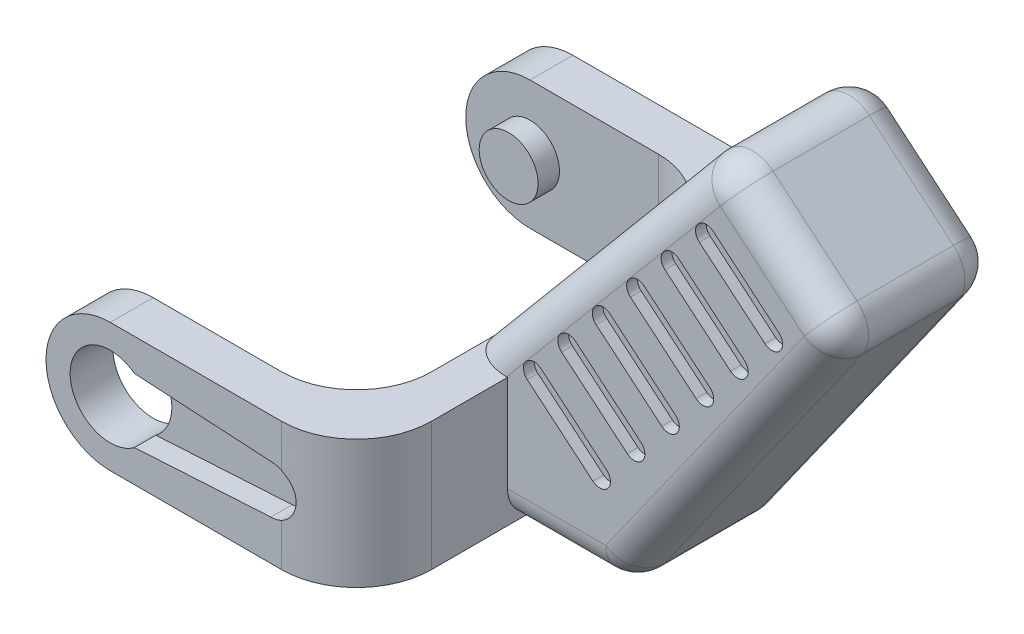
ISO-10303-21;
HEADER;
FILE_DESCRIPTION(('STEP AP214'),'2;1');
FILE_NAME('part.step','',(''),(''),'','','');
FILE_SCHEMA(('AUTOMOTIVE_DESIGN { 1 0 10303 214 1 1 1 1 }'));
ENDSEC;
DATA;
#1=APPLICATION_CONTEXT('core data for automotive mechanical design processes');
#2=APPLICATION_PROTOCOL_DEFINITION('international standard','automotive_design',2000,#1);
#3=PRODUCT_CONTEXT('',#1,'mechanical');
#4=PRODUCT('Part','Part','',(#3));
#5=PRODUCT_RELATED_PRODUCT_CATEGORY('part','',(#4));
#6=PRODUCT_DEFINITION_FORMATION('','',#4);
#7=PRODUCT_DEFINITION_CONTEXT('part definition',#1,'design');
#8=PRODUCT_DEFINITION('design','',#6,#7);
#9=PRODUCT_DEFINITION_SHAPE('','',#8);
#10=(LENGTH_UNIT() NAMED_UNIT(*) SI_UNIT(.MILLI.,.METRE.));
#11=(NAMED_UNIT(*) PLANE_ANGLE_UNIT() SI_UNIT($,.RADIAN.));
#12=(NAMED_UNIT(*) SI_UNIT($,.STERADIAN.) SOLID_ANGLE_UNIT());
#13=UNCERTAINTY_MEASURE_WITH_UNIT(LENGTH_MEASURE(1.E-05),#10,'distance_accuracy_value','');
#14=(GEOMETRIC_REPRESENTATION_CONTEXT(3) GLOBAL_UNCERTAINTY_ASSIGNED_CONTEXT((#13)) GLOBAL_UNIT_ASSIGNED_CONTEXT((#10,
#11,#12)) REPRESENTATION_CONTEXT('',''));
#15=CARTESIAN_POINT('',(0.,0.,0.));
#16=DIRECTION('',(0.,0.,1.));
#17=DIRECTION('',(1.,0.,0.));
#18=AXIS2_PLACEMENT_3D('',#15,#16,#17);
#19=CARTESIAN_POINT('',(33.605230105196,11.3340769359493,-33.0251670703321));
#20=DIRECTION('',(0.,0.,1.));
#21=DIRECTION('',(1.,0.,0.));
#22=AXIS2_PLACEMENT_3D('',#19,#20,#21);
#23=PLANE('',#22);
#24=DIRECTION('',(-0.76604444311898,0.642787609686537,0.));
#25=VECTOR('',#24,1.);
#26=CARTESIAN_POINT('',(30.6824460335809,7.85083851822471,-33.0251670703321));
#27=LINE('',#26,#25);
#28=CARTESIAN_POINT('',(39.5176391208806,0.437231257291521,-33.0251670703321));
#29=VERTEX_POINT('',#28);
#30=CARTESIAN_POINT('',(27.6381120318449,10.4053380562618,-33.0251670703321));
#31=VERTEX_POINT('',#30);
#32=EDGE_CURVE('E1794',#29,#31,#27,.T.);
#33=ORIENTED_EDGE('',*,*,#32,.F.);
#34=DIRECTION('',(-0.577508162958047,-0.816384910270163,0.));
#35=VECTOR('',#34,1.);
#36=CARTESIAN_POINT('',(39.8055528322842,0.844235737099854,-33.0251670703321));
#37=LINE('',#36,#35);
#38=CARTESIAN_POINT('',(38.3706358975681,-1.1842109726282,-33.0251670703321));
#39=VERTEX_POINT('',#38);
#40=EDGE_CURVE('E1022',#29,#39,#37,.T.);
#41=ORIENTED_EDGE('',*,*,#40,.T.);
#42=CARTESIAN_POINT('',(36.5196476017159,2.36155384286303,-33.0251670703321));
#43=DIRECTION('',(0.,0.,1.));
#44=DIRECTION('',(1.,0.,0.));
#45=AXIS2_PLACEMENT_3D('',#42,#43,#44);
#46=CIRCLE('',#45,3.99982572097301);
#47=CARTESIAN_POINT('',(33.9486091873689,-0.702490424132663,-33.0251670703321));
#48=VERTEX_POINT('',#47);
#49=EDGE_CURVE('E1859',#48,#39,#46,.T.);
#50=ORIENTED_EDGE('',*,*,#49,.F.);
#51=DIRECTION('',(0.76604444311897,-0.642787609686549,0.));
#52=VECTOR('',#51,1.);
#53=CARTESIAN_POINT('',(27.8202536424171,4.43981045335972,-33.0251670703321));
#54=LINE('',#53,#52);
#55=CARTESIAN_POINT('',(27.8202536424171,4.43981045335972,-33.0251670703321));
#56=VERTEX_POINT('',#55);
#57=EDGE_CURVE('E986',#56,#48,#54,.T.);
#58=ORIENTED_EDGE('',*,*,#57,.F.);
#59=CARTESIAN_POINT('',(30.3912920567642,7.50385472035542,-33.0251670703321));
#60=DIRECTION('',(0.,0.,1.));
#61=DIRECTION('',(1.,0.,0.));
#62=AXIS2_PLACEMENT_3D('',#59,#60,#61);
#63=CIRCLE('',#62,3.999825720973);
#64=CARTESIAN_POINT('',(26.9077789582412,5.53821429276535,-33.0251670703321));
#65=VERTEX_POINT('',#64);
#66=EDGE_CURVE('E1826',#65,#56,#63,.T.);
#67=ORIENTED_EDGE('',*,*,#66,.F.);
#68=DIRECTION('',(0.,-1.,0.));
#69=VECTOR('',#68,1.);
#70=CARTESIAN_POINT('',(26.9077789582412,0.,-33.0251670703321));
#71=LINE('',#70,#69);
#72=CARTESIAN_POINT('',(26.9077789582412,9.46949514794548,-33.0251670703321));
#73=VERTEX_POINT('',#72);
#74=EDGE_CURVE('E1019',#73,#65,#71,.T.);
#75=ORIENTED_EDGE('',*,*,#74,.F.);
#76=EDGE_CURVE('E1860',#31,#73,#63,.T.);
#77=ORIENTED_EDGE('',*,*,#76,.F.);
#78=EDGE_LOOP('',(#33,#41,#50,#58,#67,#75,#77));
#79=FACE_BOUND('',#78,.T.);
#80=ADVANCED_FACE('F35',(#79),#23,.F.);
#81=CARTESIAN_POINT('',(30.3912920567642,7.50385472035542,-43.0251670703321));
#82=DIRECTION('',(0.,0.,-1.));
#83=DIRECTION('',(0.,1.,0.));
#84=AXIS2_PLACEMENT_3D('',#81,#82,#83);
#85=CYLINDRICAL_SURFACE('',#84,3.999825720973);
#86=CARTESIAN_POINT('',(30.3912920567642,7.50385472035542,-40.0251670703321));
#87=DIRECTION('',(0.,0.,-1.));
#88=DIRECTION('',(0.,1.,0.));
#89=AXIS2_PLACEMENT_3D('',#86,#87,#88);
#90=CIRCLE('',#89,3.999825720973);
#91=CARTESIAN_POINT('',(26.9077789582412,9.46949514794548,-40.0251670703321));
#92=VERTEX_POINT('',#91);
#93=CARTESIAN_POINT('',(27.6381120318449,10.4053380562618,-40.0251670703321));
#94=VERTEX_POINT('',#93);
#95=EDGE_CURVE('E1839',#92,#94,#90,.T.);
#96=ORIENTED_EDGE('',*,*,#95,.T.);
#97=DIRECTION('',(0.,0.,-1.));
#98=VECTOR('',#97,1.);
#99=CARTESIAN_POINT('',(27.6381120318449,10.4053380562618,-43.0251670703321));
#100=LINE('',#99,#98);
#101=CARTESIAN_POINT('',(27.6381120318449,10.4053380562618,-41.0251670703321));
#102=VERTEX_POINT('',#101);
#103=EDGE_CURVE('E1807',#94,#102,#100,.T.);
#104=ORIENTED_EDGE('',*,*,#103,.T.);
#105=CARTESIAN_POINT('',(30.3912920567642,7.50385472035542,-41.0251670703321));
#106=DIRECTION('',(0.,0.,-1.));
#107=DIRECTION('',(0.,1.,0.));
#108=AXIS2_PLACEMENT_3D('',#105,#106,#107);
#109=CIRCLE('',#108,3.999825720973);
#110=CARTESIAN_POINT('',(26.9077789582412,9.46949514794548,-41.0251670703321));
#111=VERTEX_POINT('',#110);
#112=EDGE_CURVE('E1800',#111,#102,#109,.T.);
#113=ORIENTED_EDGE('',*,*,#112,.F.);
#114=DIRECTION('',(0.,0.,-1.));
#115=VECTOR('',#114,1.);
#116=CARTESIAN_POINT('',(26.9077789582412,9.46949514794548,-43.0251670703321));
#117=LINE('',#116,#115);
#118=EDGE_CURVE('E1002',#111,#92,#117,.F.);
#119=ORIENTED_EDGE('',*,*,#118,.T.);
#120=EDGE_LOOP('',(#96,#104,#113,#119));
#121=FACE_BOUND('',#120,.T.);
#122=ADVANCED_FACE('F359',(#121),#85,.T.);
#123=CARTESIAN_POINT('',(43.2470442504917,22.8247435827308,-40.0251670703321));
#124=DIRECTION('',(0.,0.,-1.));
#125=DIRECTION('',(0.,1.,0.));
#126=AXIS2_PLACEMENT_3D('',#123,#124,#125);
#127=PLANE('',#126);
#128=DIRECTION('',(0.76604444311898,-0.642787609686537,0.));
#129=VECTOR('',#128,1.);
#130=CARTESIAN_POINT('',(30.682446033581,7.85083851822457,-40.0251670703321));
#131=LINE('',#130,#129);
#132=CARTESIAN_POINT('',(39.5176391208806,0.437231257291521,-40.0251670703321));
#133=VERTEX_POINT('',#132);
#134=EDGE_CURVE('E1793',#94,#133,#131,.T.);
#135=ORIENTED_EDGE('',*,*,#134,.F.);
#136=ORIENTED_EDGE('',*,*,#95,.F.);
#137=DIRECTION('',(0.,-1.,0.));
#138=VECTOR('',#137,1.);
#139=CARTESIAN_POINT('',(26.9077789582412,7.50385472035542,-40.0251670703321));
#140=LINE('',#139,#138);
#141=CARTESIAN_POINT('',(26.9077789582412,5.53821429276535,-40.0251670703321));
#142=VERTEX_POINT('',#141);
#143=EDGE_CURVE('E1025',#92,#142,#140,.T.);
#144=ORIENTED_EDGE('',*,*,#143,.T.);
#145=CARTESIAN_POINT('',(27.8202536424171,4.43981045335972,-40.0251670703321));
#146=VERTEX_POINT('',#145);
#147=EDGE_CURVE('E1842',#146,#142,#90,.T.);
#148=ORIENTED_EDGE('',*,*,#147,.F.);
#149=DIRECTION('',(-0.76604444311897,0.642787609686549,0.));
#150=VECTOR('',#149,1.);
#151=CARTESIAN_POINT('',(27.8202536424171,4.43981045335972,-40.0251670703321));
#152=LINE('',#151,#150);
#153=CARTESIAN_POINT('',(33.9486091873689,-0.702490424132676,-40.0251670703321));
#154=VERTEX_POINT('',#153);
#155=EDGE_CURVE('E1850',#154,#146,#152,.T.);
#156=ORIENTED_EDGE('',*,*,#155,.F.);
#157=CARTESIAN_POINT('',(36.5196476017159,2.36155384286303,-40.0251670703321));
#158=DIRECTION('',(0.,0.,-1.));
#159=DIRECTION('',(0.,1.,0.));
#160=AXIS2_PLACEMENT_3D('',#157,#158,#159);
#161=CIRCLE('',#160,3.99982572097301);
#162=CARTESIAN_POINT('',(38.3706358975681,-1.18421097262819,-40.0251670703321));
#163=VERTEX_POINT('',#162);
#164=EDGE_CURVE('E1845',#163,#154,#161,.T.);
#165=ORIENTED_EDGE('',*,*,#164,.F.);
#166=DIRECTION('',(0.577508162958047,0.816384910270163,0.));
#167=VECTOR('',#166,1.);
#168=CARTESIAN_POINT('',(39.8055528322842,0.844235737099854,-40.0251670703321));
#169=LINE('',#168,#167);
#170=EDGE_CURVE('E1016',#163,#133,#169,.T.);
#171=ORIENTED_EDGE('',*,*,#170,.T.);
#172=EDGE_LOOP('',(#135,#136,#144,#148,#156,#165,#171));
#173=FACE_BOUND('',#172,.T.);
#174=ADVANCED_FACE('F365',(#173),#127,.F.);
#175=CARTESIAN_POINT('',(30.3912920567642,7.50385472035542,-30.0251670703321));
#176=DIRECTION('',(0.,0.,1.));
#177=DIRECTION('',(1.,0.,0.));
#178=AXIS2_PLACEMENT_3D('',#175,#176,#177);
#179=CYLINDRICAL_SURFACE('',#178,3.999825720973);
#180=CARTESIAN_POINT('',(30.3912920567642,7.50385472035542,-32.0251670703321));
#181=DIRECTION('',(0.,0.,1.));
#182=DIRECTION('',(0.,-1.,0.));
#183=AXIS2_PLACEMENT_3D('',#180,#181,#182);
#184=CIRCLE('',#183,3.999825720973);
#185=CARTESIAN_POINT('',(27.6381120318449,10.4053380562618,-32.0251670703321));
#186=VERTEX_POINT('',#185);
#187=CARTESIAN_POINT('',(26.9077789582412,9.46949514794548,-32.0251670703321));
#188=VERTEX_POINT('',#187);
#189=EDGE_CURVE('E977',#186,#188,#184,.T.);
#190=ORIENTED_EDGE('',*,*,#189,.F.);
#191=DIRECTION('',(0.,0.,1.));
#192=VECTOR('',#191,1.);
#193=CARTESIAN_POINT('',(27.6381120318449,10.4053380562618,-30.0251670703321));
#194=LINE('',#193,#192);
#195=EDGE_CURVE('E756',#186,#31,#194,.F.);
#196=ORIENTED_EDGE('',*,*,#195,.T.);
#197=ORIENTED_EDGE('',*,*,#76,.T.);
#198=DIRECTION('',(0.,0.,1.));
#199=VECTOR('',#198,1.);
#200=CARTESIAN_POINT('',(26.9077789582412,9.46949514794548,-30.0251670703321));
#201=LINE('',#200,#199);
#202=EDGE_CURVE('E1008',#188,#73,#201,.F.);
#203=ORIENTED_EDGE('',*,*,#202,.F.);
#204=EDGE_LOOP('',(#190,#196,#197,#203));
#205=FACE_BOUND('',#204,.T.);
#206=ADVANCED_FACE('F619',(#205),#179,.T.);
#207=CARTESIAN_POINT('',(23.9077789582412,6.00000000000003,-4.02516707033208));
#208=DIRECTION('',(0.766044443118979,-0.642787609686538,0.));
#209=DIRECTION('',(0.642787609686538,0.76604444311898,0.));
#210=AXIS2_PLACEMENT_3D('',#207,#208,#209);
#211=PLANE('',#210);
#212=DIRECTION('',(0.,0.,-1.));
#213=VECTOR('',#212,1.);
#214=CARTESIAN_POINT('',(26.9077789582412,9.57526077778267,0.));
#215=LINE('',#214,#213);
#216=CARTESIAN_POINT('',(26.9077789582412,9.57526077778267,-32.0251670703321));
#217=VERTEX_POINT('',#216);
#218=CARTESIAN_POINT('',(26.9077789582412,9.57526077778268,-41.0251670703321));
#219=VERTEX_POINT('',#218);
#220=EDGE_CURVE('E949',#217,#219,#215,.T.);
#221=ORIENTED_EDGE('',*,*,#220,.T.);
#222=DIRECTION('',(-0.642787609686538,-0.76604444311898,0.));
#223=VECTOR('',#222,1.);
#224=CARTESIAN_POINT('',(23.9077789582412,6.00000000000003,-41.0251670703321));
#225=LINE('',#224,#223);
#226=CARTESIAN_POINT('',(23.9077789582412,6.,-41.0251670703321));
#227=VERTEX_POINT('',#226);
#228=EDGE_CURVE('E259',#219,#227,#225,.T.);
#229=ORIENTED_EDGE('',*,*,#228,.T.);
#230=DIRECTION('',(0.,0.,-1.));
#231=VECTOR('',#230,1.);
#232=CARTESIAN_POINT('',(23.9077789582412,6.00000000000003,-4.02516707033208));
#233=LINE('',#232,#231);
#234=CARTESIAN_POINT('',(23.9077789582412,6.00000000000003,-32.0251670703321));
#235=VERTEX_POINT('',#234);
#236=EDGE_CURVE('E951',#235,#227,#233,.T.);
#237=ORIENTED_EDGE('',*,*,#236,.F.);
#238=DIRECTION('',(0.642787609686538,0.76604444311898,0.));
#239=VECTOR('',#238,1.);
#240=CARTESIAN_POINT('',(47.402568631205,34.,-32.0251670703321));
#241=LINE('',#240,#239);
#242=EDGE_CURVE('E261',#235,#217,#241,.T.);
#243=ORIENTED_EDGE('',*,*,#242,.T.);
#244=EDGE_LOOP('',(#221,#229,#237,#243));
#245=FACE_BOUND('',#244,.T.);
#246=ADVANCED_FACE('F616',(#245),#211,.F.);
#247=CARTESIAN_POINT('',(27.9077789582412,-6.,-14.9251670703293));
#248=DIRECTION('',(-1.,0.,0.));
#249=DIRECTION('',(0.,-1.,0.));
#250=AXIS2_PLACEMENT_3D('',#247,#248,#249);
#251=PLANE('',#250);
#252=DIRECTION('',(0.,0.,-1.));
#253=VECTOR('',#252,1.);
#254=CARTESIAN_POINT('',(27.9077789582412,-6.,-14.9251670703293));
#255=LINE('',#254,#253);
#256=CARTESIAN_POINT('',(27.9077789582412,-6.,-41.0251670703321));
#257=VERTEX_POINT('',#256);
#258=CARTESIAN_POINT('',(27.9077789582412,-6.,-51.1251670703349));
#259=VERTEX_POINT('',#258);
#260=EDGE_CURVE('E742',#257,#259,#255,.T.);
#261=ORIENTED_EDGE('',*,*,#260,.T.);
#262=DIRECTION('',(0.,1.,0.));
#263=VECTOR('',#262,1.);
#264=CARTESIAN_POINT('',(27.9077789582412,6.00000000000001,-51.1251670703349));
#265=LINE('',#264,#263);
#266=CARTESIAN_POINT('',(27.9077789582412,6.,-51.1251670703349));
#267=VERTEX_POINT('',#266);
#268=EDGE_CURVE('E279',#259,#267,#265,.T.);
#269=ORIENTED_EDGE('',*,*,#268,.T.);
#270=DIRECTION('',(0.,0.,-1.));
#271=VECTOR('',#270,1.);
#272=CARTESIAN_POINT('',(27.9077789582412,6.,-14.9251670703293));
#273=LINE('',#272,#271);
#274=CARTESIAN_POINT('',(27.9077789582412,6.,-44.0251670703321));
#275=VERTEX_POINT('',#274);
#276=EDGE_CURVE('E738',#275,#267,#273,.T.);
#277=ORIENTED_EDGE('',*,*,#276,.F.);
#278=DIRECTION('',(0.,-1.,0.));
#279=VECTOR('',#278,1.);
#280=CARTESIAN_POINT('',(27.9077789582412,-6.,-44.0251670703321));
#281=LINE('',#280,#279);
#282=CARTESIAN_POINT('',(27.9077789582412,-3.,-44.0251670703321));
#283=VERTEX_POINT('',#282);
#284=EDGE_CURVE('E1451',#275,#283,#281,.T.);
#285=ORIENTED_EDGE('',*,*,#284,.T.);
#286=CARTESIAN_POINT('',(27.9077789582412,-3.,-41.0251670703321));
#287=DIRECTION('',(-1.,0.,0.));
#288=DIRECTION('',(0.,-1.,0.));
#289=AXIS2_PLACEMENT_3D('',#286,#287,#288);
#290=CIRCLE('',#289,3.);
#291=EDGE_CURVE('E11',#283,#257,#290,.T.);
#292=ORIENTED_EDGE('',*,*,#291,.T.);
#293=EDGE_LOOP('',(#261,#269,#277,#285,#292));
#294=FACE_BOUND('',#293,.T.);
#295=ADVANCED_FACE('F339',(#294),#251,.F.);
#296=CARTESIAN_POINT('',(27.9077789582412,6.,-14.9251670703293));
#297=DIRECTION('',(0.,-1.,0.));
#298=DIRECTION('',(1.,0.,0.));
#299=AXIS2_PLACEMENT_3D('',#296,#297,#298);
#300=PLANE('',#299);
#301=ORIENTED_EDGE('',*,*,#276,.T.);
#302=CARTESIAN_POINT('',(20.9077789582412,6.00000000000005,-51.1251670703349));
#303=DIRECTION('',(0.,-1.,0.));
#304=DIRECTION('',(1.,0.,0.));
#305=AXIS2_PLACEMENT_3D('',#302,#303,#304);
#306=CIRCLE('',#305,7.);
#307=CARTESIAN_POINT('',(20.9077789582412,6.,-58.1251670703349));
#308=VERTEX_POINT('',#307);
#309=EDGE_CURVE('E86',#267,#308,#306,.F.);
#310=ORIENTED_EDGE('',*,*,#309,.T.);
#311=DIRECTION('',(1.,0.,0.));
#312=VECTOR('',#311,1.);
#313=CARTESIAN_POINT('',(23.9077789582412,6.00000000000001,-58.1251670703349));
#314=LINE('',#313,#312);
#315=CARTESIAN_POINT('',(4.90777895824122,6.00000000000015,-58.1251670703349));
#316=VERTEX_POINT('',#315);
#317=EDGE_CURVE('E817',#316,#308,#314,.T.);
#318=ORIENTED_EDGE('',*,*,#317,.F.);
#319=DIRECTION('',(0.,0.,1.));
#320=VECTOR('',#319,1.);
#321=CARTESIAN_POINT('',(4.90777895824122,6.00000000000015,-58.1251670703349));
#322=LINE('',#321,#320);
#323=CARTESIAN_POINT('',(4.90777895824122,6.00000000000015,-54.1251670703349));
#324=VERTEX_POINT('',#323);
#325=EDGE_CURVE('E920',#316,#324,#322,.T.);
#326=ORIENTED_EDGE('',*,*,#325,.T.);
#327=DIRECTION('',(1.,0.,0.));
#328=VECTOR('',#327,1.);
#329=CARTESIAN_POINT('',(27.9077789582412,6.,-54.1251670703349));
#330=LINE('',#329,#328);
#331=CARTESIAN_POINT('',(16.9077789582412,6.00000000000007,-54.1251670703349));
#332=VERTEX_POINT('',#331);
#333=EDGE_CURVE('E917',#324,#332,#330,.T.);
#334=ORIENTED_EDGE('',*,*,#333,.T.);
#335=CARTESIAN_POINT('',(16.9077789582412,6.00000000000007,-47.1251670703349));
#336=DIRECTION('',(0.,-1.,0.));
#337=DIRECTION('',(1.,0.,0.));
#338=AXIS2_PLACEMENT_3D('',#335,#336,#337);
#339=CIRCLE('',#338,7.);
#340=CARTESIAN_POINT('',(23.9077789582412,6.,-47.1251670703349));
#341=VERTEX_POINT('',#340);
#342=EDGE_CURVE('E267',#332,#341,#339,.T.);
#343=ORIENTED_EDGE('',*,*,#342,.T.);
#344=DIRECTION('',(0.,0.,1.));
#345=VECTOR('',#344,1.);
#346=CARTESIAN_POINT('',(23.9077789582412,6.00000000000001,-58.1251670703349));
#347=LINE('',#346,#345);
#348=EDGE_CURVE('E75',#341,#227,#347,.T.);
#349=ORIENTED_EDGE('',*,*,#348,.T.);
#350=CARTESIAN_POINT('',(27.824000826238,6.,-41.0251670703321));
#351=DIRECTION('',(0.,-1.,0.));
#352=DIRECTION('',(1.,0.,0.));
#353=AXIS2_PLACEMENT_3D('',#350,#351,#352);
#354=ELLIPSE('',#353,3.91622186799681,3.);
#355=CARTESIAN_POINT('',(27.824000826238,6.,-44.0251670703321));
#356=VERTEX_POINT('',#355);
#357=EDGE_CURVE('E164',#227,#356,#354,.T.);
#358=ORIENTED_EDGE('',*,*,#357,.T.);
#359=DIRECTION('',(1.,0.,0.));
#360=VECTOR('',#359,1.);
#361=CARTESIAN_POINT('',(27.9077789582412,6.,-44.0251670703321));
#362=LINE('',#361,#360);
#363=EDGE_CURVE('E753',#356,#275,#362,.T.);
#364=ORIENTED_EDGE('',*,*,#363,.T.);
#365=EDGE_LOOP('',(#301,#310,#318,#326,#334,#343,#349,#358,#364));
#366=FACE_BOUND('',#365,.T.);
#367=ADVANCED_FACE('F336',(#366),#300,.F.);
#368=CARTESIAN_POINT('',(23.9077789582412,0.,0.));
#369=DIRECTION('',(1.,0.,0.));
#370=DIRECTION('',(0.,1.,0.));
#371=AXIS2_PLACEMENT_3D('',#368,#369,#370);
#372=PLANE('',#371);
#373=DIRECTION('',(0.,0.,-1.));
#374=VECTOR('',#373,1.);
#375=CARTESIAN_POINT('',(23.9077789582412,-6.,-58.1251670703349));
#376=LINE('',#375,#374);
#377=CARTESIAN_POINT('',(23.9077789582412,-6.,-25.9251670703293));
#378=VERTEX_POINT('',#377);
#379=CARTESIAN_POINT('',(23.9077789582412,-6.,-47.1251670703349));
#380=VERTEX_POINT('',#379);
#381=EDGE_CURVE('E823',#378,#380,#376,.T.);
#382=ORIENTED_EDGE('',*,*,#381,.F.);
#383=DIRECTION('',(0.,1.,0.));
#384=VECTOR('',#383,1.);
#385=CARTESIAN_POINT('',(23.9077789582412,6.,-25.9251670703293));
#386=LINE('',#385,#384);
#387=CARTESIAN_POINT('',(23.9077789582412,6.,-25.9251670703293));
#388=VERTEX_POINT('',#387);
#389=EDGE_CURVE('E762',#378,#388,#386,.T.);
#390=ORIENTED_EDGE('',*,*,#389,.T.);
#391=EDGE_CURVE('E52',#235,#388,#347,.T.);
#392=ORIENTED_EDGE('',*,*,#391,.F.);
#393=ORIENTED_EDGE('',*,*,#236,.T.);
#394=ORIENTED_EDGE('',*,*,#348,.F.);
#395=DIRECTION('',(0.,1.,0.));
#396=VECTOR('',#395,1.);
#397=CARTESIAN_POINT('',(23.9077789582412,-6.,-47.1251670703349));
#398=LINE('',#397,#396);
#399=EDGE_CURVE('E759',#341,#380,#398,.F.);
#400=ORIENTED_EDGE('',*,*,#399,.T.);
#401=EDGE_LOOP('',(#382,#390,#392,#393,#394,#400));
#402=FACE_BOUND('',#401,.T.);
#403=ADVANCED_FACE('F330',(#402),#372,.F.);
#404=CARTESIAN_POINT('',(4.90777895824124,1.53211142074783E-13,-18.9251670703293));
#405=DIRECTION('',(0.,0.,1.));
#406=DIRECTION('',(1.,0.,0.));
#407=AXIS2_PLACEMENT_3D('',#404,#405,#406);
#408=PLANE('',#407);
#409=CARTESIAN_POINT('',(4.90777895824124,1.53211142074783E-13,-18.9251670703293));
#410=DIRECTION('',(0.,0.,1.));
#411=DIRECTION('',(1.,0.,0.));
#412=AXIS2_PLACEMENT_3D('',#409,#410,#411);
#413=CIRCLE('',#412,3.75);
#414=CARTESIAN_POINT('',(8.65777895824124,1.53211142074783E-13,-18.9251670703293));
#415=VERTEX_POINT('',#414);
#416=EDGE_CURVE('E706',#415,#415,#413,.T.);
#417=ORIENTED_EDGE('',*,*,#416,.T.);
#418=EDGE_LOOP('',(#417));
#419=FACE_BOUND('',#418,.T.);
#420=DIRECTION('',(-1.,0.,0.));
#421=VECTOR('',#420,1.);
#422=CARTESIAN_POINT('',(27.9077789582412,6.,-18.9251670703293));
#423=LINE('',#422,#421);
#424=CARTESIAN_POINT('',(16.9077789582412,6.00000000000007,-18.9251670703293));
#425=VERTEX_POINT('',#424);
#426=CARTESIAN_POINT('',(4.90777895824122,6.00000000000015,-18.9251670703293));
#427=VERTEX_POINT('',#426);
#428=EDGE_CURVE('E723',#425,#427,#423,.T.);
#429=ORIENTED_EDGE('',*,*,#428,.F.);
#430=DIRECTION('',(0.,1.,0.));
#431=VECTOR('',#430,1.);
#432=CARTESIAN_POINT('',(16.9077789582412,-6.00000000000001,-18.9251670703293));
#433=LINE('',#432,#431);
#434=CARTESIAN_POINT('',(16.9077789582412,-5.99999999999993,-18.9251670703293));
#435=VERTEX_POINT('',#434);
#436=EDGE_CURVE('E764',#425,#435,#433,.F.);
#437=ORIENTED_EDGE('',*,*,#436,.T.);
#438=DIRECTION('',(1.,0.,0.));
#439=VECTOR('',#438,1.);
#440=CARTESIAN_POINT('',(4.9077789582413,-5.99999999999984,-18.9251670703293));
#441=LINE('',#440,#439);
#442=CARTESIAN_POINT('',(4.9077789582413,-5.99999999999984,-18.9251670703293));
#443=VERTEX_POINT('',#442);
#444=EDGE_CURVE('E731',#443,#435,#441,.T.);
#445=ORIENTED_EDGE('',*,*,#444,.F.);
#446=CARTESIAN_POINT('',(4.90777895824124,1.53211142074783E-13,-18.9251670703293));
#447=DIRECTION('',(0.,0.,1.));
#448=DIRECTION('',(1.,0.,0.));
#449=AXIS2_PLACEMENT_3D('',#446,#447,#448);
#450=CIRCLE('',#449,6.);
#451=EDGE_CURVE('E716',#427,#443,#450,.T.);
#452=ORIENTED_EDGE('',*,*,#451,.F.);
#453=EDGE_LOOP('',(#429,#437,#445,#452));
#454=FACE_BOUND('',#453,.T.);
#455=ADVANCED_FACE('F326',(#419,#454),#408,.F.);
#456=CARTESIAN_POINT('',(4.90777895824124,1.53211142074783E-13,-14.9251670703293));
#457=DIRECTION('',(0.,0.,1.));
#458=DIRECTION('',(1.,0.,0.));
#459=AXIS2_PLACEMENT_3D('',#456,#457,#458);
#460=PLANE('',#459);
#461=DIRECTION('',(1.,0.,0.));
#462=VECTOR('',#461,1.);
#463=CARTESIAN_POINT('',(4.9077789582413,-5.99999999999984,-14.9251670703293));
#464=LINE('',#463,#462);
#465=CARTESIAN_POINT('',(4.9077789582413,-5.99999999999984,-14.9251670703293));
#466=VERTEX_POINT('',#465);
#467=CARTESIAN_POINT('',(20.9077789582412,-5.99999999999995,-14.9251670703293));
#468=VERTEX_POINT('',#467);
#469=EDGE_CURVE('E722',#466,#468,#464,.T.);
#470=ORIENTED_EDGE('',*,*,#469,.T.);
#471=DIRECTION('',(0.,1.,0.));
#472=VECTOR('',#471,1.);
#473=CARTESIAN_POINT('',(20.9077789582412,6.,-14.9251670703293));
#474=LINE('',#473,#472);
#475=CARTESIAN_POINT('',(20.9077789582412,-2.01556443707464,-14.9251670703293));
#476=VERTEX_POINT('',#475);
#477=EDGE_CURVE('E302',#468,#476,#474,.T.);
#478=ORIENTED_EDGE('',*,*,#477,.T.);
#479=CARTESIAN_POINT('',(19.9077789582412,0.,-14.9251670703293));
#480=DIRECTION('',(0.,0.,1.));
#481=DIRECTION('',(1.,0.,0.));
#482=AXIS2_PLACEMENT_3D('',#479,#480,#481);
#483=CIRCLE('',#482,2.25);
#484=CARTESIAN_POINT('',(19.9077789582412,-2.25,-14.9251670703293));
#485=VERTEX_POINT('',#484);
#486=EDGE_CURVE('E691',#485,#476,#483,.T.);
#487=ORIENTED_EDGE('',*,*,#486,.F.);
#488=DIRECTION('',(0.998274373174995,0.0587220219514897,0.));
#489=VECTOR('',#488,1.);
#490=CARTESIAN_POINT('',(19.9077789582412,-2.25,-14.9251670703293));
#491=LINE('',#490,#489);
#492=CARTESIAN_POINT('',(7.15777895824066,-3.00000000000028,-14.9251670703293));
#493=VERTEX_POINT('',#492);
#494=EDGE_CURVE('E672',#493,#485,#491,.T.);
#495=ORIENTED_EDGE('',*,*,#494,.F.);
#496=CARTESIAN_POINT('',(4.90777895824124,1.53211142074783E-13,-14.9251670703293));
#497=DIRECTION('',(0.,0.,1.));
#498=DIRECTION('',(1.,0.,0.));
#499=AXIS2_PLACEMENT_3D('',#496,#497,#498);
#500=CIRCLE('',#499,3.75);
#501=CARTESIAN_POINT('',(7.15777895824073,3.00000000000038,-14.9251670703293));
#502=VERTEX_POINT('',#501);
#503=EDGE_CURVE('E714',#502,#493,#500,.T.);
#504=ORIENTED_EDGE('',*,*,#503,.F.);
#505=DIRECTION('',(-0.998274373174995,0.0587220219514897,0.));
#506=VECTOR('',#505,1.);
#507=CARTESIAN_POINT('',(19.9077789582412,2.25,-14.9251670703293));
#508=LINE('',#507,#506);
#509=CARTESIAN_POINT('',(19.9077789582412,2.25,-14.9251670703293));
#510=VERTEX_POINT('',#509);
#511=EDGE_CURVE('E687',#510,#502,#508,.T.);
#512=ORIENTED_EDGE('',*,*,#511,.F.);
#513=CARTESIAN_POINT('',(20.9077789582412,2.01556443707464,-14.9251670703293));
#514=VERTEX_POINT('',#513);
#515=EDGE_CURVE('E695',#514,#510,#483,.T.);
#516=ORIENTED_EDGE('',*,*,#515,.F.);
#517=DIRECTION('',(0.,1.,0.));
#518=VECTOR('',#517,1.);
#519=CARTESIAN_POINT('',(20.9077789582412,6.,-14.9251670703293));
#520=LINE('',#519,#518);
#521=CARTESIAN_POINT('',(20.9077789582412,6.00000000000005,-14.9251670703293));
#522=VERTEX_POINT('',#521);
#523=EDGE_CURVE('E769',#514,#522,#520,.T.);
#524=ORIENTED_EDGE('',*,*,#523,.T.);
#525=DIRECTION('',(-1.,0.,0.));
#526=VECTOR('',#525,1.);
#527=CARTESIAN_POINT('',(27.9077789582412,6.,-14.9251670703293));
#528=LINE('',#527,#526);
#529=CARTESIAN_POINT('',(4.90777895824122,6.00000000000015,-14.9251670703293));
#530=VERTEX_POINT('',#529);
#531=EDGE_CURVE('E725',#522,#530,#528,.T.);
#532=ORIENTED_EDGE('',*,*,#531,.T.);
#533=CARTESIAN_POINT('',(4.90777895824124,1.53211142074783E-13,-14.9251670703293));
#534=DIRECTION('',(0.,0.,1.));
#535=DIRECTION('',(1.,0.,0.));
#536=AXIS2_PLACEMENT_3D('',#533,#534,#535);
#537=CIRCLE('',#536,6.);
#538=EDGE_CURVE('E719',#530,#466,#537,.T.);
#539=ORIENTED_EDGE('',*,*,#538,.T.);
#540=EDGE_LOOP('',(#470,#478,#487,#495,#504,#512,#516,#524,#532,#539));
#541=FACE_BOUND('',#540,.T.);
#542=ADVANCED_FACE('F322',(#541),#460,.T.);
#543=CARTESIAN_POINT('',(4.90777895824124,1.53211142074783E-13,-14.9251670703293));
#544=DIRECTION('',(0.,0.,-1.));
#545=DIRECTION('',(-1.,0.,0.));
#546=AXIS2_PLACEMENT_3D('',#543,#544,#545);
#547=CYLINDRICAL_SURFACE('',#546,6.);
#548=ORIENTED_EDGE('',*,*,#451,.T.);
#549=DIRECTION('',(0.,0.,-1.));
#550=VECTOR('',#549,1.);
#551=CARTESIAN_POINT('',(4.9077789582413,-5.99999999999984,-14.9251670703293));
#552=LINE('',#551,#550);
#553=EDGE_CURVE('E744',#466,#443,#552,.T.);
#554=ORIENTED_EDGE('',*,*,#553,.F.);
#555=ORIENTED_EDGE('',*,*,#538,.F.);
#556=DIRECTION('',(0.,0.,-1.));
#557=VECTOR('',#556,1.);
#558=CARTESIAN_POINT('',(4.90777895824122,6.00000000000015,-14.9251670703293));
#559=LINE('',#558,#557);
#560=EDGE_CURVE('E728',#530,#427,#559,.T.);
#561=ORIENTED_EDGE('',*,*,#560,.T.);
#562=EDGE_LOOP('',(#548,#554,#555,#561));
#563=FACE_BOUND('',#562,.T.);
#564=ADVANCED_FACE('F325',(#563),#547,.T.);
#565=CARTESIAN_POINT('',(4.9077789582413,-5.99999999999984,-14.9251670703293));
#566=DIRECTION('',(0.,1.,0.));
#567=DIRECTION('',(-1.,0.,0.));
#568=AXIS2_PLACEMENT_3D('',#565,#566,#567);
#569=PLANE('',#568);
#570=DIRECTION('',(-1.,0.,0.));
#571=VECTOR('',#570,1.);
#572=CARTESIAN_POINT('',(27.9077789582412,-6.,-32.0251670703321));
#573=LINE('',#572,#571);
#574=CARTESIAN_POINT('',(37.0861523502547,-6.00000000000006,-32.0251670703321));
#575=VERTEX_POINT('',#574);
#576=CARTESIAN_POINT('',(27.9077789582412,-6.,-32.0251670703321));
#577=VERTEX_POINT('',#576);
#578=EDGE_CURVE('E148',#575,#577,#573,.T.);
#579=ORIENTED_EDGE('',*,*,#578,.T.);
#580=CARTESIAN_POINT('',(27.9077789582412,-6.,-21.9251670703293));
#581=VERTEX_POINT('',#580);
#582=EDGE_CURVE('E61',#581,#577,#255,.T.);
#583=ORIENTED_EDGE('',*,*,#582,.F.);
#584=CARTESIAN_POINT('',(20.9077789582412,-5.99999999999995,-21.9251670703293));
#585=DIRECTION('',(0.,1.,0.));
#586=DIRECTION('',(-1.,0.,0.));
#587=AXIS2_PLACEMENT_3D('',#584,#585,#586);
#588=CIRCLE('',#587,7.);
#589=EDGE_CURVE('E282',#581,#468,#588,.F.);
#590=ORIENTED_EDGE('',*,*,#589,.T.);
#591=ORIENTED_EDGE('',*,*,#469,.F.);
#592=ORIENTED_EDGE('',*,*,#553,.T.);
#593=ORIENTED_EDGE('',*,*,#444,.T.);
#594=CARTESIAN_POINT('',(16.9077789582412,-5.99999999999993,-25.9251670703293));
#595=DIRECTION('',(0.,1.,0.));
#596=DIRECTION('',(-1.,0.,0.));
#597=AXIS2_PLACEMENT_3D('',#594,#595,#596);
#598=CIRCLE('',#597,7.);
#599=EDGE_CURVE('E269',#435,#378,#598,.T.);
#600=ORIENTED_EDGE('',*,*,#599,.T.);
#601=ORIENTED_EDGE('',*,*,#381,.T.);
#602=CARTESIAN_POINT('',(16.9077789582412,-5.99999999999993,-47.1251670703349));
#603=DIRECTION('',(0.,1.,0.));
#604=DIRECTION('',(-1.,0.,0.));
#605=AXIS2_PLACEMENT_3D('',#602,#603,#604);
#606=CIRCLE('',#605,7.);
#607=CARTESIAN_POINT('',(16.9077789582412,-5.99999999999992,-54.1251670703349));
#608=VERTEX_POINT('',#607);
#609=EDGE_CURVE('E264',#380,#608,#606,.T.);
#610=ORIENTED_EDGE('',*,*,#609,.T.);
#611=DIRECTION('',(-1.,0.,0.));
#612=VECTOR('',#611,1.);
#613=CARTESIAN_POINT('',(4.90777895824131,-5.99999999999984,-54.1251670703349));
#614=LINE('',#613,#612);
#615=CARTESIAN_POINT('',(4.90777895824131,-5.99999999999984,-54.1251670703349));
#616=VERTEX_POINT('',#615);
#617=EDGE_CURVE('E919',#608,#616,#614,.T.);
#618=ORIENTED_EDGE('',*,*,#617,.T.);
#619=DIRECTION('',(0.,0.,1.));
#620=VECTOR('',#619,1.);
#621=CARTESIAN_POINT('',(4.90777895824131,-5.99999999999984,-58.1251670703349));
#622=LINE('',#621,#620);
#623=CARTESIAN_POINT('',(4.90777895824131,-5.99999999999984,-58.1251670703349));
#624=VERTEX_POINT('',#623);
#625=EDGE_CURVE('E929',#624,#616,#622,.T.);
#626=ORIENTED_EDGE('',*,*,#625,.F.);
#627=DIRECTION('',(1.,0.,0.));
#628=VECTOR('',#627,1.);
#629=CARTESIAN_POINT('',(23.9077789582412,-6.,-58.1251670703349));
#630=LINE('',#629,#628);
#631=CARTESIAN_POINT('',(20.9077789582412,-6.,-58.1251670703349));
#632=VERTEX_POINT('',#631);
#633=EDGE_CURVE('E700',#624,#632,#630,.T.);
#634=ORIENTED_EDGE('',*,*,#633,.T.);
#635=CARTESIAN_POINT('',(20.9077789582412,-5.99999999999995,-51.1251670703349));
#636=DIRECTION('',(0.,1.,0.));
#637=DIRECTION('',(-1.,0.,0.));
#638=AXIS2_PLACEMENT_3D('',#635,#636,#637);
#639=CIRCLE('',#638,7.);
#640=EDGE_CURVE('E285',#632,#259,#639,.F.);
#641=ORIENTED_EDGE('',*,*,#640,.T.);
#642=ORIENTED_EDGE('',*,*,#260,.F.);
#643=DIRECTION('',(1.,0.,0.));
#644=VECTOR('',#643,1.);
#645=CARTESIAN_POINT('',(38.6386988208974,-6.00000000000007,-41.0251670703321));
#646=LINE('',#645,#644);
#647=CARTESIAN_POINT('',(37.0861523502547,-6.00000000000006,-41.0251670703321));
#648=VERTEX_POINT('',#647);
#649=EDGE_CURVE('E151',#257,#648,#646,.T.);
#650=ORIENTED_EDGE('',*,*,#649,.T.);
#651=DIRECTION('',(0.,0.,-1.));
#652=VECTOR('',#651,1.);
#653=CARTESIAN_POINT('',(37.0861523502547,-6.00000000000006,-14.9251670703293));
#654=LINE('',#653,#652);
#655=EDGE_CURVE('E145',#648,#575,#654,.F.);
#656=ORIENTED_EDGE('',*,*,#655,.T.);
#657=EDGE_LOOP('',(#579,#583,#590,#591,#592,#593,#600,#601,#610,#618,#626,#634,#641,#642,#650,#656));
#658=FACE_BOUND('',#657,.T.);
#659=ADVANCED_FACE('F147',(#658),#569,.F.);
#660=CARTESIAN_POINT('',(27.9077789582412,6.,-21.9251670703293));
#661=VERTEX_POINT('',#660);
#662=CARTESIAN_POINT('',(27.9077789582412,6.,-29.0251670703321));
#663=VERTEX_POINT('',#662);
#664=EDGE_CURVE('E739',#661,#663,#273,.T.);
#665=ORIENTED_EDGE('',*,*,#664,.F.);
#666=DIRECTION('',(0.,1.,0.));
#667=VECTOR('',#666,1.);
#668=CARTESIAN_POINT('',(27.9077789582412,-6.,-21.9251670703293));
#669=LINE('',#668,#667);
#670=EDGE_CURVE('E288',#661,#581,#669,.F.);
#671=ORIENTED_EDGE('',*,*,#670,.T.);
#672=ORIENTED_EDGE('',*,*,#582,.T.);
#673=CARTESIAN_POINT('',(27.9077789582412,-3.,-32.0251670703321));
#674=DIRECTION('',(-1.,0.,0.));
#675=DIRECTION('',(0.,-1.,0.));
#676=AXIS2_PLACEMENT_3D('',#673,#674,#675);
#677=CIRCLE('',#676,3.);
#678=CARTESIAN_POINT('',(27.9077789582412,-3.,-29.0251670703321));
#679=VERTEX_POINT('',#678);
#680=EDGE_CURVE('E44',#577,#679,#677,.T.);
#681=ORIENTED_EDGE('',*,*,#680,.T.);
#682=DIRECTION('',(0.,1.,0.));
#683=VECTOR('',#682,1.);
#684=CARTESIAN_POINT('',(27.9077789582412,-6.,-29.0251670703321));
#685=LINE('',#684,#683);
#686=EDGE_CURVE('E1449',#679,#663,#685,.T.);
#687=ORIENTED_EDGE('',*,*,#686,.T.);
#688=EDGE_LOOP('',(#665,#671,#672,#681,#687));
#689=FACE_BOUND('',#688,.T.);
#690=ADVANCED_FACE('F334',(#689),#251,.F.);
#691=ORIENTED_EDGE('',*,*,#531,.F.);
#692=CARTESIAN_POINT('',(20.9077789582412,6.00000000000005,-21.9251670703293));
#693=DIRECTION('',(0.,-1.,0.));
#694=DIRECTION('',(1.,0.,0.));
#695=AXIS2_PLACEMENT_3D('',#692,#693,#694);
#696=CIRCLE('',#695,7.);
#697=EDGE_CURVE('E290',#522,#661,#696,.F.);
#698=ORIENTED_EDGE('',*,*,#697,.T.);
#699=ORIENTED_EDGE('',*,*,#664,.T.);
#700=DIRECTION('',(-1.,0.,0.));
#701=VECTOR('',#700,1.);
#702=CARTESIAN_POINT('',(27.9077789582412,6.,-29.0251670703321));
#703=LINE('',#702,#701);
#704=CARTESIAN_POINT('',(27.824000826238,6.,-29.0251670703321));
#705=VERTEX_POINT('',#704);
#706=EDGE_CURVE('E750',#663,#705,#703,.T.);
#707=ORIENTED_EDGE('',*,*,#706,.T.);
#708=CARTESIAN_POINT('',(27.824000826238,6.,-32.0251670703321));
#709=DIRECTION('',(0.,-1.,0.));
#710=DIRECTION('',(-1.,0.,0.));
#711=AXIS2_PLACEMENT_3D('',#708,#709,#710);
#712=ELLIPSE('',#711,3.91622186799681,3.);
#713=EDGE_CURVE('E222',#705,#235,#712,.T.);
#714=ORIENTED_EDGE('',*,*,#713,.T.);
#715=ORIENTED_EDGE('',*,*,#391,.T.);
#716=CARTESIAN_POINT('',(16.9077789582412,6.00000000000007,-25.9251670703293));
#717=DIRECTION('',(0.,-1.,0.));
#718=DIRECTION('',(1.,0.,0.));
#719=AXIS2_PLACEMENT_3D('',#716,#717,#718);
#720=CIRCLE('',#719,7.);
#721=EDGE_CURVE('E272',#388,#425,#720,.T.);
#722=ORIENTED_EDGE('',*,*,#721,.T.);
#723=ORIENTED_EDGE('',*,*,#428,.T.);
#724=ORIENTED_EDGE('',*,*,#560,.F.);
#725=EDGE_LOOP('',(#691,#698,#699,#707,#714,#715,#722,#723,#724));
#726=FACE_BOUND('',#725,.T.);
#727=ADVANCED_FACE('F320',(#726),#300,.F.);
#728=CARTESIAN_POINT('',(4.90777895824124,1.53211142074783E-13,-14.9251670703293));
#729=DIRECTION('',(0.,0.,-1.));
#730=DIRECTION('',(-1.,0.,0.));
#731=AXIS2_PLACEMENT_3D('',#728,#729,#730);
#732=CYLINDRICAL_SURFACE('',#731,3.75);
#733=DIRECTION('',(0.,0.,1.));
#734=VECTOR('',#733,1.);
#735=CARTESIAN_POINT('',(7.15777895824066,-3.00000000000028,-16.9251670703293));
#736=LINE('',#735,#734);
#737=CARTESIAN_POINT('',(7.15777895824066,-3.00000000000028,-16.9251670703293));
#738=VERTEX_POINT('',#737);
#739=EDGE_CURVE('E681',#738,#493,#736,.T.);
#740=ORIENTED_EDGE('',*,*,#739,.F.);
#741=CARTESIAN_POINT('',(4.90777895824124,1.53211142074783E-13,-16.9251670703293));
#742=DIRECTION('',(0.,0.,1.));
#743=DIRECTION('',(1.,0.,0.));
#744=AXIS2_PLACEMENT_3D('',#741,#742,#743);
#745=CIRCLE('',#744,3.75);
#746=CARTESIAN_POINT('',(7.1577789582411,3.00000000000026,-16.9251670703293));
#747=VERTEX_POINT('',#746);
#748=EDGE_CURVE('E747',#738,#747,#745,.T.);
#749=ORIENTED_EDGE('',*,*,#748,.T.);
#750=DIRECTION('',(0.,0.,1.));
#751=VECTOR('',#750,1.);
#752=CARTESIAN_POINT('',(7.15777895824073,3.00000000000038,-16.9251670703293));
#753=LINE('',#752,#751);
#754=EDGE_CURVE('E708',#747,#502,#753,.T.);
#755=ORIENTED_EDGE('',*,*,#754,.T.);
#756=ORIENTED_EDGE('',*,*,#503,.T.);
#757=EDGE_LOOP('',(#740,#749,#755,#756));
#758=FACE_BOUND('',#757,.T.);
#759=ORIENTED_EDGE('',*,*,#416,.F.);
#760=EDGE_LOOP('',(#759));
#761=FACE_BOUND('',#760,.T.);
#762=ADVANCED_FACE('F314',(#758,#761),#732,.F.);
#763=CARTESIAN_POINT('',(19.9077789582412,0.,-16.9251670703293));
#764=DIRECTION('',(0.,0.,1.));
#765=DIRECTION('',(1.,0.,0.));
#766=AXIS2_PLACEMENT_3D('',#763,#764,#765);
#767=CYLINDRICAL_SURFACE('',#766,2.25);
#768=ORIENTED_EDGE('',*,*,#486,.T.);
#769=CARTESIAN_POINT('',(20.9077789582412,-2.01556443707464,-14.9251670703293));
#770=CARTESIAN_POINT('',(20.9640894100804,-1.9876272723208,-14.9251643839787));
#771=CARTESIAN_POINT('',(21.0191973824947,-1.95734307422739,-14.9258469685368));
#772=CARTESIAN_POINT('',(21.1266584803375,-1.89229476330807,-14.9283840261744));
#773=CARTESIAN_POINT('',(21.1790122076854,-1.85753163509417,-14.9302382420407));
#774=CARTESIAN_POINT('',(21.3312291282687,-1.74698810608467,-14.9372506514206));
#775=CARTESIAN_POINT('',(21.4264999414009,-1.6648281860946,-14.9438603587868));
#776=CARTESIAN_POINT('',(21.6019054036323,-1.48598304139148,-14.9591083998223));
#777=CARTESIAN_POINT('',(21.6820431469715,-1.38930079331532,-14.9677463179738));
#778=CARTESIAN_POINT('',(21.8251685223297,-1.18396416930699,-14.985166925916));
#779=CARTESIAN_POINT('',(21.888154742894,-1.07530880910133,-14.9939496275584));
#780=CARTESIAN_POINT('',(21.995911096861,-0.847513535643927,-15.0100392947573));
#781=CARTESIAN_POINT('',(22.040441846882,-0.728258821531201,-15.0173262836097));
#782=CARTESIAN_POINT('',(22.1088082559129,-0.483810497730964,-15.0288823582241));
#783=CARTESIAN_POINT('',(22.1326447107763,-0.358617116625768,-15.0331515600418));
#784=CARTESIAN_POINT('',(22.1587310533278,-0.107276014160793,-15.0378384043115));
#785=CARTESIAN_POINT('',(22.1612077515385,0.018847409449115,-15.0382965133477));
#786=CARTESIAN_POINT('',(22.1450904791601,0.269685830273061,-15.0353830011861));
#787=CARTESIAN_POINT('',(22.1264979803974,0.39440092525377,-15.0320116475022));
#788=CARTESIAN_POINT('',(22.0690716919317,0.637828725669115,-15.0221076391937));
#789=CARTESIAN_POINT('',(22.0304087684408,0.756582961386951,-15.0156017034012));
#790=CARTESIAN_POINT('',(21.9340538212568,0.985998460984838,-15.00063656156));
#791=CARTESIAN_POINT('',(21.8763569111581,1.09665763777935,-14.9921768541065));
#792=CARTESIAN_POINT('',(21.7425793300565,1.3084029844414,-14.9747921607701));
#793=CARTESIAN_POINT('',(21.6662503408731,1.4093317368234,-14.9658622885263));
#794=CARTESIAN_POINT('',(21.4977243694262,1.59701239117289,-14.949559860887));
#795=CARTESIAN_POINT('',(21.405540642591,1.68377601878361,-14.9421860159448));
#796=CARTESIAN_POINT('',(21.2449331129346,1.81128711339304,-14.9330171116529));
#797=CARTESIAN_POINT('',(21.1805281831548,1.85710396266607,-14.9301669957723));
#798=CARTESIAN_POINT('',(21.0473042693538,1.94170263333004,-14.9262388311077));
#799=CARTESIAN_POINT('',(20.9784902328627,1.98049215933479,-14.925158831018));
#800=CARTESIAN_POINT('',(20.9077789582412,2.01556443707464,-14.9251670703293));
#801=B_SPLINE_CURVE_WITH_KNOTS('',3,(#769,#770,#771,#772,#773,#774,#775,#776,#777,#778,#779,
#780,#781,#782,#783,#784,#785,#786,#787,#788,#789,#790,#791,#792,#793,#794,#795,#796,#797,#798,
#799,#800),.UNSPECIFIED.,.F.,.F.,(4,2,2,2,2,2,2,2,2,2,2,2,2,2,2,4),(0.,0.188455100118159,
0.376868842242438,0.752863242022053,1.1287806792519,1.50472904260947,1.88541171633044,
2.2660797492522,2.64270058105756,3.01929510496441,3.39273489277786,3.76627062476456,
4.14508609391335,4.52358637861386,4.76043720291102,4.99702675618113),.UNSPECIFIED.);
#802=EDGE_CURVE('E293',#476,#514,#801,.T.);
#803=ORIENTED_EDGE('',*,*,#802,.T.);
#804=ORIENTED_EDGE('',*,*,#515,.T.);
#805=DIRECTION('',(0.,0.,1.));
#806=VECTOR('',#805,1.);
#807=CARTESIAN_POINT('',(19.9077789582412,2.25,-16.9251670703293));
#808=LINE('',#807,#806);
#809=CARTESIAN_POINT('',(19.9077789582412,2.25,-16.9251670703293));
#810=VERTEX_POINT('',#809);
#811=EDGE_CURVE('E711',#810,#510,#808,.T.);
#812=ORIENTED_EDGE('',*,*,#811,.F.);
#813=CARTESIAN_POINT('',(19.9077789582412,0.,-16.9251670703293));
#814=DIRECTION('',(0.,0.,1.));
#815=DIRECTION('',(1.,0.,0.));
#816=AXIS2_PLACEMENT_3D('',#813,#814,#815);
#817=CIRCLE('',#816,2.25);
#818=CARTESIAN_POINT('',(19.9077789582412,-2.25,-16.9251670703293));
#819=VERTEX_POINT('',#818);
#820=EDGE_CURVE('E686',#819,#810,#817,.T.);
#821=ORIENTED_EDGE('',*,*,#820,.F.);
#822=DIRECTION('',(0.,0.,1.));
#823=VECTOR('',#822,1.);
#824=CARTESIAN_POINT('',(19.9077789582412,-2.25,-16.9251670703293));
#825=LINE('',#824,#823);
#826=EDGE_CURVE('E677',#819,#485,#825,.T.);
#827=ORIENTED_EDGE('',*,*,#826,.T.);
#828=EDGE_LOOP('',(#768,#803,#804,#812,#821,#827));
#829=FACE_BOUND('',#828,.T.);
#830=ADVANCED_FACE('F308',(#829),#767,.F.);
#831=CARTESIAN_POINT('',(19.9077789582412,-2.25,-16.9251670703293));
#832=DIRECTION('',(0.0587220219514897,-0.998274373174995,0.));
#833=DIRECTION('',(0.998274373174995,0.0587220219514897,0.));
#834=AXIS2_PLACEMENT_3D('',#831,#832,#833);
#835=PLANE('',#834);
#836=ORIENTED_EDGE('',*,*,#494,.T.);
#837=ORIENTED_EDGE('',*,*,#826,.F.);
#838=DIRECTION('',(0.998274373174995,0.0587220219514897,0.));
#839=VECTOR('',#838,1.);
#840=CARTESIAN_POINT('',(19.9077789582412,-2.25,-16.9251670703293));
#841=LINE('',#840,#839);
#842=EDGE_CURVE('E702',#738,#819,#841,.T.);
#843=ORIENTED_EDGE('',*,*,#842,.F.);
#844=ORIENTED_EDGE('',*,*,#739,.T.);
#845=EDGE_LOOP('',(#836,#837,#843,#844));
#846=FACE_BOUND('',#845,.T.);
#847=ADVANCED_FACE('F313',(#846),#835,.F.);
#848=CARTESIAN_POINT('',(19.9077789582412,2.25,-16.9251670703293));
#849=DIRECTION('',(0.0587220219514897,0.998274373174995,0.));
#850=DIRECTION('',(-0.998274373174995,0.0587220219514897,0.));
#851=AXIS2_PLACEMENT_3D('',#848,#849,#850);
#852=PLANE('',#851);
#853=ORIENTED_EDGE('',*,*,#511,.T.);
#854=ORIENTED_EDGE('',*,*,#754,.F.);
#855=DIRECTION('',(-0.998274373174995,0.0587220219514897,0.));
#856=VECTOR('',#855,1.);
#857=CARTESIAN_POINT('',(19.9077789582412,2.25,-16.9251670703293));
#858=LINE('',#857,#856);
#859=EDGE_CURVE('E830',#810,#747,#858,.T.);
#860=ORIENTED_EDGE('',*,*,#859,.F.);
#861=ORIENTED_EDGE('',*,*,#811,.T.);
#862=EDGE_LOOP('',(#853,#854,#860,#861));
#863=FACE_BOUND('',#862,.T.);
#864=ADVANCED_FACE('F316',(#863),#852,.F.);
#865=CARTESIAN_POINT('',(19.9077789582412,0.,-16.9251670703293));
#866=DIRECTION('',(0.,0.,1.));
#867=DIRECTION('',(1.,0.,0.));
#868=AXIS2_PLACEMENT_3D('',#865,#866,#867);
#869=PLANE('',#868);
#870=ORIENTED_EDGE('',*,*,#842,.T.);
#871=ORIENTED_EDGE('',*,*,#820,.T.);
#872=ORIENTED_EDGE('',*,*,#859,.T.);
#873=ORIENTED_EDGE('',*,*,#748,.F.);
#874=EDGE_LOOP('',(#870,#871,#872,#873));
#875=FACE_BOUND('',#874,.T.);
#876=ADVANCED_FACE('F657',(#875),#869,.T.);
#877=CARTESIAN_POINT('',(23.9077789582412,-6.,-58.1251670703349));
#878=DIRECTION('',(0.,0.,-1.));
#879=DIRECTION('',(-1.,0.,0.));
#880=AXIS2_PLACEMENT_3D('',#877,#878,#879);
#881=PLANE('',#880);
#882=ORIENTED_EDGE('',*,*,#317,.T.);
#883=DIRECTION('',(0.,1.,0.));
#884=VECTOR('',#883,1.);
#885=CARTESIAN_POINT('',(20.9077789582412,-6.,-58.1251670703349));
#886=LINE('',#885,#884);
#887=EDGE_CURVE('E275',#308,#632,#886,.F.);
#888=ORIENTED_EDGE('',*,*,#887,.T.);
#889=ORIENTED_EDGE('',*,*,#633,.F.);
#890=CARTESIAN_POINT('',(4.90777895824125,1.54571165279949E-13,-58.1251670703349));
#891=DIRECTION('',(0.,0.,-1.));
#892=DIRECTION('',(-1.,0.,0.));
#893=AXIS2_PLACEMENT_3D('',#890,#891,#892);
#894=CIRCLE('',#893,6.);
#895=EDGE_CURVE('E820',#624,#316,#894,.T.);
#896=ORIENTED_EDGE('',*,*,#895,.T.);
#897=EDGE_LOOP('',(#882,#888,#889,#896));
#898=FACE_BOUND('',#897,.T.);
#899=ADVANCED_FACE('F648',(#898),#881,.T.);
#900=CARTESIAN_POINT('',(4.90777895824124,1.54432387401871E-13,-54.1251670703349));
#901=DIRECTION('',(0.,0.,-1.));
#902=DIRECTION('',(-1.,0.,0.));
#903=AXIS2_PLACEMENT_3D('',#900,#901,#902);
#904=PLANE('',#903);
#905=CARTESIAN_POINT('',(4.90777895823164,-1.15457426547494E-11,-54.1251670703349));
#906=DIRECTION('',(0.,0.,-1.));
#907=DIRECTION('',(-1.,0.,0.));
#908=AXIS2_PLACEMENT_3D('',#905,#906,#907);
#909=CIRCLE('',#908,2.75000000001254);
#910=CARTESIAN_POINT('',(2.1577789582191,-1.15457426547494E-11,-54.1251670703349));
#911=VERTEX_POINT('',#910);
#912=EDGE_CURVE('E932',#911,#911,#909,.F.);
#913=ORIENTED_EDGE('',*,*,#912,.F.);
#914=EDGE_LOOP('',(#913));
#915=FACE_BOUND('',#914,.T.);
#916=ORIENTED_EDGE('',*,*,#617,.F.);
#917=DIRECTION('',(0.,1.,0.));
#918=VECTOR('',#917,1.);
#919=CARTESIAN_POINT('',(16.9077789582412,6.00000000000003,-54.1251670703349));
#920=LINE('',#919,#918);
#921=EDGE_CURVE('E767',#608,#332,#920,.T.);
#922=ORIENTED_EDGE('',*,*,#921,.T.);
#923=ORIENTED_EDGE('',*,*,#333,.F.);
#924=CARTESIAN_POINT('',(4.90777895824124,1.54432387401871E-13,-54.1251670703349));
#925=DIRECTION('',(0.,0.,-1.));
#926=DIRECTION('',(-1.,0.,0.));
#927=AXIS2_PLACEMENT_3D('',#924,#925,#926);
#928=CIRCLE('',#927,6.);
#929=EDGE_CURVE('E921',#616,#324,#928,.T.);
#930=ORIENTED_EDGE('',*,*,#929,.F.);
#931=EDGE_LOOP('',(#916,#922,#923,#930));
#932=FACE_BOUND('',#931,.T.);
#933=ADVANCED_FACE('F645',(#915,#932),#904,.F.);
#934=CARTESIAN_POINT('',(4.90777895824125,1.54571165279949E-13,-58.1251670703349));
#935=DIRECTION('',(0.,0.,1.));
#936=DIRECTION('',(1.,0.,0.));
#937=AXIS2_PLACEMENT_3D('',#934,#935,#936);
#938=CYLINDRICAL_SURFACE('',#937,6.);
#939=ORIENTED_EDGE('',*,*,#929,.T.);
#940=ORIENTED_EDGE('',*,*,#325,.F.);
#941=ORIENTED_EDGE('',*,*,#895,.F.);
#942=ORIENTED_EDGE('',*,*,#625,.T.);
#943=EDGE_LOOP('',(#939,#940,#941,#942));
#944=FACE_BOUND('',#943,.T.);
#945=ADVANCED_FACE('F643',(#944),#938,.T.);
#946=CARTESIAN_POINT('',(4.90777895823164,-1.15457426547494E-11,-52.1251670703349));
#947=DIRECTION('',(0.,0.,-1.));
#948=DIRECTION('',(-1.,0.,0.));
#949=AXIS2_PLACEMENT_3D('',#946,#947,#948);
#950=CYLINDRICAL_SURFACE('',#949,2.75000000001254);
#951=CARTESIAN_POINT('',(4.90777895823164,-1.15457426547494E-11,-52.1251670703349));
#952=DIRECTION('',(0.,0.,1.));
#953=DIRECTION('',(1.,0.,0.));
#954=AXIS2_PLACEMENT_3D('',#951,#952,#953);
#955=CIRCLE('',#954,2.75000000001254);
#956=CARTESIAN_POINT('',(7.65777895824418,-1.15457426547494E-11,-52.1251670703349));
#957=VERTEX_POINT('',#956);
#958=EDGE_CURVE('E1453',#957,#957,#955,.T.);
#959=ORIENTED_EDGE('',*,*,#958,.F.);
#960=EDGE_LOOP('',(#959));
#961=FACE_BOUND('',#960,.T.);
#962=ORIENTED_EDGE('',*,*,#912,.T.);
#963=EDGE_LOOP('',(#962));
#964=FACE_BOUND('',#963,.T.);
#965=ADVANCED_FACE('F639',(#961,#964),#950,.T.);
#966=CARTESIAN_POINT('',(4.90777895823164,-1.15457426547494E-11,-52.1251670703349));
#967=DIRECTION('',(0.,0.,1.));
#968=DIRECTION('',(1.,0.,0.));
#969=AXIS2_PLACEMENT_3D('',#966,#967,#968);
#970=PLANE('',#969);
#971=ORIENTED_EDGE('',*,*,#958,.T.);
#972=EDGE_LOOP('',(#971));
#973=FACE_BOUND('',#972,.T.);
#974=ADVANCED_FACE('F632',(#973),#970,.T.);
#975=CARTESIAN_POINT('',(23.9077789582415,34.,-44.0251670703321));
#976=DIRECTION('',(0.,0.,-1.));
#977=DIRECTION('',(0.,1.,0.));
#978=AXIS2_PLACEMENT_3D('',#975,#976,#977);
#979=PLANE('',#978);
#980=ORIENTED_EDGE('',*,*,#363,.F.);
#981=DIRECTION('',(-0.642787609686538,-0.76604444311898,0.));
#982=VECTOR('',#981,1.);
#983=CARTESIAN_POINT('',(49.7007019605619,32.0716371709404,-44.0251670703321));
#984=LINE('',#983,#982);
#985=CARTESIAN_POINT('',(47.7723391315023,29.7735038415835,-44.0251670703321));
#986=VERTEX_POINT('',#985);
#987=EDGE_CURVE('E234',#356,#986,#984,.F.);
#988=ORIENTED_EDGE('',*,*,#987,.T.);
#989=DIRECTION('',(-0.76604444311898,0.642787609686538,0.));
#990=VECTOR('',#989,1.);
#991=CARTESIAN_POINT('',(57.730916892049,21.4172649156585,-44.0251670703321));
#992=LINE('',#991,#990);
#993=CARTESIAN_POINT('',(55.6148799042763,23.1928307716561,-44.0251670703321));
#994=VERTEX_POINT('',#993);
#995=EDGE_CURVE('E236',#986,#994,#992,.F.);
#996=ORIENTED_EDGE('',*,*,#995,.T.);
#997=DIRECTION('',(0.577508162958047,0.816384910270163,0.));
#998=VECTOR('',#997,1.);
#999=CARTESIAN_POINT('',(36.189544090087,-4.26747551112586,-44.0251670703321));
#1000=LINE('',#999,#998);
#1001=CARTESIAN_POINT('',(37.0861523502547,-3.00000000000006,-44.0251670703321));
#1002=VERTEX_POINT('',#1001);
#1003=EDGE_CURVE('E240',#994,#1002,#1000,.F.);
#1004=ORIENTED_EDGE('',*,*,#1003,.T.);
#1005=DIRECTION('',(1.,0.,0.));
#1006=VECTOR('',#1005,1.);
#1007=CARTESIAN_POINT('',(27.9077789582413,-3.,-44.0251670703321));
#1008=LINE('',#1007,#1006);
#1009=EDGE_CURVE('E238',#1002,#283,#1008,.F.);
#1010=ORIENTED_EDGE('',*,*,#1009,.T.);
#1011=ORIENTED_EDGE('',*,*,#284,.F.);
#1012=EDGE_LOOP('',(#980,#988,#996,#1004,#1010,#1011));
#1013=FACE_BOUND('',#1012,.T.);
#1014=CARTESIAN_POINT('',(36.8191681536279,15.1642991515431,-44.0251670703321));
#1015=DIRECTION('',(0.,0.,-1.));
#1016=DIRECTION('',(0.,1.,0.));
#1017=AXIS2_PLACEMENT_3D('',#1014,#1015,#1016);
#1018=CIRCLE('',#1017,0.999825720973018);
#1019=CARTESIAN_POINT('',(36.1764925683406,14.3983882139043,-44.0251670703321));
#1020=VERTEX_POINT('',#1019);
#1021=CARTESIAN_POINT('',(37.4618437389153,15.9302100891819,-44.0251670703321));
#1022=VERTEX_POINT('',#1021);
#1023=EDGE_CURVE('E1300',#1020,#1022,#1018,.T.);
#1024=ORIENTED_EDGE('',*,*,#1023,.F.);
#1025=DIRECTION('',(-0.76604444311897,0.642787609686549,0.));
#1026=VECTOR('',#1025,1.);
#1027=CARTESIAN_POINT('',(36.1764925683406,14.3983882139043,-44.0251670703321));
#1028=LINE('',#1027,#1026);
#1029=CARTESIAN_POINT('',(42.3048481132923,9.2560873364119,-44.0251670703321));
#1030=VERTEX_POINT('',#1029);
#1031=EDGE_CURVE('E1313',#1030,#1020,#1028,.T.);
#1032=ORIENTED_EDGE('',*,*,#1031,.F.);
#1033=CARTESIAN_POINT('',(42.9475236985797,10.0219982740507,-44.0251670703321));
#1034=DIRECTION('',(0.,0.,-1.));
#1035=DIRECTION('',(0.,1.,0.));
#1036=AXIS2_PLACEMENT_3D('',#1033,#1034,#1035);
#1037=CIRCLE('',#1036,0.999825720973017);
#1038=CARTESIAN_POINT('',(43.5901992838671,10.7879092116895,-44.0251670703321));
#1039=VERTEX_POINT('',#1038);
#1040=EDGE_CURVE('E1327',#1039,#1030,#1037,.T.);
#1041=ORIENTED_EDGE('',*,*,#1040,.F.);
#1042=DIRECTION('',(0.76604444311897,-0.642787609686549,0.));
#1043=VECTOR('',#1042,1.);
#1044=CARTESIAN_POINT('',(37.4618437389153,15.9302100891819,-44.0251670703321));
#1045=LINE('',#1044,#1043);
#1046=EDGE_CURVE('E1324',#1022,#1039,#1045,.T.);
#1047=ORIENTED_EDGE('',*,*,#1046,.F.);
#1048=EDGE_LOOP('',(#1024,#1032,#1041,#1047));
#1049=FACE_BOUND('',#1048,.T.);
#1050=CARTESIAN_POINT('',(33.605230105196,11.3340769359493,-44.0251670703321));
#1051=DIRECTION('',(0.,0.,-1.));
#1052=DIRECTION('',(0.,1.,0.));
#1053=AXIS2_PLACEMENT_3D('',#1050,#1051,#1052);
#1054=CIRCLE('',#1053,0.999825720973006);
#1055=CARTESIAN_POINT('',(32.9625545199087,10.5681659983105,-44.0251670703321));
#1056=VERTEX_POINT('',#1055);
#1057=CARTESIAN_POINT('',(34.2479056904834,12.099987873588,-44.0251670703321));
#1058=VERTEX_POINT('',#1057);
#1059=EDGE_CURVE('E1265',#1056,#1058,#1054,.T.);
#1060=ORIENTED_EDGE('',*,*,#1059,.F.);
#1061=DIRECTION('',(-0.76604444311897,0.642787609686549,0.));
#1062=VECTOR('',#1061,1.);
#1063=CARTESIAN_POINT('',(32.9625545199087,10.5681659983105,-44.0251670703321));
#1064=LINE('',#1063,#1062);
#1065=CARTESIAN_POINT('',(39.0909100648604,5.42586512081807,-44.0251670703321));
#1066=VERTEX_POINT('',#1065);
#1067=EDGE_CURVE('E1278',#1066,#1056,#1064,.T.);
#1068=ORIENTED_EDGE('',*,*,#1067,.F.);
#1069=CARTESIAN_POINT('',(39.7335856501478,6.19177605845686,-44.0251670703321));
#1070=DIRECTION('',(0.,0.,-1.));
#1071=DIRECTION('',(0.,1.,0.));
#1072=AXIS2_PLACEMENT_3D('',#1069,#1070,#1071);
#1073=CIRCLE('',#1072,0.999825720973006);
#1074=CARTESIAN_POINT('',(40.3762612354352,6.95768699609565,-44.0251670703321));
#1075=VERTEX_POINT('',#1074);
#1076=EDGE_CURVE('E1292',#1075,#1066,#1073,.T.);
#1077=ORIENTED_EDGE('',*,*,#1076,.F.);
#1078=DIRECTION('',(0.76604444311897,-0.642787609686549,0.));
#1079=VECTOR('',#1078,1.);
#1080=CARTESIAN_POINT('',(34.2479056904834,12.099987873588,-44.0251670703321));
#1081=LINE('',#1080,#1079);
#1082=EDGE_CURVE('E1289',#1058,#1075,#1081,.T.);
#1083=ORIENTED_EDGE('',*,*,#1082,.F.);
#1084=EDGE_LOOP('',(#1060,#1068,#1077,#1083));
#1085=FACE_BOUND('',#1084,.T.);
#1086=CARTESIAN_POINT('',(43.2470442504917,22.8247435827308,-44.0251670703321));
#1087=DIRECTION('',(0.,0.,-1.));
#1088=DIRECTION('',(0.,1.,0.));
#1089=AXIS2_PLACEMENT_3D('',#1086,#1087,#1088);
#1090=CIRCLE('',#1089,0.999825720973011);
#1091=CARTESIAN_POINT('',(42.6043686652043,22.058832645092,-44.0251670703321));
#1092=VERTEX_POINT('',#1091);
#1093=CARTESIAN_POINT('',(43.8897198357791,23.5906545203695,-44.0251670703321));
#1094=VERTEX_POINT('',#1093);
#1095=EDGE_CURVE('E1370',#1092,#1094,#1090,.T.);
#1096=ORIENTED_EDGE('',*,*,#1095,.F.);
#1097=DIRECTION('',(-0.76604444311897,0.642787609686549,0.));
#1098=VECTOR('',#1097,1.);
#1099=CARTESIAN_POINT('',(42.6043686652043,22.058832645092,-44.0251670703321));
#1100=LINE('',#1099,#1098);
#1101=CARTESIAN_POINT('',(48.7327242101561,16.9165317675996,-44.0251670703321));
#1102=VERTEX_POINT('',#1101);
#1103=EDGE_CURVE('E1383',#1102,#1092,#1100,.T.);
#1104=ORIENTED_EDGE('',*,*,#1103,.F.);
#1105=CARTESIAN_POINT('',(49.3753997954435,17.6824427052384,-44.0251670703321));
#1106=DIRECTION('',(0.,0.,-1.));
#1107=DIRECTION('',(0.,1.,0.));
#1108=AXIS2_PLACEMENT_3D('',#1105,#1106,#1107);
#1109=CIRCLE('',#1108,0.999825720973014);
#1110=CARTESIAN_POINT('',(50.0180753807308,18.4483536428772,-44.0251670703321));
#1111=VERTEX_POINT('',#1110);
#1112=EDGE_CURVE('E1397',#1111,#1102,#1109,.T.);
#1113=ORIENTED_EDGE('',*,*,#1112,.F.);
#1114=DIRECTION('',(0.76604444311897,-0.642787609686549,0.));
#1115=VECTOR('',#1114,1.);
#1116=CARTESIAN_POINT('',(43.8897198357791,23.5906545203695,-44.0251670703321));
#1117=LINE('',#1116,#1115);
#1118=EDGE_CURVE('E1394',#1094,#1111,#1117,.T.);
#1119=ORIENTED_EDGE('',*,*,#1118,.F.);
#1120=EDGE_LOOP('',(#1096,#1104,#1113,#1119));
#1121=FACE_BOUND('',#1120,.T.);
#1122=CARTESIAN_POINT('',(40.0331062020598,18.9945213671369,-44.0251670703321));
#1123=DIRECTION('',(0.,0.,-1.));
#1124=DIRECTION('',(0.,1.,0.));
#1125=AXIS2_PLACEMENT_3D('',#1122,#1123,#1124);
#1126=CIRCLE('',#1125,0.999825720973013);
#1127=CARTESIAN_POINT('',(39.3904306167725,18.2286104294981,-44.0251670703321));
#1128=VERTEX_POINT('',#1127);
#1129=CARTESIAN_POINT('',(40.6757817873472,19.7604323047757,-44.0251670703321));
#1130=VERTEX_POINT('',#1129);
#1131=EDGE_CURVE('E1335',#1128,#1130,#1126,.T.);
#1132=ORIENTED_EDGE('',*,*,#1131,.F.);
#1133=DIRECTION('',(-0.76604444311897,0.642787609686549,0.));
#1134=VECTOR('',#1133,1.);
#1135=CARTESIAN_POINT('',(39.3904306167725,18.2286104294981,-44.0251670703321));
#1136=LINE('',#1135,#1134);
#1137=CARTESIAN_POINT('',(45.5187861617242,13.0863095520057,-44.0251670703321));
#1138=VERTEX_POINT('',#1137);
#1139=EDGE_CURVE('E1348',#1138,#1128,#1136,.T.);
#1140=ORIENTED_EDGE('',*,*,#1139,.F.);
#1141=CARTESIAN_POINT('',(46.1614617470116,13.8522204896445,-44.0251670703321));
#1142=DIRECTION('',(0.,0.,-1.));
#1143=DIRECTION('',(0.,1.,0.));
#1144=AXIS2_PLACEMENT_3D('',#1141,#1142,#1143);
#1145=CIRCLE('',#1144,0.999825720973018);
#1146=CARTESIAN_POINT('',(46.804137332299,14.6181314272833,-44.0251670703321));
#1147=VERTEX_POINT('',#1146);
#1148=EDGE_CURVE('E1362',#1147,#1138,#1145,.T.);
#1149=ORIENTED_EDGE('',*,*,#1148,.F.);
#1150=DIRECTION('',(0.766044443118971,-0.642787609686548,0.));
#1151=VECTOR('',#1150,1.);
#1152=CARTESIAN_POINT('',(40.6757817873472,19.7604323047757,-44.0251670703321));
#1153=LINE('',#1152,#1151);
#1154=EDGE_CURVE('E1359',#1130,#1147,#1153,.T.);
#1155=ORIENTED_EDGE('',*,*,#1154,.F.);
#1156=EDGE_LOOP('',(#1132,#1140,#1149,#1155));
#1157=FACE_BOUND('',#1156,.T.);
#1158=CARTESIAN_POINT('',(30.3912920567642,7.50385472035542,-44.0251670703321));
#1159=DIRECTION('',(0.,0.,-1.));
#1160=DIRECTION('',(0.,1.,0.));
#1161=AXIS2_PLACEMENT_3D('',#1158,#1159,#1160);
#1162=CIRCLE('',#1161,0.999825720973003);
#1163=CARTESIAN_POINT('',(29.7486164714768,6.73794378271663,-44.0251670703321));
#1164=VERTEX_POINT('',#1163);
#1165=CARTESIAN_POINT('',(31.0339676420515,8.2697656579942,-44.0251670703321));
#1166=VERTEX_POINT('',#1165);
#1167=EDGE_CURVE('E1230',#1164,#1166,#1162,.T.);
#1168=ORIENTED_EDGE('',*,*,#1167,.F.);
#1169=DIRECTION('',(-0.76604444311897,0.642787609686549,0.));
#1170=VECTOR('',#1169,1.);
#1171=CARTESIAN_POINT('',(29.7486164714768,6.73794378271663,-44.0251670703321));
#1172=LINE('',#1171,#1170);
#1173=CARTESIAN_POINT('',(35.8769720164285,1.59564290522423,-44.0251670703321));
#1174=VERTEX_POINT('',#1173);
#1175=EDGE_CURVE('E1243',#1174,#1164,#1172,.T.);
#1176=ORIENTED_EDGE('',*,*,#1175,.F.);
#1177=CARTESIAN_POINT('',(36.5196476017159,2.36155384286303,-44.0251670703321));
#1178=DIRECTION('',(0.,0.,-1.));
#1179=DIRECTION('',(0.,1.,0.));
#1180=AXIS2_PLACEMENT_3D('',#1177,#1178,#1179);
#1181=CIRCLE('',#1180,0.999825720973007);
#1182=CARTESIAN_POINT('',(37.1623231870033,3.12746478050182,-44.0251670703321));
#1183=VERTEX_POINT('',#1182);
#1184=EDGE_CURVE('E1257',#1183,#1174,#1181,.T.);
#1185=ORIENTED_EDGE('',*,*,#1184,.F.);
#1186=DIRECTION('',(0.76604444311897,-0.642787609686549,0.));
#1187=VECTOR('',#1186,1.);
#1188=CARTESIAN_POINT('',(31.0339676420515,8.2697656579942,-44.0251670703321));
#1189=LINE('',#1188,#1187);
#1190=EDGE_CURVE('E1254',#1166,#1183,#1189,.T.);
#1191=ORIENTED_EDGE('',*,*,#1190,.F.);
#1192=EDGE_LOOP('',(#1168,#1176,#1185,#1191));
#1193=FACE_BOUND('',#1192,.T.);
#1194=CARTESIAN_POINT('',(46.4609822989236,26.6549657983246,-44.0251670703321));
#1195=DIRECTION('',(0.,0.,-1.));
#1196=DIRECTION('',(0.,1.,0.));
#1197=AXIS2_PLACEMENT_3D('',#1194,#1195,#1196);
#1198=CIRCLE('',#1197,0.999825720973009);
#1199=CARTESIAN_POINT('',(45.8183067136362,25.8890548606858,-44.0251670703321));
#1200=VERTEX_POINT('',#1199);
#1201=CARTESIAN_POINT('',(47.103657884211,27.4208767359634,-44.0251670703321));
#1202=VERTEX_POINT('',#1201);
#1203=EDGE_CURVE('E1405',#1200,#1202,#1198,.T.);
#1204=ORIENTED_EDGE('',*,*,#1203,.F.);
#1205=DIRECTION('',(-0.76604444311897,0.642787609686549,0.));
#1206=VECTOR('',#1205,1.);
#1207=CARTESIAN_POINT('',(45.8183067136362,25.8890548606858,-44.0251670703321));
#1208=LINE('',#1207,#1206);
#1209=CARTESIAN_POINT('',(51.946662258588,20.7467539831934,-44.0251670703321));
#1210=VERTEX_POINT('',#1209);
#1211=EDGE_CURVE('E1418',#1210,#1200,#1208,.T.);
#1212=ORIENTED_EDGE('',*,*,#1211,.F.);
#1213=CARTESIAN_POINT('',(52.5893378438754,21.5126649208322,-44.0251670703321));
#1214=DIRECTION('',(0.,0.,-1.));
#1215=DIRECTION('',(0.,1.,0.));
#1216=AXIS2_PLACEMENT_3D('',#1213,#1214,#1215);
#1217=CIRCLE('',#1216,0.999825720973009);
#1218=CARTESIAN_POINT('',(53.2320134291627,22.278575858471,-44.0251670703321));
#1219=VERTEX_POINT('',#1218);
#1220=EDGE_CURVE('E1432',#1219,#1210,#1217,.T.);
#1221=ORIENTED_EDGE('',*,*,#1220,.F.);
#1222=DIRECTION('',(0.76604444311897,-0.642787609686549,0.));
#1223=VECTOR('',#1222,1.);
#1224=CARTESIAN_POINT('',(47.103657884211,27.4208767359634,-44.0251670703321));
#1225=LINE('',#1224,#1223);
#1226=EDGE_CURVE('E1429',#1202,#1219,#1225,.T.);
#1227=ORIENTED_EDGE('',*,*,#1226,.F.);
#1228=EDGE_LOOP('',(#1204,#1212,#1221,#1227));
#1229=FACE_BOUND('',#1228,.T.);
#1230=ADVANCED_FACE('F629',(#1013,#1049,#1085,#1121,#1157,#1193,#1229),#979,.T.);
#1231=CARTESIAN_POINT('',(23.9077789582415,34.,-29.0251670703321));
#1232=DIRECTION('',(0.,0.,1.));
#1233=DIRECTION('',(0.,-1.,0.));
#1234=AXIS2_PLACEMENT_3D('',#1231,#1232,#1233);
#1235=PLANE('',#1234);
#1236=CARTESIAN_POINT('',(40.0331062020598,18.9945213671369,-29.0251670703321));
#1237=DIRECTION('',(0.,0.,1.));
#1238=DIRECTION('',(1.,0.,0.));
#1239=AXIS2_PLACEMENT_3D('',#1236,#1237,#1238);
#1240=CIRCLE('',#1239,0.999825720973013);
#1241=CARTESIAN_POINT('',(40.6757817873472,19.7604323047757,-29.0251670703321));
#1242=VERTEX_POINT('',#1241);
#1243=CARTESIAN_POINT('',(39.3904306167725,18.2286104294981,-29.0251670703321));
#1244=VERTEX_POINT('',#1243);
#1245=EDGE_CURVE('E1090',#1242,#1244,#1240,.T.);
#1246=ORIENTED_EDGE('',*,*,#1245,.F.);
#1247=DIRECTION('',(-0.766044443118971,0.642787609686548,0.));
#1248=VECTOR('',#1247,1.);
#1249=CARTESIAN_POINT('',(40.6757817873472,19.7604323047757,-29.0251670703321));
#1250=LINE('',#1249,#1248);
#1251=CARTESIAN_POINT('',(46.804137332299,14.6181314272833,-29.0251670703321));
#1252=VERTEX_POINT('',#1251);
#1253=EDGE_CURVE('E1103',#1252,#1242,#1250,.T.);
#1254=ORIENTED_EDGE('',*,*,#1253,.F.);
#1255=CARTESIAN_POINT('',(46.1614617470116,13.8522204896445,-29.0251670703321));
#1256=DIRECTION('',(0.,0.,1.));
#1257=DIRECTION('',(1.,0.,0.));
#1258=AXIS2_PLACEMENT_3D('',#1255,#1256,#1257);
#1259=CIRCLE('',#1258,0.999825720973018);
#1260=CARTESIAN_POINT('',(45.5187861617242,13.0863095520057,-29.0251670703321));
#1261=VERTEX_POINT('',#1260);
#1262=EDGE_CURVE('E1117',#1261,#1252,#1259,.T.);
#1263=ORIENTED_EDGE('',*,*,#1262,.F.);
#1264=DIRECTION('',(0.76604444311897,-0.642787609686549,0.));
#1265=VECTOR('',#1264,1.);
#1266=CARTESIAN_POINT('',(45.5187861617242,13.0863095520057,-29.0251670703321));
#1267=LINE('',#1266,#1265);
#1268=EDGE_CURVE('E1114',#1244,#1261,#1267,.T.);
#1269=ORIENTED_EDGE('',*,*,#1268,.F.);
#1270=EDGE_LOOP('',(#1246,#1254,#1263,#1269));
#1271=FACE_BOUND('',#1270,.T.);
#1272=CARTESIAN_POINT('',(36.8191681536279,15.1642991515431,-29.0251670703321));
#1273=DIRECTION('',(0.,0.,1.));
#1274=DIRECTION('',(1.,0.,0.));
#1275=AXIS2_PLACEMENT_3D('',#1272,#1273,#1274);
#1276=CIRCLE('',#1275,0.999825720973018);
#1277=CARTESIAN_POINT('',(37.4618437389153,15.9302100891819,-29.0251670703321));
#1278=VERTEX_POINT('',#1277);
#1279=CARTESIAN_POINT('',(36.1764925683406,14.3983882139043,-29.0251670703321));
#1280=VERTEX_POINT('',#1279);
#1281=EDGE_CURVE('E1055',#1278,#1280,#1276,.T.);
#1282=ORIENTED_EDGE('',*,*,#1281,.F.);
#1283=DIRECTION('',(-0.76604444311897,0.642787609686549,0.));
#1284=VECTOR('',#1283,1.);
#1285=CARTESIAN_POINT('',(37.4618437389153,15.9302100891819,-29.0251670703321));
#1286=LINE('',#1285,#1284);
#1287=CARTESIAN_POINT('',(43.5901992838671,10.7879092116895,-29.0251670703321));
#1288=VERTEX_POINT('',#1287);
#1289=EDGE_CURVE('E1068',#1288,#1278,#1286,.T.);
#1290=ORIENTED_EDGE('',*,*,#1289,.F.);
#1291=CARTESIAN_POINT('',(42.9475236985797,10.0219982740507,-29.0251670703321));
#1292=DIRECTION('',(0.,0.,1.));
#1293=DIRECTION('',(1.,0.,0.));
#1294=AXIS2_PLACEMENT_3D('',#1291,#1292,#1293);
#1295=CIRCLE('',#1294,0.999825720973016);
#1296=CARTESIAN_POINT('',(42.3048481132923,9.2560873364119,-29.0251670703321));
#1297=VERTEX_POINT('',#1296);
#1298=EDGE_CURVE('E1082',#1297,#1288,#1295,.T.);
#1299=ORIENTED_EDGE('',*,*,#1298,.F.);
#1300=DIRECTION('',(0.76604444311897,-0.642787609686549,0.));
#1301=VECTOR('',#1300,1.);
#1302=CARTESIAN_POINT('',(42.3048481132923,9.2560873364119,-29.0251670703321));
#1303=LINE('',#1302,#1301);
#1304=EDGE_CURVE('E1079',#1280,#1297,#1303,.T.);
#1305=ORIENTED_EDGE('',*,*,#1304,.F.);
#1306=EDGE_LOOP('',(#1282,#1290,#1299,#1305));
#1307=FACE_BOUND('',#1306,.T.);
#1308=CARTESIAN_POINT('',(46.4609822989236,26.6549657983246,-29.0251670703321));
#1309=DIRECTION('',(0.,0.,1.));
#1310=DIRECTION('',(1.,0.,0.));
#1311=AXIS2_PLACEMENT_3D('',#1308,#1309,#1310);
#1312=CIRCLE('',#1311,0.999825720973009);
#1313=CARTESIAN_POINT('',(47.103657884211,27.4208767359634,-29.0251670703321));
#1314=VERTEX_POINT('',#1313);
#1315=CARTESIAN_POINT('',(45.8183067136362,25.8890548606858,-29.0251670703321));
#1316=VERTEX_POINT('',#1315);
#1317=EDGE_CURVE('E1160',#1314,#1316,#1312,.T.);
#1318=ORIENTED_EDGE('',*,*,#1317,.F.);
#1319=DIRECTION('',(-0.76604444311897,0.642787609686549,0.));
#1320=VECTOR('',#1319,1.);
#1321=CARTESIAN_POINT('',(47.103657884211,27.4208767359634,-29.0251670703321));
#1322=LINE('',#1321,#1320);
#1323=CARTESIAN_POINT('',(53.2320134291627,22.278575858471,-29.0251670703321));
#1324=VERTEX_POINT('',#1323);
#1325=EDGE_CURVE('E1173',#1324,#1314,#1322,.T.);
#1326=ORIENTED_EDGE('',*,*,#1325,.F.);
#1327=CARTESIAN_POINT('',(52.5893378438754,21.5126649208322,-29.0251670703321));
#1328=DIRECTION('',(0.,0.,1.));
#1329=DIRECTION('',(1.,0.,0.));
#1330=AXIS2_PLACEMENT_3D('',#1327,#1328,#1329);
#1331=CIRCLE('',#1330,0.999825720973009);
#1332=CARTESIAN_POINT('',(51.946662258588,20.7467539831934,-29.0251670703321));
#1333=VERTEX_POINT('',#1332);
#1334=EDGE_CURVE('E1187',#1333,#1324,#1331,.T.);
#1335=ORIENTED_EDGE('',*,*,#1334,.F.);
#1336=DIRECTION('',(0.76604444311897,-0.642787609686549,0.));
#1337=VECTOR('',#1336,1.);
#1338=CARTESIAN_POINT('',(51.946662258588,20.7467539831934,-29.0251670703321));
#1339=LINE('',#1338,#1337);
#1340=EDGE_CURVE('E1184',#1316,#1333,#1339,.T.);
#1341=ORIENTED_EDGE('',*,*,#1340,.F.);
#1342=EDGE_LOOP('',(#1318,#1326,#1335,#1341));
#1343=FACE_BOUND('',#1342,.T.);
#1344=CARTESIAN_POINT('',(43.2470442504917,22.8247435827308,-29.0251670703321));
#1345=DIRECTION('',(0.,0.,1.));
#1346=DIRECTION('',(1.,0.,0.));
#1347=AXIS2_PLACEMENT_3D('',#1344,#1345,#1346);
#1348=CIRCLE('',#1347,0.999825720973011);
#1349=CARTESIAN_POINT('',(43.8897198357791,23.5906545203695,-29.0251670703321));
#1350=VERTEX_POINT('',#1349);
#1351=CARTESIAN_POINT('',(42.6043686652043,22.058832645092,-29.0251670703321));
#1352=VERTEX_POINT('',#1351);
#1353=EDGE_CURVE('E1125',#1350,#1352,#1348,.T.);
#1354=ORIENTED_EDGE('',*,*,#1353,.F.);
#1355=DIRECTION('',(-0.76604444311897,0.642787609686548,0.));
#1356=VECTOR('',#1355,1.);
#1357=CARTESIAN_POINT('',(43.8897198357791,23.5906545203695,-29.0251670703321));
#1358=LINE('',#1357,#1356);
#1359=CARTESIAN_POINT('',(50.0180753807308,18.4483536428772,-29.0251670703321));
#1360=VERTEX_POINT('',#1359);
#1361=EDGE_CURVE('E1138',#1360,#1350,#1358,.T.);
#1362=ORIENTED_EDGE('',*,*,#1361,.F.);
#1363=CARTESIAN_POINT('',(49.3753997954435,17.6824427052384,-29.0251670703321));
#1364=DIRECTION('',(0.,0.,1.));
#1365=DIRECTION('',(1.,0.,0.));
#1366=AXIS2_PLACEMENT_3D('',#1363,#1364,#1365);
#1367=CIRCLE('',#1366,0.999825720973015);
#1368=CARTESIAN_POINT('',(48.7327242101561,16.9165317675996,-29.0251670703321));
#1369=VERTEX_POINT('',#1368);
#1370=EDGE_CURVE('E1152',#1369,#1360,#1367,.T.);
#1371=ORIENTED_EDGE('',*,*,#1370,.F.);
#1372=DIRECTION('',(0.76604444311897,-0.642787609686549,0.));
#1373=VECTOR('',#1372,1.);
#1374=CARTESIAN_POINT('',(48.7327242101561,16.9165317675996,-29.0251670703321));
#1375=LINE('',#1374,#1373);
#1376=EDGE_CURVE('E1149',#1352,#1369,#1375,.T.);
#1377=ORIENTED_EDGE('',*,*,#1376,.F.);
#1378=EDGE_LOOP('',(#1354,#1362,#1371,#1377));
#1379=FACE_BOUND('',#1378,.T.);
#1380=CARTESIAN_POINT('',(33.605230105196,11.3340769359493,-29.0251670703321));
#1381=DIRECTION('',(0.,0.,1.));
#1382=DIRECTION('',(1.,0.,0.));
#1383=AXIS2_PLACEMENT_3D('',#1380,#1381,#1382);
#1384=CIRCLE('',#1383,0.999825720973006);
#1385=CARTESIAN_POINT('',(34.2479056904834,12.099987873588,-29.0251670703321));
#1386=VERTEX_POINT('',#1385);
#1387=CARTESIAN_POINT('',(32.9625545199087,10.5681659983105,-29.0251670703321));
#1388=VERTEX_POINT('',#1387);
#1389=EDGE_CURVE('E1028',#1386,#1388,#1384,.T.);
#1390=ORIENTED_EDGE('',*,*,#1389,.F.);
#1391=DIRECTION('',(-0.76604444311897,0.642787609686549,0.));
#1392=VECTOR('',#1391,1.);
#1393=CARTESIAN_POINT('',(34.2479056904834,12.099987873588,-29.0251670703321));
#1394=LINE('',#1393,#1392);
#1395=CARTESIAN_POINT('',(40.3762612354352,6.95768699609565,-29.0251670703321));
#1396=VERTEX_POINT('',#1395);
#1397=EDGE_CURVE('E1033',#1396,#1386,#1394,.T.);
#1398=ORIENTED_EDGE('',*,*,#1397,.F.);
#1399=CARTESIAN_POINT('',(39.7335856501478,6.19177605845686,-29.0251670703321));
#1400=DIRECTION('',(0.,0.,1.));
#1401=DIRECTION('',(1.,0.,0.));
#1402=AXIS2_PLACEMENT_3D('',#1399,#1400,#1401);
#1403=CIRCLE('',#1402,0.999825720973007);
#1404=CARTESIAN_POINT('',(39.0909100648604,5.42586512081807,-29.0251670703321));
#1405=VERTEX_POINT('',#1404);
#1406=EDGE_CURVE('E1047',#1405,#1396,#1403,.T.);
#1407=ORIENTED_EDGE('',*,*,#1406,.F.);
#1408=DIRECTION('',(0.76604444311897,-0.642787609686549,0.));
#1409=VECTOR('',#1408,1.);
#1410=CARTESIAN_POINT('',(39.0909100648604,5.42586512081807,-29.0251670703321));
#1411=LINE('',#1410,#1409);
#1412=EDGE_CURVE('E1044',#1388,#1405,#1411,.T.);
#1413=ORIENTED_EDGE('',*,*,#1412,.F.);
#1414=EDGE_LOOP('',(#1390,#1398,#1407,#1413));
#1415=FACE_BOUND('',#1414,.T.);
#1416=CARTESIAN_POINT('',(30.3912920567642,7.50385472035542,-29.0251670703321));
#1417=DIRECTION('',(0.,0.,1.));
#1418=DIRECTION('',(1.,0.,0.));
#1419=AXIS2_PLACEMENT_3D('',#1416,#1417,#1418);
#1420=CIRCLE('',#1419,0.999825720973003);
#1421=CARTESIAN_POINT('',(31.0339676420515,8.2697656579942,-29.0251670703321));
#1422=VERTEX_POINT('',#1421);
#1423=CARTESIAN_POINT('',(29.7486164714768,6.73794378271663,-29.0251670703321));
#1424=VERTEX_POINT('',#1423);
#1425=EDGE_CURVE('E1195',#1422,#1424,#1420,.T.);
#1426=ORIENTED_EDGE('',*,*,#1425,.F.);
#1427=DIRECTION('',(-0.766044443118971,0.642787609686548,0.));
#1428=VECTOR('',#1427,1.);
#1429=CARTESIAN_POINT('',(31.0339676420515,8.2697656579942,-29.0251670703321));
#1430=LINE('',#1429,#1428);
#1431=CARTESIAN_POINT('',(37.1623231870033,3.12746478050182,-29.0251670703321));
#1432=VERTEX_POINT('',#1431);
#1433=EDGE_CURVE('E1208',#1432,#1422,#1430,.T.);
#1434=ORIENTED_EDGE('',*,*,#1433,.F.);
#1435=CARTESIAN_POINT('',(36.5196476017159,2.36155384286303,-29.0251670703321));
#1436=DIRECTION('',(0.,0.,1.));
#1437=DIRECTION('',(1.,0.,0.));
#1438=AXIS2_PLACEMENT_3D('',#1435,#1436,#1437);
#1439=CIRCLE('',#1438,0.999825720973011);
#1440=CARTESIAN_POINT('',(35.8769720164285,1.59564290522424,-29.0251670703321));
#1441=VERTEX_POINT('',#1440);
#1442=EDGE_CURVE('E1222',#1441,#1432,#1439,.T.);
#1443=ORIENTED_EDGE('',*,*,#1442,.F.);
#1444=DIRECTION('',(0.76604444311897,-0.642787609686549,0.));
#1445=VECTOR('',#1444,1.);
#1446=CARTESIAN_POINT('',(35.8769720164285,1.59564290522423,-29.0251670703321));
#1447=LINE('',#1446,#1445);
#1448=EDGE_CURVE('E1219',#1424,#1441,#1447,.T.);
#1449=ORIENTED_EDGE('',*,*,#1448,.F.);
#1450=EDGE_LOOP('',(#1426,#1434,#1443,#1449));
#1451=FACE_BOUND('',#1450,.T.);
#1452=DIRECTION('',(0.76604444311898,-0.642787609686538,0.));
#1453=VECTOR('',#1452,1.);
#1454=CARTESIAN_POINT('',(45.4742058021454,31.7018666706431,-29.0251670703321));
#1455=LINE('',#1454,#1453);
#1456=CARTESIAN_POINT('',(55.6148799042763,23.1928307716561,-29.0251670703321));
#1457=VERTEX_POINT('',#1456);
#1458=CARTESIAN_POINT('',(47.7723391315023,29.7735038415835,-29.0251670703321));
#1459=VERTEX_POINT('',#1458);
#1460=EDGE_CURVE('E228',#1457,#1459,#1455,.F.);
#1461=ORIENTED_EDGE('',*,*,#1460,.T.);
#1462=DIRECTION('',(0.642787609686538,0.76604444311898,0.));
#1463=VECTOR('',#1462,1.);
#1464=CARTESIAN_POINT('',(26.2059122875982,4.07163717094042,-29.0251670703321));
#1465=LINE('',#1464,#1463);
#1466=EDGE_CURVE('E156',#1459,#705,#1465,.F.);
#1467=ORIENTED_EDGE('',*,*,#1466,.T.);
#1468=ORIENTED_EDGE('',*,*,#706,.F.);
#1469=ORIENTED_EDGE('',*,*,#686,.F.);
#1470=DIRECTION('',(-1.,0.,0.));
#1471=VECTOR('',#1470,1.);
#1472=CARTESIAN_POINT('',(38.6386988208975,-3.00000000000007,-29.0251670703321));
#1473=LINE('',#1472,#1471);
#1474=CARTESIAN_POINT('',(37.0861523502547,-3.00000000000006,-29.0251670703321));
#1475=VERTEX_POINT('',#1474);
#1476=EDGE_CURVE('E230',#679,#1475,#1473,.F.);
#1477=ORIENTED_EDGE('',*,*,#1476,.T.);
#1478=DIRECTION('',(-0.577508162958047,-0.816384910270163,0.));
#1479=VECTOR('',#1478,1.);
#1480=CARTESIAN_POINT('',(57.2101249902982,25.4479227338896,-29.0251670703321));
#1481=LINE('',#1480,#1479);
#1482=EDGE_CURVE('E232',#1475,#1457,#1481,.F.);
#1483=ORIENTED_EDGE('',*,*,#1482,.T.);
#1484=EDGE_LOOP('',(#1461,#1467,#1468,#1469,#1477,#1483));
#1485=FACE_BOUND('',#1484,.T.);
#1486=ADVANCED_FACE('F624',(#1271,#1307,#1343,#1379,#1415,#1451,#1485),#1235,.T.);
#1487=CARTESIAN_POINT('',(47.402568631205,34.,-4.02516707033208));
#1488=DIRECTION('',(-0.642787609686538,-0.76604444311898,0.));
#1489=DIRECTION('',(0.76604444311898,-0.642787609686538,0.));
#1490=AXIS2_PLACEMENT_3D('',#1487,#1488,#1489);
#1491=PLANE('',#1490);
#1492=DIRECTION('',(0.,0.,-1.));
#1493=VECTOR('',#1492,1.);
#1494=CARTESIAN_POINT('',(57.5432427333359,25.490964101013,-4.02516707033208));
#1495=LINE('',#1494,#1493);
#1496=CARTESIAN_POINT('',(57.5432427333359,25.490964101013,-32.0251670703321));
#1497=VERTEX_POINT('',#1496);
#1498=CARTESIAN_POINT('',(57.5432427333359,25.490964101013,-41.0251670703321));
#1499=VERTEX_POINT('',#1498);
#1500=EDGE_CURVE('E255',#1497,#1499,#1495,.T.);
#1501=ORIENTED_EDGE('',*,*,#1500,.T.);
#1502=DIRECTION('',(-0.76604444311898,0.642787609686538,0.));
#1503=VECTOR('',#1502,1.);
#1504=CARTESIAN_POINT('',(47.402568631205,34.,-41.0251670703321));
#1505=LINE('',#1504,#1503);
#1506=CARTESIAN_POINT('',(49.7007019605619,32.0716371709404,-41.0251670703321));
#1507=VERTEX_POINT('',#1506);
#1508=EDGE_CURVE('E250',#1499,#1507,#1505,.T.);
#1509=ORIENTED_EDGE('',*,*,#1508,.T.);
#1510=DIRECTION('',(0.,0.,-1.));
#1511=VECTOR('',#1510,1.);
#1512=CARTESIAN_POINT('',(49.7007019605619,32.0716371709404,-4.02516707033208));
#1513=LINE('',#1512,#1511);
#1514=CARTESIAN_POINT('',(49.7007019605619,32.0716371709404,-32.0251670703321));
#1515=VERTEX_POINT('',#1514);
#1516=EDGE_CURVE('E252',#1507,#1515,#1513,.F.);
#1517=ORIENTED_EDGE('',*,*,#1516,.T.);
#1518=DIRECTION('',(0.76604444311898,-0.642787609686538,0.));
#1519=VECTOR('',#1518,1.);
#1520=CARTESIAN_POINT('',(59.6592797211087,23.7153982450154,-32.0251670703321));
#1521=LINE('',#1520,#1519);
#1522=EDGE_CURVE('E257',#1515,#1497,#1521,.T.);
#1523=ORIENTED_EDGE('',*,*,#1522,.T.);
#1524=EDGE_LOOP('',(#1501,#1509,#1517,#1523));
#1525=FACE_BOUND('',#1524,.T.);
#1526=ADVANCED_FACE('F621',(#1525),#1491,.F.);
#1527=CARTESIAN_POINT('',(59.6592797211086,23.7153982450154,-4.02516707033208));
#1528=DIRECTION('',(-0.816384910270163,0.577508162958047,0.));
#1529=DIRECTION('',(-0.577508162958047,-0.816384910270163,0.));
#1530=AXIS2_PLACEMENT_3D('',#1527,#1528,#1529);
#1531=PLANE('',#1530);
#1532=DIRECTION('',(0.577508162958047,0.816384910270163,0.));
#1533=VECTOR('',#1532,1.);
#1534=CARTESIAN_POINT('',(59.6592797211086,23.7153982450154,-41.0251670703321));
#1535=LINE('',#1534,#1533);
#1536=CARTESIAN_POINT('',(39.5353070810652,-4.7325244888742,-41.0251670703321));
#1537=VERTEX_POINT('',#1536);
#1538=CARTESIAN_POINT('',(58.0640346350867,21.460306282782,-41.0251670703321));
#1539=VERTEX_POINT('',#1538);
#1540=EDGE_CURVE('E247',#1537,#1539,#1535,.T.);
#1541=ORIENTED_EDGE('',*,*,#1540,.T.);
#1542=DIRECTION('',(0.,0.,-1.));
#1543=VECTOR('',#1542,1.);
#1544=CARTESIAN_POINT('',(58.0640346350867,21.460306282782,-4.02516707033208));
#1545=LINE('',#1544,#1543);
#1546=CARTESIAN_POINT('',(58.0640346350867,21.460306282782,-32.0251670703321));
#1547=VERTEX_POINT('',#1546);
#1548=EDGE_CURVE('E242',#1539,#1547,#1545,.F.);
#1549=ORIENTED_EDGE('',*,*,#1548,.T.);
#1550=DIRECTION('',(-0.577508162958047,-0.816384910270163,0.));
#1551=VECTOR('',#1550,1.);
#1552=CARTESIAN_POINT('',(38.6386988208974,-6.,-32.0251670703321));
#1553=LINE('',#1552,#1551);
#1554=CARTESIAN_POINT('',(39.5353070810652,-4.7325244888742,-32.0251670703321));
#1555=VERTEX_POINT('',#1554);
#1556=EDGE_CURVE('E245',#1547,#1555,#1553,.T.);
#1557=ORIENTED_EDGE('',*,*,#1556,.T.);
#1558=DIRECTION('',(0.,0.,-1.));
#1559=VECTOR('',#1558,1.);
#1560=CARTESIAN_POINT('',(39.5353070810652,-4.7325244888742,-4.02516707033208));
#1561=LINE('',#1560,#1559);
#1562=EDGE_CURVE('E169',#1555,#1537,#1561,.T.);
#1563=ORIENTED_EDGE('',*,*,#1562,.T.);
#1564=EDGE_LOOP('',(#1541,#1549,#1557,#1563));
#1565=FACE_BOUND('',#1564,.T.);
#1566=ADVANCED_FACE('F614',(#1565),#1531,.F.);
#1567=CARTESIAN_POINT('',(46.4609822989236,26.6549657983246,-43.0251670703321));
#1568=DIRECTION('',(0.,0.,-1.));
#1569=DIRECTION('',(0.,1.,0.));
#1570=AXIS2_PLACEMENT_3D('',#1567,#1568,#1569);
#1571=CYLINDRICAL_SURFACE('',#1570,0.999825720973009);
#1572=ORIENTED_EDGE('',*,*,#1203,.T.);
#1573=DIRECTION('',(0.,0.,-1.));
#1574=VECTOR('',#1573,1.);
#1575=CARTESIAN_POINT('',(47.103657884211,27.4208767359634,-43.0251670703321));
#1576=LINE('',#1575,#1574);
#1577=CARTESIAN_POINT('',(47.103657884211,27.4208767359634,-43.0251670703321));
#1578=VERTEX_POINT('',#1577);
#1579=EDGE_CURVE('E1427',#1578,#1202,#1576,.T.);
#1580=ORIENTED_EDGE('',*,*,#1579,.F.);
#1581=CARTESIAN_POINT('',(46.4609822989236,26.6549657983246,-43.0251670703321));
#1582=DIRECTION('',(0.,0.,-1.));
#1583=DIRECTION('',(0.,1.,0.));
#1584=AXIS2_PLACEMENT_3D('',#1581,#1582,#1583);
#1585=CIRCLE('',#1584,0.999825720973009);
#1586=CARTESIAN_POINT('',(45.8183067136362,25.8890548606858,-43.0251670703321));
#1587=VERTEX_POINT('',#1586);
#1588=EDGE_CURVE('E1414',#1587,#1578,#1585,.T.);
#1589=ORIENTED_EDGE('',*,*,#1588,.F.);
#1590=DIRECTION('',(0.,0.,-1.));
#1591=VECTOR('',#1590,1.);
#1592=CARTESIAN_POINT('',(45.8183067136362,25.8890548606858,-43.0251670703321));
#1593=LINE('',#1592,#1591);
#1594=EDGE_CURVE('E1437',#1587,#1200,#1593,.T.);
#1595=ORIENTED_EDGE('',*,*,#1594,.T.);
#1596=EDGE_LOOP('',(#1572,#1580,#1589,#1595));
#1597=FACE_BOUND('',#1596,.T.);
#1598=ADVANCED_FACE('F604',(#1597),#1571,.F.);
#1599=CARTESIAN_POINT('',(45.8183067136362,25.8890548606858,-43.0251670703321));
#1600=DIRECTION('',(-0.642787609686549,-0.76604444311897,0.));
#1601=DIRECTION('',(0.76604444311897,-0.642787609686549,0.));
#1602=AXIS2_PLACEMENT_3D('',#1599,#1600,#1601);
#1603=PLANE('',#1602);
#1604=ORIENTED_EDGE('',*,*,#1211,.T.);
#1605=ORIENTED_EDGE('',*,*,#1594,.F.);
#1606=DIRECTION('',(-0.76604444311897,0.642787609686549,0.));
#1607=VECTOR('',#1606,1.);
#1608=CARTESIAN_POINT('',(45.8183067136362,25.8890548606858,-43.0251670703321));
#1609=LINE('',#1608,#1607);
#1610=CARTESIAN_POINT('',(51.946662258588,20.7467539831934,-43.0251670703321));
#1611=VERTEX_POINT('',#1610);
#1612=EDGE_CURVE('E1424',#1611,#1587,#1609,.T.);
#1613=ORIENTED_EDGE('',*,*,#1612,.F.);
#1614=DIRECTION('',(0.,0.,-1.));
#1615=VECTOR('',#1614,1.);
#1616=CARTESIAN_POINT('',(51.946662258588,20.7467539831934,-43.0251670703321));
#1617=LINE('',#1616,#1615);
#1618=EDGE_CURVE('E1440',#1611,#1210,#1617,.T.);
#1619=ORIENTED_EDGE('',*,*,#1618,.T.);
#1620=EDGE_LOOP('',(#1604,#1605,#1613,#1619));
#1621=FACE_BOUND('',#1620,.T.);
#1622=ADVANCED_FACE('F600',(#1621),#1603,.F.);
#1623=CARTESIAN_POINT('',(52.5893378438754,21.5126649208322,-43.0251670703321));
#1624=DIRECTION('',(0.,0.,-1.));
#1625=DIRECTION('',(0.,1.,0.));
#1626=AXIS2_PLACEMENT_3D('',#1623,#1624,#1625);
#1627=CYLINDRICAL_SURFACE('',#1626,0.999825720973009);
#1628=ORIENTED_EDGE('',*,*,#1220,.T.);
#1629=ORIENTED_EDGE('',*,*,#1618,.F.);
#1630=CARTESIAN_POINT('',(52.5893378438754,21.5126649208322,-43.0251670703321));
#1631=DIRECTION('',(0.,0.,-1.));
#1632=DIRECTION('',(0.,1.,0.));
#1633=AXIS2_PLACEMENT_3D('',#1630,#1631,#1632);
#1634=CIRCLE('',#1633,0.999825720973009);
#1635=CARTESIAN_POINT('',(53.2320134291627,22.278575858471,-43.0251670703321));
#1636=VERTEX_POINT('',#1635);
#1637=EDGE_CURVE('E1421',#1636,#1611,#1634,.T.);
#1638=ORIENTED_EDGE('',*,*,#1637,.F.);
#1639=DIRECTION('',(0.,0.,-1.));
#1640=VECTOR('',#1639,1.);
#1641=CARTESIAN_POINT('',(53.2320134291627,22.278575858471,-43.0251670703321));
#1642=LINE('',#1641,#1640);
#1643=EDGE_CURVE('E1443',#1636,#1219,#1642,.T.);
#1644=ORIENTED_EDGE('',*,*,#1643,.T.);
#1645=EDGE_LOOP('',(#1628,#1629,#1638,#1644));
#1646=FACE_BOUND('',#1645,.T.);
#1647=ADVANCED_FACE('F603',(#1646),#1627,.F.);
#1648=CARTESIAN_POINT('',(47.103657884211,27.4208767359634,-43.0251670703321));
#1649=DIRECTION('',(0.642787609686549,0.76604444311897,0.));
#1650=DIRECTION('',(-0.76604444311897,0.642787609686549,0.));
#1651=AXIS2_PLACEMENT_3D('',#1648,#1649,#1650);
#1652=PLANE('',#1651);
#1653=ORIENTED_EDGE('',*,*,#1226,.T.);
#1654=ORIENTED_EDGE('',*,*,#1643,.F.);
#1655=DIRECTION('',(0.76604444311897,-0.642787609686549,0.));
#1656=VECTOR('',#1655,1.);
#1657=CARTESIAN_POINT('',(47.103657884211,27.4208767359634,-43.0251670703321));
#1658=LINE('',#1657,#1656);
#1659=EDGE_CURVE('E1417',#1578,#1636,#1658,.T.);
#1660=ORIENTED_EDGE('',*,*,#1659,.F.);
#1661=ORIENTED_EDGE('',*,*,#1579,.T.);
#1662=EDGE_LOOP('',(#1653,#1654,#1660,#1661));
#1663=FACE_BOUND('',#1662,.T.);
#1664=ADVANCED_FACE('F598',(#1663),#1652,.F.);
#1665=CARTESIAN_POINT('',(46.4609822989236,26.6549657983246,-43.0251670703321));
#1666=DIRECTION('',(0.,0.,-1.));
#1667=DIRECTION('',(0.,1.,0.));
#1668=AXIS2_PLACEMENT_3D('',#1665,#1666,#1667);
#1669=PLANE('',#1668);
#1670=ORIENTED_EDGE('',*,*,#1588,.T.);
#1671=ORIENTED_EDGE('',*,*,#1659,.T.);
#1672=ORIENTED_EDGE('',*,*,#1637,.T.);
#1673=ORIENTED_EDGE('',*,*,#1612,.T.);
#1674=EDGE_LOOP('',(#1670,#1671,#1672,#1673));
#1675=FACE_BOUND('',#1674,.T.);
#1676=ADVANCED_FACE('F516',(#1675),#1669,.T.);
#1677=CARTESIAN_POINT('',(30.3912920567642,7.50385472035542,-43.0251670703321));
#1678=DIRECTION('',(0.,0.,-1.));
#1679=DIRECTION('',(0.,1.,0.));
#1680=AXIS2_PLACEMENT_3D('',#1677,#1678,#1679);
#1681=CYLINDRICAL_SURFACE('',#1680,0.999825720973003);
#1682=ORIENTED_EDGE('',*,*,#1167,.T.);
#1683=DIRECTION('',(0.,0.,-1.));
#1684=VECTOR('',#1683,1.);
#1685=CARTESIAN_POINT('',(31.0339676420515,8.2697656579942,-43.0251670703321));
#1686=LINE('',#1685,#1684);
#1687=CARTESIAN_POINT('',(31.0339676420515,8.2697656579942,-43.0251670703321));
#1688=VERTEX_POINT('',#1687);
#1689=EDGE_CURVE('E1252',#1688,#1166,#1686,.T.);
#1690=ORIENTED_EDGE('',*,*,#1689,.F.);
#1691=CARTESIAN_POINT('',(30.3912920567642,7.50385472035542,-43.0251670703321));
#1692=DIRECTION('',(0.,0.,-1.));
#1693=DIRECTION('',(0.,1.,0.));
#1694=AXIS2_PLACEMENT_3D('',#1691,#1692,#1693);
#1695=CIRCLE('',#1694,0.999825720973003);
#1696=CARTESIAN_POINT('',(29.7486164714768,6.73794378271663,-43.0251670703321));
#1697=VERTEX_POINT('',#1696);
#1698=EDGE_CURVE('E1239',#1697,#1688,#1695,.T.);
#1699=ORIENTED_EDGE('',*,*,#1698,.F.);
#1700=DIRECTION('',(0.,0.,-1.));
#1701=VECTOR('',#1700,1.);
#1702=CARTESIAN_POINT('',(29.7486164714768,6.73794378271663,-43.0251670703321));
#1703=LINE('',#1702,#1701);
#1704=EDGE_CURVE('E1262',#1697,#1164,#1703,.T.);
#1705=ORIENTED_EDGE('',*,*,#1704,.T.);
#1706=EDGE_LOOP('',(#1682,#1690,#1699,#1705));
#1707=FACE_BOUND('',#1706,.T.);
#1708=ADVANCED_FACE('F506',(#1707),#1681,.F.);
#1709=CARTESIAN_POINT('',(29.7486164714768,6.73794378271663,-43.0251670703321));
#1710=DIRECTION('',(-0.642787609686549,-0.76604444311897,0.));
#1711=DIRECTION('',(0.76604444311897,-0.642787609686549,0.));
#1712=AXIS2_PLACEMENT_3D('',#1709,#1710,#1711);
#1713=PLANE('',#1712);
#1714=ORIENTED_EDGE('',*,*,#1175,.T.);
#1715=ORIENTED_EDGE('',*,*,#1704,.F.);
#1716=DIRECTION('',(-0.76604444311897,0.642787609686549,0.));
#1717=VECTOR('',#1716,1.);
#1718=CARTESIAN_POINT('',(29.7486164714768,6.73794378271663,-43.0251670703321));
#1719=LINE('',#1718,#1717);
#1720=CARTESIAN_POINT('',(35.8769720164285,1.59564290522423,-43.0251670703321));
#1721=VERTEX_POINT('',#1720);
#1722=EDGE_CURVE('E1249',#1721,#1697,#1719,.T.);
#1723=ORIENTED_EDGE('',*,*,#1722,.F.);
#1724=DIRECTION('',(0.,0.,-1.));
#1725=VECTOR('',#1724,1.);
#1726=CARTESIAN_POINT('',(35.8769720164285,1.59564290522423,-43.0251670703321));
#1727=LINE('',#1726,#1725);
#1728=EDGE_CURVE('E1266',#1721,#1174,#1727,.T.);
#1729=ORIENTED_EDGE('',*,*,#1728,.T.);
#1730=EDGE_LOOP('',(#1714,#1715,#1723,#1729));
#1731=FACE_BOUND('',#1730,.T.);
#1732=ADVANCED_FACE('F502',(#1731),#1713,.F.);
#1733=CARTESIAN_POINT('',(36.5196476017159,2.36155384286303,-43.0251670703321));
#1734=DIRECTION('',(0.,0.,-1.));
#1735=DIRECTION('',(0.,1.,0.));
#1736=AXIS2_PLACEMENT_3D('',#1733,#1734,#1735);
#1737=CYLINDRICAL_SURFACE('',#1736,0.999825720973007);
#1738=ORIENTED_EDGE('',*,*,#1184,.T.);
#1739=ORIENTED_EDGE('',*,*,#1728,.F.);
#1740=CARTESIAN_POINT('',(36.5196476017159,2.36155384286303,-43.0251670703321));
#1741=DIRECTION('',(0.,0.,-1.));
#1742=DIRECTION('',(0.,1.,0.));
#1743=AXIS2_PLACEMENT_3D('',#1740,#1741,#1742);
#1744=CIRCLE('',#1743,0.999825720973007);
#1745=CARTESIAN_POINT('',(37.1623231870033,3.12746478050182,-43.0251670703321));
#1746=VERTEX_POINT('',#1745);
#1747=EDGE_CURVE('E1246',#1746,#1721,#1744,.T.);
#1748=ORIENTED_EDGE('',*,*,#1747,.F.);
#1749=DIRECTION('',(0.,0.,-1.));
#1750=VECTOR('',#1749,1.);
#1751=CARTESIAN_POINT('',(37.1623231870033,3.12746478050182,-43.0251670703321));
#1752=LINE('',#1751,#1750);
#1753=EDGE_CURVE('E1269',#1746,#1183,#1752,.T.);
#1754=ORIENTED_EDGE('',*,*,#1753,.T.);
#1755=EDGE_LOOP('',(#1738,#1739,#1748,#1754));
#1756=FACE_BOUND('',#1755,.T.);
#1757=ADVANCED_FACE('F505',(#1756),#1737,.F.);
#1758=CARTESIAN_POINT('',(31.0339676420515,8.2697656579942,-43.0251670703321));
#1759=DIRECTION('',(0.642787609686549,0.76604444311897,0.));
#1760=DIRECTION('',(-0.76604444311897,0.642787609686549,0.));
#1761=AXIS2_PLACEMENT_3D('',#1758,#1759,#1760);
#1762=PLANE('',#1761);
#1763=ORIENTED_EDGE('',*,*,#1190,.T.);
#1764=ORIENTED_EDGE('',*,*,#1753,.F.);
#1765=DIRECTION('',(0.76604444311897,-0.642787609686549,0.));
#1766=VECTOR('',#1765,1.);
#1767=CARTESIAN_POINT('',(31.0339676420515,8.2697656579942,-43.0251670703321));
#1768=LINE('',#1767,#1766);
#1769=EDGE_CURVE('E1242',#1688,#1746,#1768,.T.);
#1770=ORIENTED_EDGE('',*,*,#1769,.F.);
#1771=ORIENTED_EDGE('',*,*,#1689,.T.);
#1772=EDGE_LOOP('',(#1763,#1764,#1770,#1771));
#1773=FACE_BOUND('',#1772,.T.);
#1774=ADVANCED_FACE('F500',(#1773),#1762,.F.);
#1775=CARTESIAN_POINT('',(30.3912920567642,7.50385472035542,-43.0251670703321));
#1776=DIRECTION('',(0.,0.,-1.));
#1777=DIRECTION('',(0.,1.,0.));
#1778=AXIS2_PLACEMENT_3D('',#1775,#1776,#1777);
#1779=PLANE('',#1778);
#1780=ORIENTED_EDGE('',*,*,#1698,.T.);
#1781=ORIENTED_EDGE('',*,*,#1769,.T.);
#1782=ORIENTED_EDGE('',*,*,#1747,.T.);
#1783=ORIENTED_EDGE('',*,*,#1722,.T.);
#1784=EDGE_LOOP('',(#1780,#1781,#1782,#1783));
#1785=FACE_BOUND('',#1784,.T.);
#1786=ADVANCED_FACE('F496',(#1785),#1779,.T.);
#1787=CARTESIAN_POINT('',(40.0331062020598,18.9945213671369,-43.0251670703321));
#1788=DIRECTION('',(0.,0.,-1.));
#1789=DIRECTION('',(0.,1.,0.));
#1790=AXIS2_PLACEMENT_3D('',#1787,#1788,#1789);
#1791=CYLINDRICAL_SURFACE('',#1790,0.999825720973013);
#1792=ORIENTED_EDGE('',*,*,#1131,.T.);
#1793=DIRECTION('',(0.,0.,-1.));
#1794=VECTOR('',#1793,1.);
#1795=CARTESIAN_POINT('',(40.6757817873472,19.7604323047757,-43.0251670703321));
#1796=LINE('',#1795,#1794);
#1797=CARTESIAN_POINT('',(40.6757817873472,19.7604323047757,-43.0251670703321));
#1798=VERTEX_POINT('',#1797);
#1799=EDGE_CURVE('E1357',#1798,#1130,#1796,.T.);
#1800=ORIENTED_EDGE('',*,*,#1799,.F.);
#1801=CARTESIAN_POINT('',(40.0331062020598,18.9945213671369,-43.0251670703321));
#1802=DIRECTION('',(0.,0.,-1.));
#1803=DIRECTION('',(0.,1.,0.));
#1804=AXIS2_PLACEMENT_3D('',#1801,#1802,#1803);
#1805=CIRCLE('',#1804,0.999825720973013);
#1806=CARTESIAN_POINT('',(39.3904306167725,18.2286104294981,-43.0251670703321));
#1807=VERTEX_POINT('',#1806);
#1808=EDGE_CURVE('E1344',#1807,#1798,#1805,.T.);
#1809=ORIENTED_EDGE('',*,*,#1808,.F.);
#1810=DIRECTION('',(0.,0.,-1.));
#1811=VECTOR('',#1810,1.);
#1812=CARTESIAN_POINT('',(39.3904306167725,18.2286104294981,-43.0251670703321));
#1813=LINE('',#1812,#1811);
#1814=EDGE_CURVE('E1367',#1807,#1128,#1813,.T.);
#1815=ORIENTED_EDGE('',*,*,#1814,.T.);
#1816=EDGE_LOOP('',(#1792,#1800,#1809,#1815));
#1817=FACE_BOUND('',#1816,.T.);
#1818=ADVANCED_FACE('F499',(#1817),#1791,.F.);
#1819=CARTESIAN_POINT('',(39.3904306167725,18.2286104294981,-43.0251670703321));
#1820=DIRECTION('',(-0.642787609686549,-0.76604444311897,0.));
#1821=DIRECTION('',(0.76604444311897,-0.642787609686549,0.));
#1822=AXIS2_PLACEMENT_3D('',#1819,#1820,#1821);
#1823=PLANE('',#1822);
#1824=ORIENTED_EDGE('',*,*,#1139,.T.);
#1825=ORIENTED_EDGE('',*,*,#1814,.F.);
#1826=DIRECTION('',(-0.76604444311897,0.642787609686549,0.));
#1827=VECTOR('',#1826,1.);
#1828=CARTESIAN_POINT('',(39.3904306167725,18.2286104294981,-43.0251670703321));
#1829=LINE('',#1828,#1827);
#1830=CARTESIAN_POINT('',(45.5187861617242,13.0863095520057,-43.0251670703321));
#1831=VERTEX_POINT('',#1830);
#1832=EDGE_CURVE('E1354',#1831,#1807,#1829,.T.);
#1833=ORIENTED_EDGE('',*,*,#1832,.F.);
#1834=DIRECTION('',(0.,0.,-1.));
#1835=VECTOR('',#1834,1.);
#1836=CARTESIAN_POINT('',(45.5187861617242,13.0863095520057,-43.0251670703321));
#1837=LINE('',#1836,#1835);
#1838=EDGE_CURVE('E1371',#1831,#1138,#1837,.T.);
#1839=ORIENTED_EDGE('',*,*,#1838,.T.);
#1840=EDGE_LOOP('',(#1824,#1825,#1833,#1839));
#1841=FACE_BOUND('',#1840,.T.);
#1842=ADVANCED_FACE('F564',(#1841),#1823,.F.);
#1843=CARTESIAN_POINT('',(46.1614617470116,13.8522204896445,-43.0251670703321));
#1844=DIRECTION('',(0.,0.,-1.));
#1845=DIRECTION('',(0.,1.,0.));
#1846=AXIS2_PLACEMENT_3D('',#1843,#1844,#1845);
#1847=CYLINDRICAL_SURFACE('',#1846,0.999825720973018);
#1848=ORIENTED_EDGE('',*,*,#1148,.T.);
#1849=ORIENTED_EDGE('',*,*,#1838,.F.);
#1850=CARTESIAN_POINT('',(46.1614617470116,13.8522204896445,-43.0251670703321));
#1851=DIRECTION('',(0.,0.,-1.));
#1852=DIRECTION('',(0.,1.,0.));
#1853=AXIS2_PLACEMENT_3D('',#1850,#1851,#1852);
#1854=CIRCLE('',#1853,0.999825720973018);
#1855=CARTESIAN_POINT('',(46.804137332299,14.6181314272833,-43.0251670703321));
#1856=VERTEX_POINT('',#1855);
#1857=EDGE_CURVE('E1351',#1856,#1831,#1854,.T.);
#1858=ORIENTED_EDGE('',*,*,#1857,.F.);
#1859=DIRECTION('',(0.,0.,-1.));
#1860=VECTOR('',#1859,1.);
#1861=CARTESIAN_POINT('',(46.804137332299,14.6181314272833,-43.0251670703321));
#1862=LINE('',#1861,#1860);
#1863=EDGE_CURVE('E1374',#1856,#1147,#1862,.T.);
#1864=ORIENTED_EDGE('',*,*,#1863,.T.);
#1865=EDGE_LOOP('',(#1848,#1849,#1858,#1864));
#1866=FACE_BOUND('',#1865,.T.);
#1867=ADVANCED_FACE('F567',(#1866),#1847,.F.);
#1868=CARTESIAN_POINT('',(40.6757817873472,19.7604323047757,-43.0251670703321));
#1869=DIRECTION('',(0.642787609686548,0.766044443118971,0.));
#1870=DIRECTION('',(-0.766044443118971,0.642787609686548,0.));
#1871=AXIS2_PLACEMENT_3D('',#1868,#1869,#1870);
#1872=PLANE('',#1871);
#1873=ORIENTED_EDGE('',*,*,#1154,.T.);
#1874=ORIENTED_EDGE('',*,*,#1863,.F.);
#1875=DIRECTION('',(0.766044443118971,-0.642787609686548,0.));
#1876=VECTOR('',#1875,1.);
#1877=CARTESIAN_POINT('',(40.6757817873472,19.7604323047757,-43.0251670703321));
#1878=LINE('',#1877,#1876);
#1879=EDGE_CURVE('E1347',#1798,#1856,#1878,.T.);
#1880=ORIENTED_EDGE('',*,*,#1879,.F.);
#1881=ORIENTED_EDGE('',*,*,#1799,.T.);
#1882=EDGE_LOOP('',(#1873,#1874,#1880,#1881));
#1883=FACE_BOUND('',#1882,.T.);
#1884=ADVANCED_FACE('F562',(#1883),#1872,.F.);
#1885=CARTESIAN_POINT('',(40.0331062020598,18.9945213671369,-43.0251670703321));
#1886=DIRECTION('',(0.,0.,-1.));
#1887=DIRECTION('',(0.,1.,0.));
#1888=AXIS2_PLACEMENT_3D('',#1885,#1886,#1887);
#1889=PLANE('',#1888);
#1890=ORIENTED_EDGE('',*,*,#1808,.T.);
#1891=ORIENTED_EDGE('',*,*,#1879,.T.);
#1892=ORIENTED_EDGE('',*,*,#1857,.T.);
#1893=ORIENTED_EDGE('',*,*,#1832,.T.);
#1894=EDGE_LOOP('',(#1890,#1891,#1892,#1893));
#1895=FACE_BOUND('',#1894,.T.);
#1896=ADVANCED_FACE('F558',(#1895),#1889,.T.);
#1897=CARTESIAN_POINT('',(43.2470442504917,22.8247435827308,-43.0251670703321));
#1898=DIRECTION('',(0.,0.,-1.));
#1899=DIRECTION('',(0.,1.,0.));
#1900=AXIS2_PLACEMENT_3D('',#1897,#1898,#1899);
#1901=CYLINDRICAL_SURFACE('',#1900,0.999825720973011);
#1902=ORIENTED_EDGE('',*,*,#1095,.T.);
#1903=DIRECTION('',(0.,0.,-1.));
#1904=VECTOR('',#1903,1.);
#1905=CARTESIAN_POINT('',(43.8897198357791,23.5906545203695,-43.0251670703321));
#1906=LINE('',#1905,#1904);
#1907=CARTESIAN_POINT('',(43.8897198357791,23.5906545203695,-43.0251670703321));
#1908=VERTEX_POINT('',#1907);
#1909=EDGE_CURVE('E1392',#1908,#1094,#1906,.T.);
#1910=ORIENTED_EDGE('',*,*,#1909,.F.);
#1911=CARTESIAN_POINT('',(43.2470442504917,22.8247435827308,-43.0251670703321));
#1912=DIRECTION('',(0.,0.,-1.));
#1913=DIRECTION('',(0.,1.,0.));
#1914=AXIS2_PLACEMENT_3D('',#1911,#1912,#1913);
#1915=CIRCLE('',#1914,0.999825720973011);
#1916=CARTESIAN_POINT('',(42.6043686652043,22.058832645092,-43.0251670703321));
#1917=VERTEX_POINT('',#1916);
#1918=EDGE_CURVE('E1379',#1917,#1908,#1915,.T.);
#1919=ORIENTED_EDGE('',*,*,#1918,.F.);
#1920=DIRECTION('',(0.,0.,-1.));
#1921=VECTOR('',#1920,1.);
#1922=CARTESIAN_POINT('',(42.6043686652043,22.058832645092,-43.0251670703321));
#1923=LINE('',#1922,#1921);
#1924=EDGE_CURVE('E1402',#1917,#1092,#1923,.T.);
#1925=ORIENTED_EDGE('',*,*,#1924,.T.);
#1926=EDGE_LOOP('',(#1902,#1910,#1919,#1925));
#1927=FACE_BOUND('',#1926,.T.);
#1928=ADVANCED_FACE('F561',(#1927),#1901,.F.);
#1929=CARTESIAN_POINT('',(42.6043686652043,22.058832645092,-43.0251670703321));
#1930=DIRECTION('',(-0.642787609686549,-0.76604444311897,0.));
#1931=DIRECTION('',(0.76604444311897,-0.642787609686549,0.));
#1932=AXIS2_PLACEMENT_3D('',#1929,#1930,#1931);
#1933=PLANE('',#1932);
#1934=ORIENTED_EDGE('',*,*,#1103,.T.);
#1935=ORIENTED_EDGE('',*,*,#1924,.F.);
#1936=DIRECTION('',(-0.76604444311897,0.642787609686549,0.));
#1937=VECTOR('',#1936,1.);
#1938=CARTESIAN_POINT('',(42.6043686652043,22.058832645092,-43.0251670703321));
#1939=LINE('',#1938,#1937);
#1940=CARTESIAN_POINT('',(48.7327242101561,16.9165317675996,-43.0251670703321));
#1941=VERTEX_POINT('',#1940);
#1942=EDGE_CURVE('E1389',#1941,#1917,#1939,.T.);
#1943=ORIENTED_EDGE('',*,*,#1942,.F.);
#1944=DIRECTION('',(0.,0.,-1.));
#1945=VECTOR('',#1944,1.);
#1946=CARTESIAN_POINT('',(48.7327242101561,16.9165317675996,-43.0251670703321));
#1947=LINE('',#1946,#1945);
#1948=EDGE_CURVE('E1406',#1941,#1102,#1947,.T.);
#1949=ORIENTED_EDGE('',*,*,#1948,.T.);
#1950=EDGE_LOOP('',(#1934,#1935,#1943,#1949));
#1951=FACE_BOUND('',#1950,.T.);
#1952=ADVANCED_FACE('F582',(#1951),#1933,.F.);
#1953=CARTESIAN_POINT('',(49.3753997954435,17.6824427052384,-43.0251670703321));
#1954=DIRECTION('',(0.,0.,-1.));
#1955=DIRECTION('',(0.,1.,0.));
#1956=AXIS2_PLACEMENT_3D('',#1953,#1954,#1955);
#1957=CYLINDRICAL_SURFACE('',#1956,0.999825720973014);
#1958=ORIENTED_EDGE('',*,*,#1112,.T.);
#1959=ORIENTED_EDGE('',*,*,#1948,.F.);
#1960=CARTESIAN_POINT('',(49.3753997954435,17.6824427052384,-43.0251670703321));
#1961=DIRECTION('',(0.,0.,-1.));
#1962=DIRECTION('',(0.,1.,0.));
#1963=AXIS2_PLACEMENT_3D('',#1960,#1961,#1962);
#1964=CIRCLE('',#1963,0.999825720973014);
#1965=CARTESIAN_POINT('',(50.0180753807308,18.4483536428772,-43.0251670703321));
#1966=VERTEX_POINT('',#1965);
#1967=EDGE_CURVE('E1386',#1966,#1941,#1964,.T.);
#1968=ORIENTED_EDGE('',*,*,#1967,.F.);
#1969=DIRECTION('',(0.,0.,-1.));
#1970=VECTOR('',#1969,1.);
#1971=CARTESIAN_POINT('',(50.0180753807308,18.4483536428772,-43.0251670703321));
#1972=LINE('',#1971,#1970);
#1973=EDGE_CURVE('E1409',#1966,#1111,#1972,.T.);
#1974=ORIENTED_EDGE('',*,*,#1973,.T.);
#1975=EDGE_LOOP('',(#1958,#1959,#1968,#1974));
#1976=FACE_BOUND('',#1975,.T.);
#1977=ADVANCED_FACE('F585',(#1976),#1957,.F.);
#1978=CARTESIAN_POINT('',(43.8897198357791,23.5906545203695,-43.0251670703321));
#1979=DIRECTION('',(0.642787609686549,0.76604444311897,0.));
#1980=DIRECTION('',(-0.76604444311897,0.642787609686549,0.));
#1981=AXIS2_PLACEMENT_3D('',#1978,#1979,#1980);
#1982=PLANE('',#1981);
#1983=ORIENTED_EDGE('',*,*,#1118,.T.);
#1984=ORIENTED_EDGE('',*,*,#1973,.F.);
#1985=DIRECTION('',(0.76604444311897,-0.642787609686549,0.));
#1986=VECTOR('',#1985,1.);
#1987=CARTESIAN_POINT('',(43.8897198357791,23.5906545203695,-43.0251670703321));
#1988=LINE('',#1987,#1986);
#1989=EDGE_CURVE('E1382',#1908,#1966,#1988,.T.);
#1990=ORIENTED_EDGE('',*,*,#1989,.F.);
#1991=ORIENTED_EDGE('',*,*,#1909,.T.);
#1992=EDGE_LOOP('',(#1983,#1984,#1990,#1991));
#1993=FACE_BOUND('',#1992,.T.);
#1994=ADVANCED_FACE('F580',(#1993),#1982,.F.);
#1995=CARTESIAN_POINT('',(43.2470442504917,22.8247435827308,-43.0251670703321));
#1996=DIRECTION('',(0.,0.,-1.));
#1997=DIRECTION('',(0.,1.,0.));
#1998=AXIS2_PLACEMENT_3D('',#1995,#1996,#1997);
#1999=PLANE('',#1998);
#2000=ORIENTED_EDGE('',*,*,#1918,.T.);
#2001=ORIENTED_EDGE('',*,*,#1989,.T.);
#2002=ORIENTED_EDGE('',*,*,#1967,.T.);
#2003=ORIENTED_EDGE('',*,*,#1942,.T.);
#2004=EDGE_LOOP('',(#2000,#2001,#2002,#2003));
#2005=FACE_BOUND('',#2004,.T.);
#2006=ADVANCED_FACE('F538',(#2005),#1999,.T.);
#2007=CARTESIAN_POINT('',(33.605230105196,11.3340769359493,-43.0251670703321));
#2008=DIRECTION('',(0.,0.,-1.));
#2009=DIRECTION('',(0.,1.,0.));
#2010=AXIS2_PLACEMENT_3D('',#2007,#2008,#2009);
#2011=CYLINDRICAL_SURFACE('',#2010,0.999825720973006);
#2012=ORIENTED_EDGE('',*,*,#1059,.T.);
#2013=DIRECTION('',(0.,0.,-1.));
#2014=VECTOR('',#2013,1.);
#2015=CARTESIAN_POINT('',(34.2479056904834,12.099987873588,-43.0251670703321));
#2016=LINE('',#2015,#2014);
#2017=CARTESIAN_POINT('',(34.2479056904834,12.099987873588,-43.0251670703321));
#2018=VERTEX_POINT('',#2017);
#2019=EDGE_CURVE('E1287',#2018,#1058,#2016,.T.);
#2020=ORIENTED_EDGE('',*,*,#2019,.F.);
#2021=CARTESIAN_POINT('',(33.605230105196,11.3340769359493,-43.0251670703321));
#2022=DIRECTION('',(0.,0.,-1.));
#2023=DIRECTION('',(0.,1.,0.));
#2024=AXIS2_PLACEMENT_3D('',#2021,#2022,#2023);
#2025=CIRCLE('',#2024,0.999825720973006);
#2026=CARTESIAN_POINT('',(32.9625545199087,10.5681659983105,-43.0251670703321));
#2027=VERTEX_POINT('',#2026);
#2028=EDGE_CURVE('E1274',#2027,#2018,#2025,.T.);
#2029=ORIENTED_EDGE('',*,*,#2028,.F.);
#2030=DIRECTION('',(0.,0.,-1.));
#2031=VECTOR('',#2030,1.);
#2032=CARTESIAN_POINT('',(32.9625545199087,10.5681659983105,-43.0251670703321));
#2033=LINE('',#2032,#2031);
#2034=EDGE_CURVE('E1297',#2027,#1056,#2033,.T.);
#2035=ORIENTED_EDGE('',*,*,#2034,.T.);
#2036=EDGE_LOOP('',(#2012,#2020,#2029,#2035));
#2037=FACE_BOUND('',#2036,.T.);
#2038=ADVANCED_FACE('F528',(#2037),#2011,.F.);
#2039=CARTESIAN_POINT('',(32.9625545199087,10.5681659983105,-43.0251670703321));
#2040=DIRECTION('',(-0.642787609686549,-0.76604444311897,0.));
#2041=DIRECTION('',(0.76604444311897,-0.642787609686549,0.));
#2042=AXIS2_PLACEMENT_3D('',#2039,#2040,#2041);
#2043=PLANE('',#2042);
#2044=ORIENTED_EDGE('',*,*,#1067,.T.);
#2045=ORIENTED_EDGE('',*,*,#2034,.F.);
#2046=DIRECTION('',(-0.76604444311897,0.642787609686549,0.));
#2047=VECTOR('',#2046,1.);
#2048=CARTESIAN_POINT('',(32.9625545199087,10.5681659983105,-43.0251670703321));
#2049=LINE('',#2048,#2047);
#2050=CARTESIAN_POINT('',(39.0909100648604,5.42586512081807,-43.0251670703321));
#2051=VERTEX_POINT('',#2050);
#2052=EDGE_CURVE('E1284',#2051,#2027,#2049,.T.);
#2053=ORIENTED_EDGE('',*,*,#2052,.F.);
#2054=DIRECTION('',(0.,0.,-1.));
#2055=VECTOR('',#2054,1.);
#2056=CARTESIAN_POINT('',(39.0909100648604,5.42586512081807,-43.0251670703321));
#2057=LINE('',#2056,#2055);
#2058=EDGE_CURVE('E1301',#2051,#1066,#2057,.T.);
#2059=ORIENTED_EDGE('',*,*,#2058,.T.);
#2060=EDGE_LOOP('',(#2044,#2045,#2053,#2059));
#2061=FACE_BOUND('',#2060,.T.);
#2062=ADVANCED_FACE('F524',(#2061),#2043,.F.);
#2063=CARTESIAN_POINT('',(39.7335856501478,6.19177605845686,-43.0251670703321));
#2064=DIRECTION('',(0.,0.,-1.));
#2065=DIRECTION('',(0.,1.,0.));
#2066=AXIS2_PLACEMENT_3D('',#2063,#2064,#2065);
#2067=CYLINDRICAL_SURFACE('',#2066,0.999825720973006);
#2068=ORIENTED_EDGE('',*,*,#1076,.T.);
#2069=ORIENTED_EDGE('',*,*,#2058,.F.);
#2070=CARTESIAN_POINT('',(39.7335856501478,6.19177605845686,-43.0251670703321));
#2071=DIRECTION('',(0.,0.,-1.));
#2072=DIRECTION('',(0.,1.,0.));
#2073=AXIS2_PLACEMENT_3D('',#2070,#2071,#2072);
#2074=CIRCLE('',#2073,0.999825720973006);
#2075=CARTESIAN_POINT('',(40.3762612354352,6.95768699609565,-43.0251670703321));
#2076=VERTEX_POINT('',#2075);
#2077=EDGE_CURVE('E1281',#2076,#2051,#2074,.T.);
#2078=ORIENTED_EDGE('',*,*,#2077,.F.);
#2079=DIRECTION('',(0.,0.,-1.));
#2080=VECTOR('',#2079,1.);
#2081=CARTESIAN_POINT('',(40.3762612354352,6.95768699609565,-43.0251670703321));
#2082=LINE('',#2081,#2080);
#2083=EDGE_CURVE('E1304',#2076,#1075,#2082,.T.);
#2084=ORIENTED_EDGE('',*,*,#2083,.T.);
#2085=EDGE_LOOP('',(#2068,#2069,#2078,#2084));
#2086=FACE_BOUND('',#2085,.T.);
#2087=ADVANCED_FACE('F527',(#2086),#2067,.F.);
#2088=CARTESIAN_POINT('',(34.2479056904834,12.099987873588,-43.0251670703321));
#2089=DIRECTION('',(0.642787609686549,0.76604444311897,0.));
#2090=DIRECTION('',(-0.76604444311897,0.642787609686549,0.));
#2091=AXIS2_PLACEMENT_3D('',#2088,#2089,#2090);
#2092=PLANE('',#2091);
#2093=ORIENTED_EDGE('',*,*,#1082,.T.);
#2094=ORIENTED_EDGE('',*,*,#2083,.F.);
#2095=DIRECTION('',(0.76604444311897,-0.642787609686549,0.));
#2096=VECTOR('',#2095,1.);
#2097=CARTESIAN_POINT('',(34.2479056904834,12.099987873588,-43.0251670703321));
#2098=LINE('',#2097,#2096);
#2099=EDGE_CURVE('E1277',#2018,#2076,#2098,.T.);
#2100=ORIENTED_EDGE('',*,*,#2099,.F.);
#2101=ORIENTED_EDGE('',*,*,#2019,.T.);
#2102=EDGE_LOOP('',(#2093,#2094,#2100,#2101));
#2103=FACE_BOUND('',#2102,.T.);
#2104=ADVANCED_FACE('F522',(#2103),#2092,.F.);
#2105=CARTESIAN_POINT('',(33.605230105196,11.3340769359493,-43.0251670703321));
#2106=DIRECTION('',(0.,0.,-1.));
#2107=DIRECTION('',(0.,1.,0.));
#2108=AXIS2_PLACEMENT_3D('',#2105,#2106,#2107);
#2109=PLANE('',#2108);
#2110=ORIENTED_EDGE('',*,*,#2028,.T.);
#2111=ORIENTED_EDGE('',*,*,#2099,.T.);
#2112=ORIENTED_EDGE('',*,*,#2077,.T.);
#2113=ORIENTED_EDGE('',*,*,#2052,.T.);
#2114=EDGE_LOOP('',(#2110,#2111,#2112,#2113));
#2115=FACE_BOUND('',#2114,.T.);
#2116=ADVANCED_FACE('F518',(#2115),#2109,.T.);
#2117=CARTESIAN_POINT('',(36.8191681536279,15.1642991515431,-43.0251670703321));
#2118=DIRECTION('',(0.,0.,-1.));
#2119=DIRECTION('',(0.,1.,0.));
#2120=AXIS2_PLACEMENT_3D('',#2117,#2118,#2119);
#2121=CYLINDRICAL_SURFACE('',#2120,0.999825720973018);
#2122=ORIENTED_EDGE('',*,*,#1023,.T.);
#2123=DIRECTION('',(0.,0.,-1.));
#2124=VECTOR('',#2123,1.);
#2125=CARTESIAN_POINT('',(37.4618437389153,15.9302100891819,-43.0251670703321));
#2126=LINE('',#2125,#2124);
#2127=CARTESIAN_POINT('',(37.4618437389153,15.9302100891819,-43.0251670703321));
#2128=VERTEX_POINT('',#2127);
#2129=EDGE_CURVE('E1322',#2128,#1022,#2126,.T.);
#2130=ORIENTED_EDGE('',*,*,#2129,.F.);
#2131=CARTESIAN_POINT('',(36.8191681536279,15.1642991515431,-43.0251670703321));
#2132=DIRECTION('',(0.,0.,-1.));
#2133=DIRECTION('',(0.,1.,0.));
#2134=AXIS2_PLACEMENT_3D('',#2131,#2132,#2133);
#2135=CIRCLE('',#2134,0.999825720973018);
#2136=CARTESIAN_POINT('',(36.1764925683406,14.3983882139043,-43.0251670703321));
#2137=VERTEX_POINT('',#2136);
#2138=EDGE_CURVE('E1309',#2137,#2128,#2135,.T.);
#2139=ORIENTED_EDGE('',*,*,#2138,.F.);
#2140=DIRECTION('',(0.,0.,-1.));
#2141=VECTOR('',#2140,1.);
#2142=CARTESIAN_POINT('',(36.1764925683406,14.3983882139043,-43.0251670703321));
#2143=LINE('',#2142,#2141);
#2144=EDGE_CURVE('E1332',#2137,#1020,#2143,.T.);
#2145=ORIENTED_EDGE('',*,*,#2144,.T.);
#2146=EDGE_LOOP('',(#2122,#2130,#2139,#2145));
#2147=FACE_BOUND('',#2146,.T.);
#2148=ADVANCED_FACE('F521',(#2147),#2121,.F.);
#2149=CARTESIAN_POINT('',(36.1764925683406,14.3983882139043,-43.0251670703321));
#2150=DIRECTION('',(-0.642787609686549,-0.76604444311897,0.));
#2151=DIRECTION('',(0.76604444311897,-0.642787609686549,0.));
#2152=AXIS2_PLACEMENT_3D('',#2149,#2150,#2151);
#2153=PLANE('',#2152);
#2154=ORIENTED_EDGE('',*,*,#1031,.T.);
#2155=ORIENTED_EDGE('',*,*,#2144,.F.);
#2156=DIRECTION('',(-0.76604444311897,0.642787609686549,0.));
#2157=VECTOR('',#2156,1.);
#2158=CARTESIAN_POINT('',(36.1764925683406,14.3983882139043,-43.0251670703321));
#2159=LINE('',#2158,#2157);
#2160=CARTESIAN_POINT('',(42.3048481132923,9.2560873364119,-43.0251670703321));
#2161=VERTEX_POINT('',#2160);
#2162=EDGE_CURVE('E1319',#2161,#2137,#2159,.T.);
#2163=ORIENTED_EDGE('',*,*,#2162,.F.);
#2164=DIRECTION('',(0.,0.,-1.));
#2165=VECTOR('',#2164,1.);
#2166=CARTESIAN_POINT('',(42.3048481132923,9.2560873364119,-43.0251670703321));
#2167=LINE('',#2166,#2165);
#2168=EDGE_CURVE('E1336',#2161,#1030,#2167,.T.);
#2169=ORIENTED_EDGE('',*,*,#2168,.T.);
#2170=EDGE_LOOP('',(#2154,#2155,#2163,#2169));
#2171=FACE_BOUND('',#2170,.T.);
#2172=ADVANCED_FACE('F544',(#2171),#2153,.F.);
#2173=CARTESIAN_POINT('',(42.9475236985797,10.0219982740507,-43.0251670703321));
#2174=DIRECTION('',(0.,0.,-1.));
#2175=DIRECTION('',(0.,1.,0.));
#2176=AXIS2_PLACEMENT_3D('',#2173,#2174,#2175);
#2177=CYLINDRICAL_SURFACE('',#2176,0.999825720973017);
#2178=ORIENTED_EDGE('',*,*,#1040,.T.);
#2179=ORIENTED_EDGE('',*,*,#2168,.F.);
#2180=CARTESIAN_POINT('',(42.9475236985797,10.0219982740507,-43.0251670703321));
#2181=DIRECTION('',(0.,0.,-1.));
#2182=DIRECTION('',(0.,1.,0.));
#2183=AXIS2_PLACEMENT_3D('',#2180,#2181,#2182);
#2184=CIRCLE('',#2183,0.999825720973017);
#2185=CARTESIAN_POINT('',(43.5901992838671,10.7879092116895,-43.0251670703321));
#2186=VERTEX_POINT('',#2185);
#2187=EDGE_CURVE('E1316',#2186,#2161,#2184,.T.);
#2188=ORIENTED_EDGE('',*,*,#2187,.F.);
#2189=DIRECTION('',(0.,0.,-1.));
#2190=VECTOR('',#2189,1.);
#2191=CARTESIAN_POINT('',(43.5901992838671,10.7879092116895,-43.0251670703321));
#2192=LINE('',#2191,#2190);
#2193=EDGE_CURVE('E1339',#2186,#1039,#2192,.T.);
#2194=ORIENTED_EDGE('',*,*,#2193,.T.);
#2195=EDGE_LOOP('',(#2178,#2179,#2188,#2194));
#2196=FACE_BOUND('',#2195,.T.);
#2197=ADVANCED_FACE('F547',(#2196),#2177,.F.);
#2198=CARTESIAN_POINT('',(37.4618437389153,15.9302100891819,-43.0251670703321));
#2199=DIRECTION('',(0.642787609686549,0.76604444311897,0.));
#2200=DIRECTION('',(-0.76604444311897,0.642787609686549,0.));
#2201=AXIS2_PLACEMENT_3D('',#2198,#2199,#2200);
#2202=PLANE('',#2201);
#2203=ORIENTED_EDGE('',*,*,#1046,.T.);
#2204=ORIENTED_EDGE('',*,*,#2193,.F.);
#2205=DIRECTION('',(0.76604444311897,-0.642787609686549,0.));
#2206=VECTOR('',#2205,1.);
#2207=CARTESIAN_POINT('',(37.4618437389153,15.9302100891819,-43.0251670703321));
#2208=LINE('',#2207,#2206);
#2209=EDGE_CURVE('E1312',#2128,#2186,#2208,.T.);
#2210=ORIENTED_EDGE('',*,*,#2209,.F.);
#2211=ORIENTED_EDGE('',*,*,#2129,.T.);
#2212=EDGE_LOOP('',(#2203,#2204,#2210,#2211));
#2213=FACE_BOUND('',#2212,.T.);
#2214=ADVANCED_FACE('F542',(#2213),#2202,.F.);
#2215=CARTESIAN_POINT('',(36.8191681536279,15.1642991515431,-43.0251670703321));
#2216=DIRECTION('',(0.,0.,-1.));
#2217=DIRECTION('',(0.,1.,0.));
#2218=AXIS2_PLACEMENT_3D('',#2215,#2216,#2217);
#2219=PLANE('',#2218);
#2220=ORIENTED_EDGE('',*,*,#2138,.T.);
#2221=ORIENTED_EDGE('',*,*,#2209,.T.);
#2222=ORIENTED_EDGE('',*,*,#2187,.T.);
#2223=ORIENTED_EDGE('',*,*,#2162,.T.);
#2224=EDGE_LOOP('',(#2220,#2221,#2222,#2223));
#2225=FACE_BOUND('',#2224,.T.);
#2226=ADVANCED_FACE('F494',(#2225),#2219,.T.);
#2227=CARTESIAN_POINT('',(30.3912920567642,7.50385472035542,-30.0251670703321));
#2228=DIRECTION('',(0.,0.,1.));
#2229=DIRECTION('',(1.,0.,0.));
#2230=AXIS2_PLACEMENT_3D('',#2227,#2228,#2229);
#2231=CYLINDRICAL_SURFACE('',#2230,0.999825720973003);
#2232=ORIENTED_EDGE('',*,*,#1425,.T.);
#2233=DIRECTION('',(0.,0.,1.));
#2234=VECTOR('',#2233,1.);
#2235=CARTESIAN_POINT('',(29.7486164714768,6.73794378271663,-30.0251670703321));
#2236=LINE('',#2235,#2234);
#2237=CARTESIAN_POINT('',(29.7486164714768,6.73794378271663,-30.0251670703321));
#2238=VERTEX_POINT('',#2237);
#2239=EDGE_CURVE('E1217',#2238,#1424,#2236,.T.);
#2240=ORIENTED_EDGE('',*,*,#2239,.F.);
#2241=CARTESIAN_POINT('',(30.3912920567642,7.50385472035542,-30.0251670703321));
#2242=DIRECTION('',(0.,0.,1.));
#2243=DIRECTION('',(1.,0.,0.));
#2244=AXIS2_PLACEMENT_3D('',#2241,#2242,#2243);
#2245=CIRCLE('',#2244,0.999825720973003);
#2246=CARTESIAN_POINT('',(31.0339676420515,8.2697656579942,-30.0251670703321));
#2247=VERTEX_POINT('',#2246);
#2248=EDGE_CURVE('E1204',#2247,#2238,#2245,.T.);
#2249=ORIENTED_EDGE('',*,*,#2248,.F.);
#2250=DIRECTION('',(0.,0.,1.));
#2251=VECTOR('',#2250,1.);
#2252=CARTESIAN_POINT('',(31.0339676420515,8.2697656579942,-30.0251670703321));
#2253=LINE('',#2252,#2251);
#2254=EDGE_CURVE('E1227',#2247,#1422,#2253,.T.);
#2255=ORIENTED_EDGE('',*,*,#2254,.T.);
#2256=EDGE_LOOP('',(#2232,#2240,#2249,#2255));
#2257=FACE_BOUND('',#2256,.T.);
#2258=ADVANCED_FACE('F484',(#2257),#2231,.F.);
#2259=CARTESIAN_POINT('',(31.0339676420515,8.2697656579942,-30.0251670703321));
#2260=DIRECTION('',(0.642787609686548,0.766044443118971,0.));
#2261=DIRECTION('',(-0.766044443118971,0.642787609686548,0.));
#2262=AXIS2_PLACEMENT_3D('',#2259,#2260,#2261);
#2263=PLANE('',#2262);
#2264=ORIENTED_EDGE('',*,*,#1433,.T.);
#2265=ORIENTED_EDGE('',*,*,#2254,.F.);
#2266=DIRECTION('',(-0.766044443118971,0.642787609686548,0.));
#2267=VECTOR('',#2266,1.);
#2268=CARTESIAN_POINT('',(31.0339676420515,8.2697656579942,-30.0251670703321));
#2269=LINE('',#2268,#2267);
#2270=CARTESIAN_POINT('',(37.1623231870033,3.12746478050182,-30.0251670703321));
#2271=VERTEX_POINT('',#2270);
#2272=EDGE_CURVE('E1214',#2271,#2247,#2269,.T.);
#2273=ORIENTED_EDGE('',*,*,#2272,.F.);
#2274=DIRECTION('',(0.,0.,1.));
#2275=VECTOR('',#2274,1.);
#2276=CARTESIAN_POINT('',(37.1623231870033,3.12746478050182,-30.0251670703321));
#2277=LINE('',#2276,#2275);
#2278=EDGE_CURVE('E1231',#2271,#1432,#2277,.T.);
#2279=ORIENTED_EDGE('',*,*,#2278,.T.);
#2280=EDGE_LOOP('',(#2264,#2265,#2273,#2279));
#2281=FACE_BOUND('',#2280,.T.);
#2282=ADVANCED_FACE('F480',(#2281),#2263,.F.);
#2283=CARTESIAN_POINT('',(36.5196476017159,2.36155384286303,-30.0251670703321));
#2284=DIRECTION('',(0.,0.,1.));
#2285=DIRECTION('',(1.,0.,0.));
#2286=AXIS2_PLACEMENT_3D('',#2283,#2284,#2285);
#2287=CYLINDRICAL_SURFACE('',#2286,0.999825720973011);
#2288=ORIENTED_EDGE('',*,*,#1442,.T.);
#2289=ORIENTED_EDGE('',*,*,#2278,.F.);
#2290=CARTESIAN_POINT('',(36.5196476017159,2.36155384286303,-30.0251670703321));
#2291=DIRECTION('',(0.,0.,1.));
#2292=DIRECTION('',(1.,0.,0.));
#2293=AXIS2_PLACEMENT_3D('',#2290,#2291,#2292);
#2294=CIRCLE('',#2293,0.999825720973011);
#2295=CARTESIAN_POINT('',(35.8769720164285,1.59564290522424,-30.0251670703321));
#2296=VERTEX_POINT('',#2295);
#2297=EDGE_CURVE('E1211',#2296,#2271,#2294,.T.);
#2298=ORIENTED_EDGE('',*,*,#2297,.F.);
#2299=DIRECTION('',(0.,0.,1.));
#2300=VECTOR('',#2299,1.);
#2301=CARTESIAN_POINT('',(35.8769720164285,1.59564290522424,-30.0251670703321));
#2302=LINE('',#2301,#2300);
#2303=EDGE_CURVE('E1234',#2296,#1441,#2302,.T.);
#2304=ORIENTED_EDGE('',*,*,#2303,.T.);
#2305=EDGE_LOOP('',(#2288,#2289,#2298,#2304));
#2306=FACE_BOUND('',#2305,.T.);
#2307=ADVANCED_FACE('F483',(#2306),#2287,.F.);
#2308=CARTESIAN_POINT('',(35.8769720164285,1.59564290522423,-30.0251670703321));
#2309=DIRECTION('',(-0.642787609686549,-0.76604444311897,0.));
#2310=DIRECTION('',(0.76604444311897,-0.642787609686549,0.));
#2311=AXIS2_PLACEMENT_3D('',#2308,#2309,#2310);
#2312=PLANE('',#2311);
#2313=ORIENTED_EDGE('',*,*,#1448,.T.);
#2314=ORIENTED_EDGE('',*,*,#2303,.F.);
#2315=DIRECTION('',(0.76604444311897,-0.642787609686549,0.));
#2316=VECTOR('',#2315,1.);
#2317=CARTESIAN_POINT('',(35.8769720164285,1.59564290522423,-30.0251670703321));
#2318=LINE('',#2317,#2316);
#2319=EDGE_CURVE('E1207',#2238,#2296,#2318,.T.);
#2320=ORIENTED_EDGE('',*,*,#2319,.F.);
#2321=ORIENTED_EDGE('',*,*,#2239,.T.);
#2322=EDGE_LOOP('',(#2313,#2314,#2320,#2321));
#2323=FACE_BOUND('',#2322,.T.);
#2324=ADVANCED_FACE('F478',(#2323),#2312,.F.);
#2325=CARTESIAN_POINT('',(30.3912920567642,7.50385472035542,-30.0251670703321));
#2326=DIRECTION('',(0.,0.,1.));
#2327=DIRECTION('',(1.,0.,0.));
#2328=AXIS2_PLACEMENT_3D('',#2325,#2326,#2327);
#2329=PLANE('',#2328);
#2330=ORIENTED_EDGE('',*,*,#2248,.T.);
#2331=ORIENTED_EDGE('',*,*,#2319,.T.);
#2332=ORIENTED_EDGE('',*,*,#2297,.T.);
#2333=ORIENTED_EDGE('',*,*,#2272,.T.);
#2334=EDGE_LOOP('',(#2330,#2331,#2332,#2333));
#2335=FACE_BOUND('',#2334,.T.);
#2336=ADVANCED_FACE('F394',(#2335),#2329,.T.);
#2337=CARTESIAN_POINT('',(33.605230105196,11.3340769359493,-30.0251670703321));
#2338=DIRECTION('',(0.,0.,1.));
#2339=DIRECTION('',(1.,0.,0.));
#2340=AXIS2_PLACEMENT_3D('',#2337,#2338,#2339);
#2341=CYLINDRICAL_SURFACE('',#2340,0.999825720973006);
#2342=ORIENTED_EDGE('',*,*,#1389,.T.);
#2343=DIRECTION('',(0.,0.,1.));
#2344=VECTOR('',#2343,1.);
#2345=CARTESIAN_POINT('',(32.9625545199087,10.5681659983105,-30.0251670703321));
#2346=LINE('',#2345,#2344);
#2347=CARTESIAN_POINT('',(32.9625545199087,10.5681659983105,-30.0251670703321));
#2348=VERTEX_POINT('',#2347);
#2349=EDGE_CURVE('E1042',#2348,#1388,#2346,.T.);
#2350=ORIENTED_EDGE('',*,*,#2349,.F.);
#2351=CARTESIAN_POINT('',(33.605230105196,11.3340769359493,-30.0251670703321));
#2352=DIRECTION('',(0.,0.,1.));
#2353=DIRECTION('',(1.,0.,0.));
#2354=AXIS2_PLACEMENT_3D('',#2351,#2352,#2353);
#2355=CIRCLE('',#2354,0.999825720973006);
#2356=CARTESIAN_POINT('',(34.2479056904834,12.099987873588,-30.0251670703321));
#2357=VERTEX_POINT('',#2356);
#2358=EDGE_CURVE('E1029',#2357,#2348,#2355,.T.);
#2359=ORIENTED_EDGE('',*,*,#2358,.F.);
#2360=DIRECTION('',(0.,0.,1.));
#2361=VECTOR('',#2360,1.);
#2362=CARTESIAN_POINT('',(34.2479056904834,12.099987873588,-30.0251670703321));
#2363=LINE('',#2362,#2361);
#2364=EDGE_CURVE('E1052',#2357,#1386,#2363,.T.);
#2365=ORIENTED_EDGE('',*,*,#2364,.T.);
#2366=EDGE_LOOP('',(#2342,#2350,#2359,#2365));
#2367=FACE_BOUND('',#2366,.T.);
#2368=ADVANCED_FACE('F384',(#2367),#2341,.F.);
#2369=CARTESIAN_POINT('',(34.2479056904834,12.099987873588,-30.0251670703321));
#2370=DIRECTION('',(0.642787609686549,0.76604444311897,0.));
#2371=DIRECTION('',(-0.76604444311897,0.642787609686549,0.));
#2372=AXIS2_PLACEMENT_3D('',#2369,#2370,#2371);
#2373=PLANE('',#2372);
#2374=ORIENTED_EDGE('',*,*,#1397,.T.);
#2375=ORIENTED_EDGE('',*,*,#2364,.F.);
#2376=DIRECTION('',(-0.76604444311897,0.642787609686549,0.));
#2377=VECTOR('',#2376,1.);
#2378=CARTESIAN_POINT('',(34.2479056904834,12.099987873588,-30.0251670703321));
#2379=LINE('',#2378,#2377);
#2380=CARTESIAN_POINT('',(40.3762612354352,6.95768699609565,-30.0251670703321));
#2381=VERTEX_POINT('',#2380);
#2382=EDGE_CURVE('E1039',#2381,#2357,#2379,.T.);
#2383=ORIENTED_EDGE('',*,*,#2382,.F.);
#2384=DIRECTION('',(0.,0.,1.));
#2385=VECTOR('',#2384,1.);
#2386=CARTESIAN_POINT('',(40.3762612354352,6.95768699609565,-30.0251670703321));
#2387=LINE('',#2386,#2385);
#2388=EDGE_CURVE('E1056',#2381,#1396,#2387,.T.);
#2389=ORIENTED_EDGE('',*,*,#2388,.T.);
#2390=EDGE_LOOP('',(#2374,#2375,#2383,#2389));
#2391=FACE_BOUND('',#2390,.T.);
#2392=ADVANCED_FACE('F380',(#2391),#2373,.F.);
#2393=CARTESIAN_POINT('',(39.7335856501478,6.19177605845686,-30.0251670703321));
#2394=DIRECTION('',(0.,0.,1.));
#2395=DIRECTION('',(1.,0.,0.));
#2396=AXIS2_PLACEMENT_3D('',#2393,#2394,#2395);
#2397=CYLINDRICAL_SURFACE('',#2396,0.999825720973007);
#2398=ORIENTED_EDGE('',*,*,#1406,.T.);
#2399=ORIENTED_EDGE('',*,*,#2388,.F.);
#2400=CARTESIAN_POINT('',(39.7335856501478,6.19177605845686,-30.0251670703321));
#2401=DIRECTION('',(0.,0.,1.));
#2402=DIRECTION('',(1.,0.,0.));
#2403=AXIS2_PLACEMENT_3D('',#2400,#2401,#2402);
#2404=CIRCLE('',#2403,0.999825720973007);
#2405=CARTESIAN_POINT('',(39.0909100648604,5.42586512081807,-30.0251670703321));
#2406=VERTEX_POINT('',#2405);
#2407=EDGE_CURVE('E1036',#2406,#2381,#2404,.T.);
#2408=ORIENTED_EDGE('',*,*,#2407,.F.);
#2409=DIRECTION('',(0.,0.,1.));
#2410=VECTOR('',#2409,1.);
#2411=CARTESIAN_POINT('',(39.0909100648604,5.42586512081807,-30.0251670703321));
#2412=LINE('',#2411,#2410);
#2413=EDGE_CURVE('E1059',#2406,#1405,#2412,.T.);
#2414=ORIENTED_EDGE('',*,*,#2413,.T.);
#2415=EDGE_LOOP('',(#2398,#2399,#2408,#2414));
#2416=FACE_BOUND('',#2415,.T.);
#2417=ADVANCED_FACE('F383',(#2416),#2397,.F.);
#2418=CARTESIAN_POINT('',(39.0909100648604,5.42586512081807,-30.0251670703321));
#2419=DIRECTION('',(-0.642787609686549,-0.76604444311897,0.));
#2420=DIRECTION('',(0.76604444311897,-0.642787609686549,0.));
#2421=AXIS2_PLACEMENT_3D('',#2418,#2419,#2420);
#2422=PLANE('',#2421);
#2423=ORIENTED_EDGE('',*,*,#1412,.T.);
#2424=ORIENTED_EDGE('',*,*,#2413,.F.);
#2425=DIRECTION('',(0.76604444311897,-0.642787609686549,0.));
#2426=VECTOR('',#2425,1.);
#2427=CARTESIAN_POINT('',(39.0909100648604,5.42586512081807,-30.0251670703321));
#2428=LINE('',#2427,#2426);
#2429=EDGE_CURVE('E1032',#2348,#2406,#2428,.T.);
#2430=ORIENTED_EDGE('',*,*,#2429,.F.);
#2431=ORIENTED_EDGE('',*,*,#2349,.T.);
#2432=EDGE_LOOP('',(#2423,#2424,#2430,#2431));
#2433=FACE_BOUND('',#2432,.T.);
#2434=ADVANCED_FACE('F378',(#2433),#2422,.F.);
#2435=CARTESIAN_POINT('',(33.605230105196,11.3340769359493,-30.0251670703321));
#2436=DIRECTION('',(0.,0.,1.));
#2437=DIRECTION('',(1.,0.,0.));
#2438=AXIS2_PLACEMENT_3D('',#2435,#2436,#2437);
#2439=PLANE('',#2438);
#2440=ORIENTED_EDGE('',*,*,#2358,.T.);
#2441=ORIENTED_EDGE('',*,*,#2429,.T.);
#2442=ORIENTED_EDGE('',*,*,#2407,.T.);
#2443=ORIENTED_EDGE('',*,*,#2382,.T.);
#2444=EDGE_LOOP('',(#2440,#2441,#2442,#2443));
#2445=FACE_BOUND('',#2444,.T.);
#2446=ADVANCED_FACE('F374',(#2445),#2439,.T.);
#2447=CARTESIAN_POINT('',(43.2470442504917,22.8247435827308,-30.0251670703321));
#2448=DIRECTION('',(0.,0.,1.));
#2449=DIRECTION('',(1.,0.,0.));
#2450=AXIS2_PLACEMENT_3D('',#2447,#2448,#2449);
#2451=CYLINDRICAL_SURFACE('',#2450,0.999825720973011);
#2452=ORIENTED_EDGE('',*,*,#1353,.T.);
#2453=DIRECTION('',(0.,0.,1.));
#2454=VECTOR('',#2453,1.);
#2455=CARTESIAN_POINT('',(42.6043686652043,22.058832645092,-30.0251670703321));
#2456=LINE('',#2455,#2454);
#2457=CARTESIAN_POINT('',(42.6043686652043,22.058832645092,-30.0251670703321));
#2458=VERTEX_POINT('',#2457);
#2459=EDGE_CURVE('E1147',#2458,#1352,#2456,.T.);
#2460=ORIENTED_EDGE('',*,*,#2459,.F.);
#2461=CARTESIAN_POINT('',(43.2470442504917,22.8247435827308,-30.0251670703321));
#2462=DIRECTION('',(0.,0.,1.));
#2463=DIRECTION('',(1.,0.,0.));
#2464=AXIS2_PLACEMENT_3D('',#2461,#2462,#2463);
#2465=CIRCLE('',#2464,0.999825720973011);
#2466=CARTESIAN_POINT('',(43.8897198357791,23.5906545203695,-30.0251670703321));
#2467=VERTEX_POINT('',#2466);
#2468=EDGE_CURVE('E1134',#2467,#2458,#2465,.T.);
#2469=ORIENTED_EDGE('',*,*,#2468,.F.);
#2470=DIRECTION('',(0.,0.,1.));
#2471=VECTOR('',#2470,1.);
#2472=CARTESIAN_POINT('',(43.8897198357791,23.5906545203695,-30.0251670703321));
#2473=LINE('',#2472,#2471);
#2474=EDGE_CURVE('E1157',#2467,#1350,#2473,.T.);
#2475=ORIENTED_EDGE('',*,*,#2474,.T.);
#2476=EDGE_LOOP('',(#2452,#2460,#2469,#2475));
#2477=FACE_BOUND('',#2476,.T.);
#2478=ADVANCED_FACE('F377',(#2477),#2451,.F.);
#2479=CARTESIAN_POINT('',(43.8897198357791,23.5906545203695,-30.0251670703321));
#2480=DIRECTION('',(0.642787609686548,0.76604444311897,0.));
#2481=DIRECTION('',(-0.76604444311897,0.642787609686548,0.));
#2482=AXIS2_PLACEMENT_3D('',#2479,#2480,#2481);
#2483=PLANE('',#2482);
#2484=ORIENTED_EDGE('',*,*,#1361,.T.);
#2485=ORIENTED_EDGE('',*,*,#2474,.F.);
#2486=DIRECTION('',(-0.76604444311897,0.642787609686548,0.));
#2487=VECTOR('',#2486,1.);
#2488=CARTESIAN_POINT('',(43.8897198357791,23.5906545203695,-30.0251670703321));
#2489=LINE('',#2488,#2487);
#2490=CARTESIAN_POINT('',(50.0180753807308,18.4483536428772,-30.0251670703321));
#2491=VERTEX_POINT('',#2490);
#2492=EDGE_CURVE('E1144',#2491,#2467,#2489,.T.);
#2493=ORIENTED_EDGE('',*,*,#2492,.F.);
#2494=DIRECTION('',(0.,0.,1.));
#2495=VECTOR('',#2494,1.);
#2496=CARTESIAN_POINT('',(50.0180753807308,18.4483536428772,-30.0251670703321));
#2497=LINE('',#2496,#2495);
#2498=EDGE_CURVE('E1161',#2491,#1360,#2497,.T.);
#2499=ORIENTED_EDGE('',*,*,#2498,.T.);
#2500=EDGE_LOOP('',(#2484,#2485,#2493,#2499));
#2501=FACE_BOUND('',#2500,.T.);
#2502=ADVANCED_FACE('F444',(#2501),#2483,.F.);
#2503=CARTESIAN_POINT('',(49.3753997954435,17.6824427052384,-30.0251670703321));
#2504=DIRECTION('',(0.,0.,1.));
#2505=DIRECTION('',(1.,0.,0.));
#2506=AXIS2_PLACEMENT_3D('',#2503,#2504,#2505);
#2507=CYLINDRICAL_SURFACE('',#2506,0.999825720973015);
#2508=ORIENTED_EDGE('',*,*,#1370,.T.);
#2509=ORIENTED_EDGE('',*,*,#2498,.F.);
#2510=CARTESIAN_POINT('',(49.3753997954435,17.6824427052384,-30.0251670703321));
#2511=DIRECTION('',(0.,0.,1.));
#2512=DIRECTION('',(1.,0.,0.));
#2513=AXIS2_PLACEMENT_3D('',#2510,#2511,#2512);
#2514=CIRCLE('',#2513,0.999825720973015);
#2515=CARTESIAN_POINT('',(48.7327242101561,16.9165317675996,-30.0251670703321));
#2516=VERTEX_POINT('',#2515);
#2517=EDGE_CURVE('E1141',#2516,#2491,#2514,.T.);
#2518=ORIENTED_EDGE('',*,*,#2517,.F.);
#2519=DIRECTION('',(0.,0.,1.));
#2520=VECTOR('',#2519,1.);
#2521=CARTESIAN_POINT('',(48.7327242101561,16.9165317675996,-30.0251670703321));
#2522=LINE('',#2521,#2520);
#2523=EDGE_CURVE('E1164',#2516,#1369,#2522,.T.);
#2524=ORIENTED_EDGE('',*,*,#2523,.T.);
#2525=EDGE_LOOP('',(#2508,#2509,#2518,#2524));
#2526=FACE_BOUND('',#2525,.T.);
#2527=ADVANCED_FACE('F447',(#2526),#2507,.F.);
#2528=CARTESIAN_POINT('',(48.7327242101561,16.9165317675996,-30.0251670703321));
#2529=DIRECTION('',(-0.642787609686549,-0.76604444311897,0.));
#2530=DIRECTION('',(0.76604444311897,-0.642787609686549,0.));
#2531=AXIS2_PLACEMENT_3D('',#2528,#2529,#2530);
#2532=PLANE('',#2531);
#2533=ORIENTED_EDGE('',*,*,#1376,.T.);
#2534=ORIENTED_EDGE('',*,*,#2523,.F.);
#2535=DIRECTION('',(0.76604444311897,-0.642787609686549,0.));
#2536=VECTOR('',#2535,1.);
#2537=CARTESIAN_POINT('',(48.7327242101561,16.9165317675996,-30.0251670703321));
#2538=LINE('',#2537,#2536);
#2539=EDGE_CURVE('E1137',#2458,#2516,#2538,.T.);
#2540=ORIENTED_EDGE('',*,*,#2539,.F.);
#2541=ORIENTED_EDGE('',*,*,#2459,.T.);
#2542=EDGE_LOOP('',(#2533,#2534,#2540,#2541));
#2543=FACE_BOUND('',#2542,.T.);
#2544=ADVANCED_FACE('F442',(#2543),#2532,.F.);
#2545=CARTESIAN_POINT('',(43.2470442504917,22.8247435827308,-30.0251670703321));
#2546=DIRECTION('',(0.,0.,1.));
#2547=DIRECTION('',(1.,0.,0.));
#2548=AXIS2_PLACEMENT_3D('',#2545,#2546,#2547);
#2549=PLANE('',#2548);
#2550=ORIENTED_EDGE('',*,*,#2468,.T.);
#2551=ORIENTED_EDGE('',*,*,#2539,.T.);
#2552=ORIENTED_EDGE('',*,*,#2517,.T.);
#2553=ORIENTED_EDGE('',*,*,#2492,.T.);
#2554=EDGE_LOOP('',(#2550,#2551,#2552,#2553));
#2555=FACE_BOUND('',#2554,.T.);
#2556=ADVANCED_FACE('F438',(#2555),#2549,.T.);
#2557=CARTESIAN_POINT('',(46.4609822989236,26.6549657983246,-30.0251670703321));
#2558=DIRECTION('',(0.,0.,1.));
#2559=DIRECTION('',(1.,0.,0.));
#2560=AXIS2_PLACEMENT_3D('',#2557,#2558,#2559);
#2561=CYLINDRICAL_SURFACE('',#2560,0.999825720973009);
#2562=ORIENTED_EDGE('',*,*,#1317,.T.);
#2563=DIRECTION('',(0.,0.,1.));
#2564=VECTOR('',#2563,1.);
#2565=CARTESIAN_POINT('',(45.8183067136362,25.8890548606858,-30.0251670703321));
#2566=LINE('',#2565,#2564);
#2567=CARTESIAN_POINT('',(45.8183067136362,25.8890548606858,-30.0251670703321));
#2568=VERTEX_POINT('',#2567);
#2569=EDGE_CURVE('E1182',#2568,#1316,#2566,.T.);
#2570=ORIENTED_EDGE('',*,*,#2569,.F.);
#2571=CARTESIAN_POINT('',(46.4609822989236,26.6549657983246,-30.0251670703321));
#2572=DIRECTION('',(0.,0.,1.));
#2573=DIRECTION('',(1.,0.,0.));
#2574=AXIS2_PLACEMENT_3D('',#2571,#2572,#2573);
#2575=CIRCLE('',#2574,0.999825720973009);
#2576=CARTESIAN_POINT('',(47.103657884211,27.4208767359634,-30.0251670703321));
#2577=VERTEX_POINT('',#2576);
#2578=EDGE_CURVE('E1169',#2577,#2568,#2575,.T.);
#2579=ORIENTED_EDGE('',*,*,#2578,.F.);
#2580=DIRECTION('',(0.,0.,1.));
#2581=VECTOR('',#2580,1.);
#2582=CARTESIAN_POINT('',(47.103657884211,27.4208767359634,-30.0251670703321));
#2583=LINE('',#2582,#2581);
#2584=EDGE_CURVE('E1192',#2577,#1314,#2583,.T.);
#2585=ORIENTED_EDGE('',*,*,#2584,.T.);
#2586=EDGE_LOOP('',(#2562,#2570,#2579,#2585));
#2587=FACE_BOUND('',#2586,.T.);
#2588=ADVANCED_FACE('F441',(#2587),#2561,.F.);
#2589=CARTESIAN_POINT('',(47.103657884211,27.4208767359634,-30.0251670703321));
#2590=DIRECTION('',(0.642787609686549,0.76604444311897,0.));
#2591=DIRECTION('',(-0.76604444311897,0.642787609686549,0.));
#2592=AXIS2_PLACEMENT_3D('',#2589,#2590,#2591);
#2593=PLANE('',#2592);
#2594=ORIENTED_EDGE('',*,*,#1325,.T.);
#2595=ORIENTED_EDGE('',*,*,#2584,.F.);
#2596=DIRECTION('',(-0.76604444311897,0.642787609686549,0.));
#2597=VECTOR('',#2596,1.);
#2598=CARTESIAN_POINT('',(47.103657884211,27.4208767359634,-30.0251670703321));
#2599=LINE('',#2598,#2597);
#2600=CARTESIAN_POINT('',(53.2320134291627,22.278575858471,-30.0251670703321));
#2601=VERTEX_POINT('',#2600);
#2602=EDGE_CURVE('E1179',#2601,#2577,#2599,.T.);
#2603=ORIENTED_EDGE('',*,*,#2602,.F.);
#2604=DIRECTION('',(0.,0.,1.));
#2605=VECTOR('',#2604,1.);
#2606=CARTESIAN_POINT('',(53.2320134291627,22.278575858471,-30.0251670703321));
#2607=LINE('',#2606,#2605);
#2608=EDGE_CURVE('E1196',#2601,#1324,#2607,.T.);
#2609=ORIENTED_EDGE('',*,*,#2608,.T.);
#2610=EDGE_LOOP('',(#2594,#2595,#2603,#2609));
#2611=FACE_BOUND('',#2610,.T.);
#2612=ADVANCED_FACE('F462',(#2611),#2593,.F.);
#2613=CARTESIAN_POINT('',(52.5893378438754,21.5126649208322,-30.0251670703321));
#2614=DIRECTION('',(0.,0.,1.));
#2615=DIRECTION('',(1.,0.,0.));
#2616=AXIS2_PLACEMENT_3D('',#2613,#2614,#2615);
#2617=CYLINDRICAL_SURFACE('',#2616,0.999825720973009);
#2618=ORIENTED_EDGE('',*,*,#1334,.T.);
#2619=ORIENTED_EDGE('',*,*,#2608,.F.);
#2620=CARTESIAN_POINT('',(52.5893378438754,21.5126649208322,-30.0251670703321));
#2621=DIRECTION('',(0.,0.,1.));
#2622=DIRECTION('',(1.,0.,0.));
#2623=AXIS2_PLACEMENT_3D('',#2620,#2621,#2622);
#2624=CIRCLE('',#2623,0.999825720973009);
#2625=CARTESIAN_POINT('',(51.946662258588,20.7467539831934,-30.0251670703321));
#2626=VERTEX_POINT('',#2625);
#2627=EDGE_CURVE('E1176',#2626,#2601,#2624,.T.);
#2628=ORIENTED_EDGE('',*,*,#2627,.F.);
#2629=DIRECTION('',(0.,0.,1.));
#2630=VECTOR('',#2629,1.);
#2631=CARTESIAN_POINT('',(51.946662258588,20.7467539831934,-30.0251670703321));
#2632=LINE('',#2631,#2630);
#2633=EDGE_CURVE('E1199',#2626,#1333,#2632,.T.);
#2634=ORIENTED_EDGE('',*,*,#2633,.T.);
#2635=EDGE_LOOP('',(#2618,#2619,#2628,#2634));
#2636=FACE_BOUND('',#2635,.T.);
#2637=ADVANCED_FACE('F465',(#2636),#2617,.F.);
#2638=CARTESIAN_POINT('',(51.946662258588,20.7467539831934,-30.0251670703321));
#2639=DIRECTION('',(-0.642787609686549,-0.76604444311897,0.));
#2640=DIRECTION('',(0.76604444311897,-0.642787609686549,0.));
#2641=AXIS2_PLACEMENT_3D('',#2638,#2639,#2640);
#2642=PLANE('',#2641);
#2643=ORIENTED_EDGE('',*,*,#1340,.T.);
#2644=ORIENTED_EDGE('',*,*,#2633,.F.);
#2645=DIRECTION('',(0.76604444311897,-0.642787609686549,0.));
#2646=VECTOR('',#2645,1.);
#2647=CARTESIAN_POINT('',(51.946662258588,20.7467539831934,-30.0251670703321));
#2648=LINE('',#2647,#2646);
#2649=EDGE_CURVE('E1172',#2568,#2626,#2648,.T.);
#2650=ORIENTED_EDGE('',*,*,#2649,.F.);
#2651=ORIENTED_EDGE('',*,*,#2569,.T.);
#2652=EDGE_LOOP('',(#2643,#2644,#2650,#2651));
#2653=FACE_BOUND('',#2652,.T.);
#2654=ADVANCED_FACE('F460',(#2653),#2642,.F.);
#2655=CARTESIAN_POINT('',(46.4609822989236,26.6549657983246,-30.0251670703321));
#2656=DIRECTION('',(0.,0.,1.));
#2657=DIRECTION('',(1.,0.,0.));
#2658=AXIS2_PLACEMENT_3D('',#2655,#2656,#2657);
#2659=PLANE('',#2658);
#2660=ORIENTED_EDGE('',*,*,#2578,.T.);
#2661=ORIENTED_EDGE('',*,*,#2649,.T.);
#2662=ORIENTED_EDGE('',*,*,#2627,.T.);
#2663=ORIENTED_EDGE('',*,*,#2602,.T.);
#2664=EDGE_LOOP('',(#2660,#2661,#2662,#2663));
#2665=FACE_BOUND('',#2664,.T.);
#2666=ADVANCED_FACE('F416',(#2665),#2659,.T.);
#2667=CARTESIAN_POINT('',(36.8191681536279,15.1642991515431,-30.0251670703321));
#2668=DIRECTION('',(0.,0.,1.));
#2669=DIRECTION('',(1.,0.,0.));
#2670=AXIS2_PLACEMENT_3D('',#2667,#2668,#2669);
#2671=CYLINDRICAL_SURFACE('',#2670,0.999825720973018);
#2672=ORIENTED_EDGE('',*,*,#1281,.T.);
#2673=DIRECTION('',(0.,0.,1.));
#2674=VECTOR('',#2673,1.);
#2675=CARTESIAN_POINT('',(36.1764925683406,14.3983882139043,-30.0251670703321));
#2676=LINE('',#2675,#2674);
#2677=CARTESIAN_POINT('',(36.1764925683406,14.3983882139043,-30.0251670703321));
#2678=VERTEX_POINT('',#2677);
#2679=EDGE_CURVE('E1077',#2678,#1280,#2676,.T.);
#2680=ORIENTED_EDGE('',*,*,#2679,.F.);
#2681=CARTESIAN_POINT('',(36.8191681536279,15.1642991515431,-30.0251670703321));
#2682=DIRECTION('',(0.,0.,1.));
#2683=DIRECTION('',(1.,0.,0.));
#2684=AXIS2_PLACEMENT_3D('',#2681,#2682,#2683);
#2685=CIRCLE('',#2684,0.999825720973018);
#2686=CARTESIAN_POINT('',(37.4618437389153,15.9302100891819,-30.0251670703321));
#2687=VERTEX_POINT('',#2686);
#2688=EDGE_CURVE('E1064',#2687,#2678,#2685,.T.);
#2689=ORIENTED_EDGE('',*,*,#2688,.F.);
#2690=DIRECTION('',(0.,0.,1.));
#2691=VECTOR('',#2690,1.);
#2692=CARTESIAN_POINT('',(37.4618437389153,15.9302100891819,-30.0251670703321));
#2693=LINE('',#2692,#2691);
#2694=EDGE_CURVE('E1087',#2687,#1278,#2693,.T.);
#2695=ORIENTED_EDGE('',*,*,#2694,.T.);
#2696=EDGE_LOOP('',(#2672,#2680,#2689,#2695));
#2697=FACE_BOUND('',#2696,.T.);
#2698=ADVANCED_FACE('F406',(#2697),#2671,.F.);
#2699=CARTESIAN_POINT('',(37.4618437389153,15.9302100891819,-30.0251670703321));
#2700=DIRECTION('',(0.642787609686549,0.76604444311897,0.));
#2701=DIRECTION('',(-0.76604444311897,0.642787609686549,0.));
#2702=AXIS2_PLACEMENT_3D('',#2699,#2700,#2701);
#2703=PLANE('',#2702);
#2704=ORIENTED_EDGE('',*,*,#1289,.T.);
#2705=ORIENTED_EDGE('',*,*,#2694,.F.);
#2706=DIRECTION('',(-0.76604444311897,0.642787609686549,0.));
#2707=VECTOR('',#2706,1.);
#2708=CARTESIAN_POINT('',(37.4618437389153,15.9302100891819,-30.0251670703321));
#2709=LINE('',#2708,#2707);
#2710=CARTESIAN_POINT('',(43.5901992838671,10.7879092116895,-30.0251670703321));
#2711=VERTEX_POINT('',#2710);
#2712=EDGE_CURVE('E1074',#2711,#2687,#2709,.T.);
#2713=ORIENTED_EDGE('',*,*,#2712,.F.);
#2714=DIRECTION('',(0.,0.,1.));
#2715=VECTOR('',#2714,1.);
#2716=CARTESIAN_POINT('',(43.5901992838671,10.7879092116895,-30.0251670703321));
#2717=LINE('',#2716,#2715);
#2718=EDGE_CURVE('E1091',#2711,#1288,#2717,.T.);
#2719=ORIENTED_EDGE('',*,*,#2718,.T.);
#2720=EDGE_LOOP('',(#2704,#2705,#2713,#2719));
#2721=FACE_BOUND('',#2720,.T.);
#2722=ADVANCED_FACE('F402',(#2721),#2703,.F.);
#2723=CARTESIAN_POINT('',(42.9475236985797,10.0219982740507,-30.0251670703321));
#2724=DIRECTION('',(0.,0.,1.));
#2725=DIRECTION('',(1.,0.,0.));
#2726=AXIS2_PLACEMENT_3D('',#2723,#2724,#2725);
#2727=CYLINDRICAL_SURFACE('',#2726,0.999825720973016);
#2728=ORIENTED_EDGE('',*,*,#1298,.T.);
#2729=ORIENTED_EDGE('',*,*,#2718,.F.);
#2730=CARTESIAN_POINT('',(42.9475236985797,10.0219982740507,-30.0251670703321));
#2731=DIRECTION('',(0.,0.,1.));
#2732=DIRECTION('',(1.,0.,0.));
#2733=AXIS2_PLACEMENT_3D('',#2730,#2731,#2732);
#2734=CIRCLE('',#2733,0.999825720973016);
#2735=CARTESIAN_POINT('',(42.3048481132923,9.2560873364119,-30.0251670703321));
#2736=VERTEX_POINT('',#2735);
#2737=EDGE_CURVE('E1071',#2736,#2711,#2734,.T.);
#2738=ORIENTED_EDGE('',*,*,#2737,.F.);
#2739=DIRECTION('',(0.,0.,1.));
#2740=VECTOR('',#2739,1.);
#2741=CARTESIAN_POINT('',(42.3048481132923,9.2560873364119,-30.0251670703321));
#2742=LINE('',#2741,#2740);
#2743=EDGE_CURVE('E1094',#2736,#1297,#2742,.T.);
#2744=ORIENTED_EDGE('',*,*,#2743,.T.);
#2745=EDGE_LOOP('',(#2728,#2729,#2738,#2744));
#2746=FACE_BOUND('',#2745,.T.);
#2747=ADVANCED_FACE('F405',(#2746),#2727,.F.);
#2748=CARTESIAN_POINT('',(42.3048481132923,9.2560873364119,-30.0251670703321));
#2749=DIRECTION('',(-0.642787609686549,-0.76604444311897,0.));
#2750=DIRECTION('',(0.76604444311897,-0.642787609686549,0.));
#2751=AXIS2_PLACEMENT_3D('',#2748,#2749,#2750);
#2752=PLANE('',#2751);
#2753=ORIENTED_EDGE('',*,*,#1304,.T.);
#2754=ORIENTED_EDGE('',*,*,#2743,.F.);
#2755=DIRECTION('',(0.76604444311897,-0.642787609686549,0.));
#2756=VECTOR('',#2755,1.);
#2757=CARTESIAN_POINT('',(42.3048481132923,9.2560873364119,-30.0251670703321));
#2758=LINE('',#2757,#2756);
#2759=EDGE_CURVE('E1067',#2678,#2736,#2758,.T.);
#2760=ORIENTED_EDGE('',*,*,#2759,.F.);
#2761=ORIENTED_EDGE('',*,*,#2679,.T.);
#2762=EDGE_LOOP('',(#2753,#2754,#2760,#2761));
#2763=FACE_BOUND('',#2762,.T.);
#2764=ADVANCED_FACE('F400',(#2763),#2752,.F.);
#2765=CARTESIAN_POINT('',(36.8191681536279,15.1642991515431,-30.0251670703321));
#2766=DIRECTION('',(0.,0.,1.));
#2767=DIRECTION('',(1.,0.,0.));
#2768=AXIS2_PLACEMENT_3D('',#2765,#2766,#2767);
#2769=PLANE('',#2768);
#2770=ORIENTED_EDGE('',*,*,#2688,.T.);
#2771=ORIENTED_EDGE('',*,*,#2759,.T.);
#2772=ORIENTED_EDGE('',*,*,#2737,.T.);
#2773=ORIENTED_EDGE('',*,*,#2712,.T.);
#2774=EDGE_LOOP('',(#2770,#2771,#2772,#2773));
#2775=FACE_BOUND('',#2774,.T.);
#2776=ADVANCED_FACE('F396',(#2775),#2769,.T.);
#2777=CARTESIAN_POINT('',(40.0331062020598,18.9945213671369,-30.0251670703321));
#2778=DIRECTION('',(0.,0.,1.));
#2779=DIRECTION('',(1.,0.,0.));
#2780=AXIS2_PLACEMENT_3D('',#2777,#2778,#2779);
#2781=CYLINDRICAL_SURFACE('',#2780,0.999825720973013);
#2782=ORIENTED_EDGE('',*,*,#1245,.T.);
#2783=DIRECTION('',(0.,0.,1.));
#2784=VECTOR('',#2783,1.);
#2785=CARTESIAN_POINT('',(39.3904306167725,18.2286104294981,-30.0251670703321));
#2786=LINE('',#2785,#2784);
#2787=CARTESIAN_POINT('',(39.3904306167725,18.2286104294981,-30.0251670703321));
#2788=VERTEX_POINT('',#2787);
#2789=EDGE_CURVE('E1112',#2788,#1244,#2786,.T.);
#2790=ORIENTED_EDGE('',*,*,#2789,.F.);
#2791=CARTESIAN_POINT('',(40.0331062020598,18.9945213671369,-30.0251670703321));
#2792=DIRECTION('',(0.,0.,1.));
#2793=DIRECTION('',(1.,0.,0.));
#2794=AXIS2_PLACEMENT_3D('',#2791,#2792,#2793);
#2795=CIRCLE('',#2794,0.999825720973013);
#2796=CARTESIAN_POINT('',(40.6757817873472,19.7604323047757,-30.0251670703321));
#2797=VERTEX_POINT('',#2796);
#2798=EDGE_CURVE('E1099',#2797,#2788,#2795,.T.);
#2799=ORIENTED_EDGE('',*,*,#2798,.F.);
#2800=DIRECTION('',(0.,0.,1.));
#2801=VECTOR('',#2800,1.);
#2802=CARTESIAN_POINT('',(40.6757817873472,19.7604323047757,-30.0251670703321));
#2803=LINE('',#2802,#2801);
#2804=EDGE_CURVE('E1122',#2797,#1242,#2803,.T.);
#2805=ORIENTED_EDGE('',*,*,#2804,.T.);
#2806=EDGE_LOOP('',(#2782,#2790,#2799,#2805));
#2807=FACE_BOUND('',#2806,.T.);
#2808=ADVANCED_FACE('F399',(#2807),#2781,.F.);
#2809=CARTESIAN_POINT('',(40.6757817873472,19.7604323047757,-30.0251670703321));
#2810=DIRECTION('',(0.642787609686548,0.766044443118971,0.));
#2811=DIRECTION('',(-0.766044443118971,0.642787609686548,0.));
#2812=AXIS2_PLACEMENT_3D('',#2809,#2810,#2811);
#2813=PLANE('',#2812);
#2814=ORIENTED_EDGE('',*,*,#1253,.T.);
#2815=ORIENTED_EDGE('',*,*,#2804,.F.);
#2816=DIRECTION('',(-0.766044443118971,0.642787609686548,0.));
#2817=VECTOR('',#2816,1.);
#2818=CARTESIAN_POINT('',(40.6757817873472,19.7604323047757,-30.0251670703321));
#2819=LINE('',#2818,#2817);
#2820=CARTESIAN_POINT('',(46.804137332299,14.6181314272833,-30.0251670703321));
#2821=VERTEX_POINT('',#2820);
#2822=EDGE_CURVE('E1109',#2821,#2797,#2819,.T.);
#2823=ORIENTED_EDGE('',*,*,#2822,.F.);
#2824=DIRECTION('',(0.,0.,1.));
#2825=VECTOR('',#2824,1.);
#2826=CARTESIAN_POINT('',(46.804137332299,14.6181314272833,-30.0251670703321));
#2827=LINE('',#2826,#2825);
#2828=EDGE_CURVE('E1126',#2821,#1252,#2827,.T.);
#2829=ORIENTED_EDGE('',*,*,#2828,.T.);
#2830=EDGE_LOOP('',(#2814,#2815,#2823,#2829));
#2831=FACE_BOUND('',#2830,.T.);
#2832=ADVANCED_FACE('F424',(#2831),#2813,.F.);
#2833=CARTESIAN_POINT('',(46.1614617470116,13.8522204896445,-30.0251670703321));
#2834=DIRECTION('',(0.,0.,1.));
#2835=DIRECTION('',(1.,0.,0.));
#2836=AXIS2_PLACEMENT_3D('',#2833,#2834,#2835);
#2837=CYLINDRICAL_SURFACE('',#2836,0.999825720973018);
#2838=ORIENTED_EDGE('',*,*,#1262,.T.);
#2839=ORIENTED_EDGE('',*,*,#2828,.F.);
#2840=CARTESIAN_POINT('',(46.1614617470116,13.8522204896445,-30.0251670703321));
#2841=DIRECTION('',(0.,0.,1.));
#2842=DIRECTION('',(1.,0.,0.));
#2843=AXIS2_PLACEMENT_3D('',#2840,#2841,#2842);
#2844=CIRCLE('',#2843,0.999825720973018);
#2845=CARTESIAN_POINT('',(45.5187861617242,13.0863095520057,-30.0251670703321));
#2846=VERTEX_POINT('',#2845);
#2847=EDGE_CURVE('E1106',#2846,#2821,#2844,.T.);
#2848=ORIENTED_EDGE('',*,*,#2847,.F.);
#2849=DIRECTION('',(0.,0.,1.));
#2850=VECTOR('',#2849,1.);
#2851=CARTESIAN_POINT('',(45.5187861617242,13.0863095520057,-30.0251670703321));
#2852=LINE('',#2851,#2850);
#2853=EDGE_CURVE('E1129',#2846,#1261,#2852,.T.);
#2854=ORIENTED_EDGE('',*,*,#2853,.T.);
#2855=EDGE_LOOP('',(#2838,#2839,#2848,#2854));
#2856=FACE_BOUND('',#2855,.T.);
#2857=ADVANCED_FACE('F427',(#2856),#2837,.F.);
#2858=CARTESIAN_POINT('',(45.5187861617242,13.0863095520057,-30.0251670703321));
#2859=DIRECTION('',(-0.642787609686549,-0.76604444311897,0.));
#2860=DIRECTION('',(0.76604444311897,-0.642787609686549,0.));
#2861=AXIS2_PLACEMENT_3D('',#2858,#2859,#2860);
#2862=PLANE('',#2861);
#2863=ORIENTED_EDGE('',*,*,#1268,.T.);
#2864=ORIENTED_EDGE('',*,*,#2853,.F.);
#2865=DIRECTION('',(0.76604444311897,-0.642787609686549,0.));
#2866=VECTOR('',#2865,1.);
#2867=CARTESIAN_POINT('',(45.5187861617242,13.0863095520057,-30.0251670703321));
#2868=LINE('',#2867,#2866);
#2869=EDGE_CURVE('E1102',#2788,#2846,#2868,.T.);
#2870=ORIENTED_EDGE('',*,*,#2869,.F.);
#2871=ORIENTED_EDGE('',*,*,#2789,.T.);
#2872=EDGE_LOOP('',(#2863,#2864,#2870,#2871));
#2873=FACE_BOUND('',#2872,.T.);
#2874=ADVANCED_FACE('F422',(#2873),#2862,.F.);
#2875=CARTESIAN_POINT('',(40.0331062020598,18.9945213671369,-30.0251670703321));
#2876=DIRECTION('',(0.,0.,1.));
#2877=DIRECTION('',(1.,0.,0.));
#2878=AXIS2_PLACEMENT_3D('',#2875,#2876,#2877);
#2879=PLANE('',#2878);
#2880=ORIENTED_EDGE('',*,*,#2798,.T.);
#2881=ORIENTED_EDGE('',*,*,#2869,.T.);
#2882=ORIENTED_EDGE('',*,*,#2847,.T.);
#2883=ORIENTED_EDGE('',*,*,#2822,.T.);
#2884=EDGE_LOOP('',(#2880,#2881,#2882,#2883));
#2885=FACE_BOUND('',#2884,.T.);
#2886=ADVANCED_FACE('F418',(#2885),#2879,.T.);
#2887=CARTESIAN_POINT('',(57.2101249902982,25.4479227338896,-4.02516707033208));
#2888=DIRECTION('',(-0.816384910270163,0.577508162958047,0.));
#2889=DIRECTION('',(-0.577508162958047,-0.816384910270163,0.));
#2890=AXIS2_PLACEMENT_3D('',#2887,#2888,#2889);
#2891=PLANE('',#2890);
#2892=DIRECTION('',(0.,0.,1.));
#2893=VECTOR('',#2892,1.);
#2894=CARTESIAN_POINT('',(39.5176391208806,0.437231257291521,-32.0251670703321));
#2895=LINE('',#2894,#2893);
#2896=CARTESIAN_POINT('',(39.5176391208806,0.437231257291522,-41.0251670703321));
#2897=VERTEX_POINT('',#2896);
#2898=EDGE_CURVE('E1783',#2897,#133,#2895,.T.);
#2899=ORIENTED_EDGE('',*,*,#2898,.T.);
#2900=ORIENTED_EDGE('',*,*,#170,.F.);
#2901=DIRECTION('',(0.,0.,-1.));
#2902=VECTOR('',#2901,1.);
#2903=CARTESIAN_POINT('',(38.3706358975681,-1.18421097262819,-43.0251670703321));
#2904=LINE('',#2903,#2902);
#2905=CARTESIAN_POINT('',(38.3706358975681,-1.18421097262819,-41.0251670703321));
#2906=VERTEX_POINT('',#2905);
#2907=EDGE_CURVE('E1005',#2906,#163,#2904,.F.);
#2908=ORIENTED_EDGE('',*,*,#2907,.F.);
#2909=DIRECTION('',(0.577508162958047,0.816384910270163,0.));
#2910=VECTOR('',#2909,1.);
#2911=CARTESIAN_POINT('',(50.1353093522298,15.44672604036,-41.0251670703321));
#2912=LINE('',#2911,#2910);
#2913=CARTESIAN_POINT('',(37.0861523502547,-3.00000000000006,-41.0251670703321));
#2914=VERTEX_POINT('',#2913);
#2915=EDGE_CURVE('E1788',#2914,#2906,#2912,.T.);
#2916=ORIENTED_EDGE('',*,*,#2915,.F.);
#2917=DIRECTION('',(0.,0.,-1.));
#2918=VECTOR('',#2917,1.);
#2919=CARTESIAN_POINT('',(37.0861523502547,-3.00000000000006,-4.02516707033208));
#2920=LINE('',#2919,#2918);
#2921=CARTESIAN_POINT('',(37.0861523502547,-3.00000000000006,-32.0251670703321));
#2922=VERTEX_POINT('',#2921);
#2923=EDGE_CURVE('E998',#2922,#2914,#2920,.T.);
#2924=ORIENTED_EDGE('',*,*,#2923,.F.);
#2925=DIRECTION('',(-0.577508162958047,-0.816384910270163,0.));
#2926=VECTOR('',#2925,1.);
#2927=CARTESIAN_POINT('',(50.1353093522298,15.44672604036,-32.0251670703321));
#2928=LINE('',#2927,#2926);
#2929=CARTESIAN_POINT('',(38.3706358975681,-1.1842109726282,-32.0251670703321));
#2930=VERTEX_POINT('',#2929);
#2931=EDGE_CURVE('E984',#2930,#2922,#2928,.T.);
#2932=ORIENTED_EDGE('',*,*,#2931,.F.);
#2933=DIRECTION('',(0.,0.,1.));
#2934=VECTOR('',#2933,1.);
#2935=CARTESIAN_POINT('',(38.3706358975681,-1.1842109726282,-30.0251670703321));
#2936=LINE('',#2935,#2934);
#2937=EDGE_CURVE('E1013',#2930,#39,#2936,.F.);
#2938=ORIENTED_EDGE('',*,*,#2937,.T.);
#2939=ORIENTED_EDGE('',*,*,#40,.F.);
#2940=CARTESIAN_POINT('',(39.5176391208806,0.437231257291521,-32.0251670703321));
#2941=VERTEX_POINT('',#2940);
#2942=EDGE_CURVE('E1795',#29,#2941,#2895,.T.);
#2943=ORIENTED_EDGE('',*,*,#2942,.T.);
#2944=CARTESIAN_POINT('',(55.6148799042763,23.1928307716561,-32.0251670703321));
#2945=VERTEX_POINT('',#2944);
#2946=EDGE_CURVE('E1812',#2945,#2941,#2928,.T.);
#2947=ORIENTED_EDGE('',*,*,#2946,.F.);
#2948=DIRECTION('',(0.,0.,-1.));
#2949=VECTOR('',#2948,1.);
#2950=CARTESIAN_POINT('',(55.6148799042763,23.1928307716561,-4.02516707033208));
#2951=LINE('',#2950,#2949);
#2952=CARTESIAN_POINT('',(55.6148799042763,23.1928307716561,-41.0251670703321));
#2953=VERTEX_POINT('',#2952);
#2954=EDGE_CURVE('E995',#2945,#2953,#2951,.T.);
#2955=ORIENTED_EDGE('',*,*,#2954,.T.);
#2956=EDGE_CURVE('E1781',#2897,#2953,#2912,.T.);
#2957=ORIENTED_EDGE('',*,*,#2956,.F.);
#2958=EDGE_LOOP('',(#2899,#2900,#2908,#2916,#2924,#2932,#2938,#2939,#2943,#2947,#2955,#2957));
#2959=FACE_BOUND('',#2958,.T.);
#2960=ADVANCED_FACE('F421',(#2959),#2891,.T.);
#2961=CARTESIAN_POINT('',(26.9077789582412,0.,0.));
#2962=DIRECTION('',(1.,0.,0.));
#2963=DIRECTION('',(0.,1.,0.));
#2964=AXIS2_PLACEMENT_3D('',#2961,#2962,#2963);
#2965=PLANE('',#2964);
#2966=ORIENTED_EDGE('',*,*,#118,.F.);
#2967=DIRECTION('',(0.,-1.,0.));
#2968=VECTOR('',#2967,1.);
#2969=CARTESIAN_POINT('',(26.9077789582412,34.,-41.0251670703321));
#2970=LINE('',#2969,#2968);
#2971=EDGE_CURVE('E965',#219,#111,#2970,.T.);
#2972=ORIENTED_EDGE('',*,*,#2971,.F.);
#2973=ORIENTED_EDGE('',*,*,#220,.F.);
#2974=DIRECTION('',(0.,1.,0.));
#2975=VECTOR('',#2974,1.);
#2976=CARTESIAN_POINT('',(26.9077789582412,34.,-32.0251670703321));
#2977=LINE('',#2976,#2975);
#2978=EDGE_CURVE('E963',#188,#217,#2977,.T.);
#2979=ORIENTED_EDGE('',*,*,#2978,.F.);
#2980=ORIENTED_EDGE('',*,*,#202,.T.);
#2981=ORIENTED_EDGE('',*,*,#74,.T.);
#2982=DIRECTION('',(0.,0.,1.));
#2983=VECTOR('',#2982,1.);
#2984=CARTESIAN_POINT('',(26.9077789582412,5.53821429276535,-30.0251670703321));
#2985=LINE('',#2984,#2983);
#2986=CARTESIAN_POINT('',(26.9077789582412,5.53821429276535,-32.0251670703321));
#2987=VERTEX_POINT('',#2986);
#2988=EDGE_CURVE('E1010',#2987,#65,#2985,.F.);
#2989=ORIENTED_EDGE('',*,*,#2988,.F.);
#2990=CARTESIAN_POINT('',(26.9077789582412,-2.99999999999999,-32.0251670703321));
#2991=VERTEX_POINT('',#2990);
#2992=EDGE_CURVE('E979',#2991,#2987,#2977,.T.);
#2993=ORIENTED_EDGE('',*,*,#2992,.F.);
#2994=DIRECTION('',(0.,0.,-1.));
#2995=VECTOR('',#2994,1.);
#2996=CARTESIAN_POINT('',(26.9077789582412,-2.99999999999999,-14.9251670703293));
#2997=LINE('',#2996,#2995);
#2998=CARTESIAN_POINT('',(26.9077789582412,-2.99999999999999,-41.0251670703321));
#2999=VERTEX_POINT('',#2998);
#3000=EDGE_CURVE('E1809',#2991,#2999,#2997,.T.);
#3001=ORIENTED_EDGE('',*,*,#3000,.T.);
#3002=CARTESIAN_POINT('',(26.9077789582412,5.53821429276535,-41.0251670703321));
#3003=VERTEX_POINT('',#3002);
#3004=EDGE_CURVE('E981',#3003,#2999,#2970,.T.);
#3005=ORIENTED_EDGE('',*,*,#3004,.F.);
#3006=DIRECTION('',(0.,0.,-1.));
#3007=VECTOR('',#3006,1.);
#3008=CARTESIAN_POINT('',(26.9077789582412,5.53821429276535,-43.0251670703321));
#3009=LINE('',#3008,#3007);
#3010=EDGE_CURVE('E989',#3003,#142,#3009,.F.);
#3011=ORIENTED_EDGE('',*,*,#3010,.T.);
#3012=ORIENTED_EDGE('',*,*,#143,.F.);
#3013=EDGE_LOOP('',(#2966,#2972,#2973,#2979,#2980,#2981,#2989,#2993,#3001,#3005,#3011,#3012));
#3014=FACE_BOUND('',#3013,.T.);
#3015=ADVANCED_FACE('F960',(#3014),#2965,.T.);
#3016=CARTESIAN_POINT('',(45.4742058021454,31.7018666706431,-4.02516707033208));
#3017=DIRECTION('',(-0.642787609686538,-0.76604444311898,0.));
#3018=DIRECTION('',(0.76604444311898,-0.642787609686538,0.));
#3019=AXIS2_PLACEMENT_3D('',#3016,#3017,#3018);
#3020=PLANE('',#3019);
#3021=ORIENTED_EDGE('',*,*,#2954,.F.);
#3022=DIRECTION('',(0.76604444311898,-0.642787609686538,0.));
#3023=VECTOR('',#3022,1.);
#3024=CARTESIAN_POINT('',(31.6868972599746,43.2707921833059,-32.0251670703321));
#3025=LINE('',#3024,#3023);
#3026=CARTESIAN_POINT('',(45.4742058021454,31.7018666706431,-32.0251670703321));
#3027=VERTEX_POINT('',#3026);
#3028=EDGE_CURVE('E966',#3027,#2945,#3025,.T.);
#3029=ORIENTED_EDGE('',*,*,#3028,.F.);
#3030=DIRECTION('',(0.,0.,-1.));
#3031=VECTOR('',#3030,1.);
#3032=CARTESIAN_POINT('',(45.4742058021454,31.7018666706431,-4.02516707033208));
#3033=LINE('',#3032,#3031);
#3034=CARTESIAN_POINT('',(45.4742058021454,31.7018666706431,-41.0251670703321));
#3035=VERTEX_POINT('',#3034);
#3036=EDGE_CURVE('E967',#3027,#3035,#3033,.T.);
#3037=ORIENTED_EDGE('',*,*,#3036,.T.);
#3038=DIRECTION('',(-0.76604444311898,0.642787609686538,0.));
#3039=VECTOR('',#3038,1.);
#3040=CARTESIAN_POINT('',(31.6868972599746,43.2707921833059,-41.0251670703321));
#3041=LINE('',#3040,#3039);
#3042=EDGE_CURVE('E999',#2953,#3035,#3041,.T.);
#3043=ORIENTED_EDGE('',*,*,#3042,.F.);
#3044=EDGE_LOOP('',(#3021,#3029,#3037,#3043));
#3045=FACE_BOUND('',#3044,.T.);
#3046=ADVANCED_FACE('F1931',(#3045),#3020,.T.);
#3047=ORIENTED_EDGE('',*,*,#2988,.T.);
#3048=ORIENTED_EDGE('',*,*,#66,.T.);
#3049=DIRECTION('',(0.,0.,1.));
#3050=VECTOR('',#3049,1.);
#3051=CARTESIAN_POINT('',(27.8202536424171,4.43981045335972,-30.0251670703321));
#3052=LINE('',#3051,#3050);
#3053=CARTESIAN_POINT('',(27.8202536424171,4.43981045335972,-32.0251670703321));
#3054=VERTEX_POINT('',#3053);
#3055=EDGE_CURVE('E1855',#56,#3054,#3052,.T.);
#3056=ORIENTED_EDGE('',*,*,#3055,.T.);
#3057=EDGE_CURVE('E1820',#2987,#3054,#184,.T.);
#3058=ORIENTED_EDGE('',*,*,#3057,.F.);
#3059=EDGE_LOOP('',(#3047,#3048,#3056,#3058));
#3060=FACE_BOUND('',#3059,.T.);
#3061=ADVANCED_FACE('F1908',(#3060),#179,.T.);
#3062=CARTESIAN_POINT('',(36.5196476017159,2.36155384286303,-43.0251670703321));
#3063=DIRECTION('',(0.,0.,-1.));
#3064=DIRECTION('',(0.,1.,0.));
#3065=AXIS2_PLACEMENT_3D('',#3062,#3063,#3064);
#3066=CYLINDRICAL_SURFACE('',#3065,3.99982572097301);
#3067=ORIENTED_EDGE('',*,*,#2907,.T.);
#3068=ORIENTED_EDGE('',*,*,#164,.T.);
#3069=DIRECTION('',(0.,0.,1.));
#3070=VECTOR('',#3069,1.);
#3071=CARTESIAN_POINT('',(33.9486091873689,-0.702490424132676,-43.0251670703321));
#3072=LINE('',#3071,#3070);
#3073=CARTESIAN_POINT('',(33.9486091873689,-0.702490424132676,-41.0251670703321));
#3074=VERTEX_POINT('',#3073);
#3075=EDGE_CURVE('E1849',#154,#3074,#3072,.F.);
#3076=ORIENTED_EDGE('',*,*,#3075,.T.);
#3077=CARTESIAN_POINT('',(36.5196476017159,2.36155384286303,-41.0251670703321));
#3078=DIRECTION('',(0.,0.,-1.));
#3079=DIRECTION('',(0.,1.,0.));
#3080=AXIS2_PLACEMENT_3D('',#3077,#3078,#3079);
#3081=CIRCLE('',#3080,3.99982572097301);
#3082=EDGE_CURVE('E1834',#2906,#3074,#3081,.T.);
#3083=ORIENTED_EDGE('',*,*,#3082,.F.);
#3084=EDGE_LOOP('',(#3067,#3068,#3076,#3083));
#3085=FACE_BOUND('',#3084,.T.);
#3086=ADVANCED_FACE('F1886',(#3085),#3066,.T.);
#3087=CARTESIAN_POINT('',(23.9077789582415,34.,-41.0251670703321));
#3088=DIRECTION('',(0.,0.,-1.));
#3089=DIRECTION('',(0.,1.,0.));
#3090=AXIS2_PLACEMENT_3D('',#3087,#3088,#3089);
#3091=PLANE('',#3090);
#3092=ORIENTED_EDGE('',*,*,#2956,.T.);
#3093=ORIENTED_EDGE('',*,*,#3042,.T.);
#3094=DIRECTION('',(-0.642787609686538,-0.76604444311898,0.));
#3095=VECTOR('',#3094,1.);
#3096=CARTESIAN_POINT('',(37.6950875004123,22.4310744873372,-41.0251670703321));
#3097=LINE('',#3096,#3095);
#3098=EDGE_CURVE('E996',#3035,#219,#3097,.T.);
#3099=ORIENTED_EDGE('',*,*,#3098,.T.);
#3100=ORIENTED_EDGE('',*,*,#2971,.T.);
#3101=ORIENTED_EDGE('',*,*,#112,.T.);
#3102=DIRECTION('',(-0.76604444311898,0.642787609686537,0.));
#3103=VECTOR('',#3102,1.);
#3104=CARTESIAN_POINT('',(61.0452836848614,-17.6266073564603,-41.0251670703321));
#3105=LINE('',#3104,#3103);
#3106=EDGE_CURVE('E172',#2897,#102,#3105,.T.);
#3107=ORIENTED_EDGE('',*,*,#3106,.F.);
#3108=EDGE_LOOP('',(#3092,#3093,#3099,#3100,#3101,#3107));
#3109=FACE_BOUND('',#3108,.T.);
#3110=ADVANCED_FACE('F1798',(#3109),#3091,.F.);
#3111=DIRECTION('',(1.,0.,0.));
#3112=VECTOR('',#3111,1.);
#3113=CARTESIAN_POINT('',(23.9077789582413,-2.99999999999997,-41.0251670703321));
#3114=LINE('',#3113,#3112);
#3115=EDGE_CURVE('E1813',#2999,#2914,#3114,.T.);
#3116=ORIENTED_EDGE('',*,*,#3115,.T.);
#3117=ORIENTED_EDGE('',*,*,#2915,.T.);
#3118=ORIENTED_EDGE('',*,*,#3082,.T.);
#3119=DIRECTION('',(-0.76604444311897,0.642787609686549,0.));
#3120=VECTOR('',#3119,1.);
#3121=CARTESIAN_POINT('',(10.9687673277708,18.5798864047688,-41.0251670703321));
#3122=LINE('',#3121,#3120);
#3123=CARTESIAN_POINT('',(27.8202536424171,4.43981045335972,-41.0251670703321));
#3124=VERTEX_POINT('',#3123);
#3125=EDGE_CURVE('E1836',#3074,#3124,#3122,.T.);
#3126=ORIENTED_EDGE('',*,*,#3125,.T.);
#3127=EDGE_CURVE('E1835',#3124,#3003,#109,.T.);
#3128=ORIENTED_EDGE('',*,*,#3127,.T.);
#3129=ORIENTED_EDGE('',*,*,#3004,.T.);
#3130=EDGE_LOOP('',(#3116,#3117,#3118,#3126,#3128,#3129));
#3131=FACE_BOUND('',#3130,.T.);
#3132=ADVANCED_FACE('F1870',(#3131),#3091,.F.);
#3133=CARTESIAN_POINT('',(23.9077789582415,34.,-32.0251670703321));
#3134=DIRECTION('',(0.,0.,1.));
#3135=DIRECTION('',(0.,-1.,0.));
#3136=AXIS2_PLACEMENT_3D('',#3133,#3134,#3135);
#3137=PLANE('',#3136);
#3138=ORIENTED_EDGE('',*,*,#2992,.T.);
#3139=ORIENTED_EDGE('',*,*,#3057,.T.);
#3140=DIRECTION('',(0.76604444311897,-0.642787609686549,0.));
#3141=VECTOR('',#3140,1.);
#3142=CARTESIAN_POINT('',(10.9687673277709,18.5798864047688,-32.0251670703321));
#3143=LINE('',#3142,#3141);
#3144=CARTESIAN_POINT('',(33.9486091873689,-0.702490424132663,-32.0251670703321));
#3145=VERTEX_POINT('',#3144);
#3146=EDGE_CURVE('E1822',#3054,#3145,#3143,.T.);
#3147=ORIENTED_EDGE('',*,*,#3146,.T.);
#3148=CARTESIAN_POINT('',(36.5196476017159,2.36155384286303,-32.0251670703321));
#3149=DIRECTION('',(0.,0.,1.));
#3150=DIRECTION('',(0.,-1.,0.));
#3151=AXIS2_PLACEMENT_3D('',#3148,#3149,#3150);
#3152=CIRCLE('',#3151,3.99982572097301);
#3153=EDGE_CURVE('E1823',#3145,#2930,#3152,.T.);
#3154=ORIENTED_EDGE('',*,*,#3153,.T.);
#3155=ORIENTED_EDGE('',*,*,#2931,.T.);
#3156=DIRECTION('',(-1.,0.,0.));
#3157=VECTOR('',#3156,1.);
#3158=CARTESIAN_POINT('',(23.9077789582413,-2.99999999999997,-32.0251670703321));
#3159=LINE('',#3158,#3157);
#3160=EDGE_CURVE('E992',#2922,#2991,#3159,.T.);
#3161=ORIENTED_EDGE('',*,*,#3160,.T.);
#3162=EDGE_LOOP('',(#3138,#3139,#3147,#3154,#3155,#3161));
#3163=FACE_BOUND('',#3162,.T.);
#3164=ADVANCED_FACE('F1879',(#3163),#3137,.F.);
#3165=DIRECTION('',(-0.76604444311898,0.642787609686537,0.));
#3166=VECTOR('',#3165,1.);
#3167=CARTESIAN_POINT('',(61.0452836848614,-17.6266073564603,-32.0251670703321));
#3168=LINE('',#3167,#3166);
#3169=EDGE_CURVE('E1801',#2941,#186,#3168,.T.);
#3170=ORIENTED_EDGE('',*,*,#3169,.T.);
#3171=ORIENTED_EDGE('',*,*,#189,.T.);
#3172=ORIENTED_EDGE('',*,*,#2978,.T.);
#3173=DIRECTION('',(0.642787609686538,0.76604444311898,0.));
#3174=VECTOR('',#3173,1.);
#3175=CARTESIAN_POINT('',(37.6950875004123,22.4310744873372,-32.0251670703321));
#3176=LINE('',#3175,#3174);
#3177=EDGE_CURVE('E946',#217,#3027,#3176,.T.);
#3178=ORIENTED_EDGE('',*,*,#3177,.T.);
#3179=ORIENTED_EDGE('',*,*,#3028,.T.);
#3180=ORIENTED_EDGE('',*,*,#2946,.T.);
#3181=EDGE_LOOP('',(#3170,#3171,#3172,#3178,#3179,#3180));
#3182=FACE_BOUND('',#3181,.T.);
#3183=ADVANCED_FACE('F972',(#3182),#3137,.F.);
#3184=CARTESIAN_POINT('',(4.90777895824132,-2.99999999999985,-14.9251670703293));
#3185=DIRECTION('',(0.,1.,0.));
#3186=DIRECTION('',(-1.,0.,0.));
#3187=AXIS2_PLACEMENT_3D('',#3184,#3185,#3186);
#3188=PLANE('',#3187);
#3189=ORIENTED_EDGE('',*,*,#3000,.F.);
#3190=ORIENTED_EDGE('',*,*,#3160,.F.);
#3191=ORIENTED_EDGE('',*,*,#2923,.T.);
#3192=ORIENTED_EDGE('',*,*,#3115,.F.);
#3193=EDGE_LOOP('',(#3189,#3190,#3191,#3192));
#3194=FACE_BOUND('',#3193,.T.);
#3195=ADVANCED_FACE('F1877',(#3194),#3188,.T.);
#3196=ORIENTED_EDGE('',*,*,#3127,.F.);
#3197=DIRECTION('',(0.,0.,-1.));
#3198=VECTOR('',#3197,1.);
#3199=CARTESIAN_POINT('',(27.8202536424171,4.43981045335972,-43.0251670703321));
#3200=LINE('',#3199,#3198);
#3201=EDGE_CURVE('E1846',#146,#3124,#3200,.T.);
#3202=ORIENTED_EDGE('',*,*,#3201,.F.);
#3203=ORIENTED_EDGE('',*,*,#147,.T.);
#3204=ORIENTED_EDGE('',*,*,#3010,.F.);
#3205=EDGE_LOOP('',(#3196,#3202,#3203,#3204));
#3206=FACE_BOUND('',#3205,.T.);
#3207=ADVANCED_FACE('F368',(#3206),#85,.T.);
#3208=CARTESIAN_POINT('',(27.8202536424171,4.43981045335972,-43.0251670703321));
#3209=DIRECTION('',(-0.642787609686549,-0.76604444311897,0.));
#3210=DIRECTION('',(0.76604444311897,-0.642787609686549,0.));
#3211=AXIS2_PLACEMENT_3D('',#3208,#3209,#3210);
#3212=PLANE('',#3211);
#3213=ORIENTED_EDGE('',*,*,#3125,.F.);
#3214=ORIENTED_EDGE('',*,*,#3075,.F.);
#3215=ORIENTED_EDGE('',*,*,#155,.T.);
#3216=ORIENTED_EDGE('',*,*,#3201,.T.);
#3217=EDGE_LOOP('',(#3213,#3214,#3215,#3216));
#3218=FACE_BOUND('',#3217,.T.);
#3219=ADVANCED_FACE('F1891',(#3218),#3212,.T.);
#3220=CARTESIAN_POINT('',(36.5196476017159,2.36155384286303,-30.0251670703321));
#3221=DIRECTION('',(0.,0.,1.));
#3222=DIRECTION('',(1.,0.,0.));
#3223=AXIS2_PLACEMENT_3D('',#3220,#3221,#3222);
#3224=CYLINDRICAL_SURFACE('',#3223,3.99982572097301);
#3225=ORIENTED_EDGE('',*,*,#3153,.F.);
#3226=DIRECTION('',(0.,0.,1.));
#3227=VECTOR('',#3226,1.);
#3228=CARTESIAN_POINT('',(33.9486091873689,-0.702490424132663,-30.0251670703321));
#3229=LINE('',#3228,#3227);
#3230=EDGE_CURVE('E1858',#48,#3145,#3229,.T.);
#3231=ORIENTED_EDGE('',*,*,#3230,.F.);
#3232=ORIENTED_EDGE('',*,*,#49,.T.);
#3233=ORIENTED_EDGE('',*,*,#2937,.F.);
#3234=EDGE_LOOP('',(#3225,#3231,#3232,#3233));
#3235=FACE_BOUND('',#3234,.T.);
#3236=ADVANCED_FACE('F1900',(#3235),#3224,.T.);
#3237=CARTESIAN_POINT('',(33.9486091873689,-0.702490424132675,-30.0251670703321));
#3238=DIRECTION('',(-0.642787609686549,-0.76604444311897,0.));
#3239=DIRECTION('',(0.76604444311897,-0.642787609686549,0.));
#3240=AXIS2_PLACEMENT_3D('',#3237,#3238,#3239);
#3241=PLANE('',#3240);
#3242=ORIENTED_EDGE('',*,*,#3146,.F.);
#3243=ORIENTED_EDGE('',*,*,#3055,.F.);
#3244=ORIENTED_EDGE('',*,*,#57,.T.);
#3245=ORIENTED_EDGE('',*,*,#3230,.T.);
#3246=EDGE_LOOP('',(#3242,#3243,#3244,#3245));
#3247=FACE_BOUND('',#3246,.T.);
#3248=ADVANCED_FACE('F372',(#3247),#3241,.T.);
#3249=CARTESIAN_POINT('',(61.0452836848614,-17.6266073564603,-32.0251670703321));
#3250=DIRECTION('',(0.642787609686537,0.76604444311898,0.));
#3251=DIRECTION('',(-0.76604444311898,0.642787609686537,0.));
#3252=AXIS2_PLACEMENT_3D('',#3249,#3250,#3251);
#3253=PLANE('',#3252);
#3254=ORIENTED_EDGE('',*,*,#32,.T.);
#3255=ORIENTED_EDGE('',*,*,#195,.F.);
#3256=ORIENTED_EDGE('',*,*,#3169,.F.);
#3257=ORIENTED_EDGE('',*,*,#2942,.F.);
#3258=EDGE_LOOP('',(#3254,#3255,#3256,#3257));
#3259=FACE_BOUND('',#3258,.T.);
#3260=ADVANCED_FACE('F1918',(#3259),#3253,.T.);
#3261=ORIENTED_EDGE('',*,*,#134,.T.);
#3262=ORIENTED_EDGE('',*,*,#2898,.F.);
#3263=ORIENTED_EDGE('',*,*,#3106,.T.);
#3264=ORIENTED_EDGE('',*,*,#103,.F.);
#3265=EDGE_LOOP('',(#3261,#3262,#3263,#3264));
#3266=FACE_BOUND('',#3265,.T.);
#3267=ADVANCED_FACE('F348',(#3266),#3253,.T.);
#3268=CARTESIAN_POINT('',(16.9077789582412,0.,-25.9251670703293));
#3269=DIRECTION('',(0.,-1.,0.));
#3270=DIRECTION('',(1.,0.,0.));
#3271=AXIS2_PLACEMENT_3D('',#3268,#3269,#3270);
#3272=CYLINDRICAL_SURFACE('',#3271,7.);
#3273=ORIENTED_EDGE('',*,*,#599,.F.);
#3274=ORIENTED_EDGE('',*,*,#436,.F.);
#3275=ORIENTED_EDGE('',*,*,#721,.F.);
#3276=ORIENTED_EDGE('',*,*,#389,.F.);
#3277=EDGE_LOOP('',(#3273,#3274,#3275,#3276));
#3278=FACE_BOUND('',#3277,.T.);
#3279=ADVANCED_FACE('F345',(#3278),#3272,.F.);
#3280=CARTESIAN_POINT('',(16.9077789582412,1.57658973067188E-13,-47.1251670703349));
#3281=DIRECTION('',(0.,-1.,0.));
#3282=DIRECTION('',(1.,0.,0.));
#3283=AXIS2_PLACEMENT_3D('',#3280,#3281,#3282);
#3284=CYLINDRICAL_SURFACE('',#3283,7.);
#3285=ORIENTED_EDGE('',*,*,#609,.F.);
#3286=ORIENTED_EDGE('',*,*,#399,.F.);
#3287=ORIENTED_EDGE('',*,*,#342,.F.);
#3288=ORIENTED_EDGE('',*,*,#921,.F.);
#3289=EDGE_LOOP('',(#3285,#3286,#3287,#3288));
#3290=FACE_BOUND('',#3289,.T.);
#3291=ADVANCED_FACE('F347',(#3290),#3284,.F.);
#3292=CARTESIAN_POINT('',(20.9077789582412,1.57837071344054E-13,-21.9251670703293));
#3293=DIRECTION('',(0.,-1.,0.));
#3294=DIRECTION('',(1.,0.,0.));
#3295=AXIS2_PLACEMENT_3D('',#3292,#3293,#3294);
#3296=CYLINDRICAL_SURFACE('',#3295,7.);
#3297=ORIENTED_EDGE('',*,*,#589,.F.);
#3298=ORIENTED_EDGE('',*,*,#670,.F.);
#3299=ORIENTED_EDGE('',*,*,#697,.F.);
#3300=ORIENTED_EDGE('',*,*,#523,.F.);
#3301=ORIENTED_EDGE('',*,*,#802,.F.);
#3302=ORIENTED_EDGE('',*,*,#477,.F.);
#3303=EDGE_LOOP('',(#3297,#3298,#3299,#3300,#3301,#3302));
#3304=FACE_BOUND('',#3303,.T.);
#3305=ADVANCED_FACE('F304',(#3304),#3296,.T.);
#3306=CARTESIAN_POINT('',(20.9077789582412,-6.,-51.1251670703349));
#3307=DIRECTION('',(0.,-1.,0.));
#3308=DIRECTION('',(1.,0.,0.));
#3309=AXIS2_PLACEMENT_3D('',#3306,#3307,#3308);
#3310=CYLINDRICAL_SURFACE('',#3309,7.);
#3311=ORIENTED_EDGE('',*,*,#640,.F.);
#3312=ORIENTED_EDGE('',*,*,#887,.F.);
#3313=ORIENTED_EDGE('',*,*,#309,.F.);
#3314=ORIENTED_EDGE('',*,*,#268,.F.);
#3315=EDGE_LOOP('',(#3311,#3312,#3313,#3314));
#3316=FACE_BOUND('',#3315,.T.);
#3317=ADVANCED_FACE('F355',(#3316),#3310,.T.);
#3318=CARTESIAN_POINT('',(4.90777895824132,-2.99999999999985,-32.0251670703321));
#3319=DIRECTION('',(1.,0.,0.));
#3320=DIRECTION('',(0.,1.,0.));
#3321=AXIS2_PLACEMENT_3D('',#3318,#3319,#3320);
#3322=CYLINDRICAL_SURFACE('',#3321,3.);
#3323=ORIENTED_EDGE('',*,*,#680,.F.);
#3324=ORIENTED_EDGE('',*,*,#578,.F.);
#3325=CARTESIAN_POINT('',(37.0861523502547,-3.00000000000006,-32.0251670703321));
#3326=DIRECTION('',(1.,0.,0.));
#3327=DIRECTION('',(0.,1.,0.));
#3328=AXIS2_PLACEMENT_3D('',#3325,#3326,#3327);
#3329=CIRCLE('',#3328,3.);
#3330=EDGE_CURVE('E162',#1475,#575,#3329,.T.);
#3331=ORIENTED_EDGE('',*,*,#3330,.F.);
#3332=ORIENTED_EDGE('',*,*,#1476,.F.);
#3333=EDGE_LOOP('',(#3323,#3324,#3331,#3332));
#3334=FACE_BOUND('',#3333,.T.);
#3335=ADVANCED_FACE('F37',(#3334),#3322,.T.);
#3336=CARTESIAN_POINT('',(4.90777895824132,-2.99999999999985,-41.0251670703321));
#3337=DIRECTION('',(-1.,0.,0.));
#3338=DIRECTION('',(0.,-1.,0.));
#3339=AXIS2_PLACEMENT_3D('',#3336,#3337,#3338);
#3340=CYLINDRICAL_SURFACE('',#3339,3.);
#3341=ORIENTED_EDGE('',*,*,#291,.F.);
#3342=ORIENTED_EDGE('',*,*,#1009,.F.);
#3343=CARTESIAN_POINT('',(37.0861523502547,-3.00000000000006,-41.0251670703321));
#3344=DIRECTION('',(1.,0.,0.));
#3345=DIRECTION('',(0.,1.,0.));
#3346=AXIS2_PLACEMENT_3D('',#3343,#3344,#3345);
#3347=CIRCLE('',#3346,3.);
#3348=EDGE_CURVE('E176',#648,#1002,#3347,.T.);
#3349=ORIENTED_EDGE('',*,*,#3348,.F.);
#3350=ORIENTED_EDGE('',*,*,#649,.F.);
#3351=EDGE_LOOP('',(#3341,#3342,#3349,#3350));
#3352=FACE_BOUND('',#3351,.T.);
#3353=ADVANCED_FACE('F2036',(#3352),#3340,.T.);
#3354=CARTESIAN_POINT('',(37.0861523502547,-3.00000000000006,-4.02516707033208));
#3355=DIRECTION('',(0.,0.,-1.));
#3356=DIRECTION('',(-1.,0.,0.));
#3357=AXIS2_PLACEMENT_3D('',#3354,#3355,#3356);
#3358=CYLINDRICAL_SURFACE('',#3357,3.);
#3359=CARTESIAN_POINT('',(37.0861523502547,-3.00000000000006,-32.0251670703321));
#3360=DIRECTION('',(0.,0.,1.));
#3361=DIRECTION('',(1.,0.,0.));
#3362=AXIS2_PLACEMENT_3D('',#3359,#3360,#3361);
#3363=CIRCLE('',#3362,3.);
#3364=EDGE_CURVE('E39',#575,#1555,#3363,.T.);
#3365=ORIENTED_EDGE('',*,*,#3364,.F.);
#3366=ORIENTED_EDGE('',*,*,#655,.F.);
#3367=CARTESIAN_POINT('',(37.0861523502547,-3.00000000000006,-41.0251670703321));
#3368=DIRECTION('',(0.,0.,-1.));
#3369=DIRECTION('',(-1.,0.,0.));
#3370=AXIS2_PLACEMENT_3D('',#3367,#3368,#3369);
#3371=CIRCLE('',#3370,3.);
#3372=EDGE_CURVE('E178',#1537,#648,#3371,.T.);
#3373=ORIENTED_EDGE('',*,*,#3372,.F.);
#3374=ORIENTED_EDGE('',*,*,#1562,.F.);
#3375=EDGE_LOOP('',(#3365,#3366,#3373,#3374));
#3376=FACE_BOUND('',#3375,.T.);
#3377=ADVANCED_FACE('F168',(#3376),#3358,.T.);
#3378=CARTESIAN_POINT('',(37.0861523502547,-3.00000000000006,-32.0251670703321));
#3379=DIRECTION('',(0.,0.,1.));
#3380=DIRECTION('',(1.,0.,0.));
#3381=AXIS2_PLACEMENT_3D('',#3378,#3379,#3380);
#3382=SPHERICAL_SURFACE('',#3381,3.);
#3383=ORIENTED_EDGE('',*,*,#3330,.T.);
#3384=ORIENTED_EDGE('',*,*,#3364,.T.);
#3385=CARTESIAN_POINT('',(37.0861523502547,-3.00000000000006,-32.0251670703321));
#3386=DIRECTION('',(-0.577508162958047,-0.816384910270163,0.));
#3387=DIRECTION('',(0.816384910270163,-0.577508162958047,0.));
#3388=AXIS2_PLACEMENT_3D('',#3385,#3386,#3387);
#3389=CIRCLE('',#3388,3.);
#3390=EDGE_CURVE('E174',#1475,#1555,#3389,.F.);
#3391=ORIENTED_EDGE('',*,*,#3390,.F.);
#3392=EDGE_LOOP('',(#3383,#3384,#3391));
#3393=FACE_BOUND('',#3392,.T.);
#3394=ADVANCED_FACE('F173',(#3393),#3382,.T.);
#3395=CARTESIAN_POINT('',(37.0861523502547,-3.00000000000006,-41.0251670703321));
#3396=DIRECTION('',(0.,0.,-1.));
#3397=DIRECTION('',(0.,1.,0.));
#3398=AXIS2_PLACEMENT_3D('',#3395,#3396,#3397);
#3399=SPHERICAL_SURFACE('',#3398,3.);
#3400=ORIENTED_EDGE('',*,*,#3372,.T.);
#3401=ORIENTED_EDGE('',*,*,#3348,.T.);
#3402=CARTESIAN_POINT('',(37.0861523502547,-3.00000000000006,-41.0251670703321));
#3403=DIRECTION('',(-0.577508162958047,-0.816384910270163,0.));
#3404=DIRECTION('',(0.816384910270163,-0.577508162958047,0.));
#3405=AXIS2_PLACEMENT_3D('',#3402,#3403,#3404);
#3406=CIRCLE('',#3405,3.);
#3407=EDGE_CURVE('E184',#1537,#1002,#3406,.F.);
#3408=ORIENTED_EDGE('',*,*,#3407,.F.);
#3409=EDGE_LOOP('',(#3400,#3401,#3408));
#3410=FACE_BOUND('',#3409,.T.);
#3411=ADVANCED_FACE('F2062',(#3410),#3399,.T.);
#3412=CARTESIAN_POINT('',(57.2101249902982,25.4479227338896,-32.0251670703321));
#3413=DIRECTION('',(0.577508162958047,0.816384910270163,0.));
#3414=DIRECTION('',(-0.816384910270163,0.577508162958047,0.));
#3415=AXIS2_PLACEMENT_3D('',#3412,#3413,#3414);
#3416=CYLINDRICAL_SURFACE('',#3415,3.);
#3417=ORIENTED_EDGE('',*,*,#3390,.T.);
#3418=ORIENTED_EDGE('',*,*,#1556,.F.);
#3419=CARTESIAN_POINT('',(55.6148799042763,23.1928307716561,-32.0251670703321));
#3420=DIRECTION('',(0.577508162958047,0.816384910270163,0.));
#3421=DIRECTION('',(-0.816384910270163,0.577508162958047,0.));
#3422=AXIS2_PLACEMENT_3D('',#3419,#3420,#3421);
#3423=CIRCLE('',#3422,3.);
#3424=EDGE_CURVE('E190',#1457,#1547,#3423,.T.);
#3425=ORIENTED_EDGE('',*,*,#3424,.F.);
#3426=ORIENTED_EDGE('',*,*,#1482,.F.);
#3427=EDGE_LOOP('',(#3417,#3418,#3425,#3426));
#3428=FACE_BOUND('',#3427,.T.);
#3429=ADVANCED_FACE('F2071',(#3428),#3416,.T.);
#3430=CARTESIAN_POINT('',(57.2101249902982,25.4479227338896,-41.0251670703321));
#3431=DIRECTION('',(-0.577508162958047,-0.816384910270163,0.));
#3432=DIRECTION('',(0.816384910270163,-0.577508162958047,0.));
#3433=AXIS2_PLACEMENT_3D('',#3430,#3431,#3432);
#3434=CYLINDRICAL_SURFACE('',#3433,3.);
#3435=ORIENTED_EDGE('',*,*,#3407,.T.);
#3436=ORIENTED_EDGE('',*,*,#1003,.F.);
#3437=CARTESIAN_POINT('',(55.6148799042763,23.1928307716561,-41.0251670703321));
#3438=DIRECTION('',(0.577508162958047,0.816384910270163,0.));
#3439=DIRECTION('',(-0.816384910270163,0.577508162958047,0.));
#3440=AXIS2_PLACEMENT_3D('',#3437,#3438,#3439);
#3441=CIRCLE('',#3440,3.);
#3442=EDGE_CURVE('E192',#1539,#994,#3441,.T.);
#3443=ORIENTED_EDGE('',*,*,#3442,.F.);
#3444=ORIENTED_EDGE('',*,*,#1540,.F.);
#3445=EDGE_LOOP('',(#3435,#3436,#3443,#3444));
#3446=FACE_BOUND('',#3445,.T.);
#3447=ADVANCED_FACE('F2081',(#3446),#3434,.T.);
#3448=CARTESIAN_POINT('',(55.6148799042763,23.1928307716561,-4.02516707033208));
#3449=DIRECTION('',(0.,0.,-1.));
#3450=DIRECTION('',(0.,1.,0.));
#3451=AXIS2_PLACEMENT_3D('',#3448,#3449,#3450);
#3452=CYLINDRICAL_SURFACE('',#3451,3.);
#3453=CARTESIAN_POINT('',(55.6148799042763,23.1928307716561,-32.0251670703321));
#3454=DIRECTION('',(0.,0.,1.));
#3455=DIRECTION('',(1.,0.,0.));
#3456=AXIS2_PLACEMENT_3D('',#3453,#3454,#3455);
#3457=CIRCLE('',#3456,3.);
#3458=EDGE_CURVE('E187',#1547,#1497,#3457,.T.);
#3459=ORIENTED_EDGE('',*,*,#3458,.F.);
#3460=ORIENTED_EDGE('',*,*,#1548,.F.);
#3461=CARTESIAN_POINT('',(55.6148799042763,23.1928307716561,-41.0251670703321));
#3462=DIRECTION('',(0.,0.,-1.));
#3463=DIRECTION('',(-1.,0.,0.));
#3464=AXIS2_PLACEMENT_3D('',#3461,#3462,#3463);
#3465=CIRCLE('',#3464,3.);
#3466=EDGE_CURVE('E195',#1499,#1539,#3465,.T.);
#3467=ORIENTED_EDGE('',*,*,#3466,.F.);
#3468=ORIENTED_EDGE('',*,*,#1500,.F.);
#3469=EDGE_LOOP('',(#3459,#3460,#3467,#3468));
#3470=FACE_BOUND('',#3469,.T.);
#3471=ADVANCED_FACE('F2091',(#3470),#3452,.T.);
#3472=CARTESIAN_POINT('',(55.6148799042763,23.1928307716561,-32.0251670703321));
#3473=DIRECTION('',(0.,0.,1.));
#3474=DIRECTION('',(0.,-1.,0.));
#3475=AXIS2_PLACEMENT_3D('',#3472,#3473,#3474);
#3476=SPHERICAL_SURFACE('',#3475,3.);
#3477=ORIENTED_EDGE('',*,*,#3424,.T.);
#3478=ORIENTED_EDGE('',*,*,#3458,.T.);
#3479=CARTESIAN_POINT('',(55.6148799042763,23.1928307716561,-32.0251670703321));
#3480=DIRECTION('',(0.766044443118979,-0.642787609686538,0.));
#3481=DIRECTION('',(0.642787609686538,0.766044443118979,0.));
#3482=AXIS2_PLACEMENT_3D('',#3479,#3480,#3481);
#3483=CIRCLE('',#3482,3.);
#3484=EDGE_CURVE('E198',#1457,#1497,#3483,.F.);
#3485=ORIENTED_EDGE('',*,*,#3484,.F.);
#3486=EDGE_LOOP('',(#3477,#3478,#3485));
#3487=FACE_BOUND('',#3486,.T.);
#3488=ADVANCED_FACE('F2101',(#3487),#3476,.T.);
#3489=CARTESIAN_POINT('',(55.6148799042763,23.1928307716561,-41.0251670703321));
#3490=DIRECTION('',(0.,0.,-1.));
#3491=DIRECTION('',(0.,1.,0.));
#3492=AXIS2_PLACEMENT_3D('',#3489,#3490,#3491);
#3493=SPHERICAL_SURFACE('',#3492,3.);
#3494=ORIENTED_EDGE('',*,*,#3466,.T.);
#3495=ORIENTED_EDGE('',*,*,#3442,.T.);
#3496=CARTESIAN_POINT('',(55.6148799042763,23.1928307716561,-41.0251670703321));
#3497=DIRECTION('',(0.766044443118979,-0.642787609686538,0.));
#3498=DIRECTION('',(0.642787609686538,0.766044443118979,0.));
#3499=AXIS2_PLACEMENT_3D('',#3496,#3497,#3498);
#3500=CIRCLE('',#3499,3.);
#3501=EDGE_CURVE('E201',#1499,#994,#3500,.F.);
#3502=ORIENTED_EDGE('',*,*,#3501,.F.);
#3503=EDGE_LOOP('',(#3494,#3495,#3502));
#3504=FACE_BOUND('',#3503,.T.);
#3505=ADVANCED_FACE('F2111',(#3504),#3493,.T.);
#3506=CARTESIAN_POINT('',(45.4742058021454,31.7018666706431,-32.0251670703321));
#3507=DIRECTION('',(-0.76604444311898,0.642787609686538,0.));
#3508=DIRECTION('',(-0.642787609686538,-0.76604444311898,0.));
#3509=AXIS2_PLACEMENT_3D('',#3506,#3507,#3508);
#3510=CYLINDRICAL_SURFACE('',#3509,3.);
#3511=ORIENTED_EDGE('',*,*,#3484,.T.);
#3512=ORIENTED_EDGE('',*,*,#1522,.F.);
#3513=CARTESIAN_POINT('',(47.7723391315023,29.7735038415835,-32.0251670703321));
#3514=DIRECTION('',(-0.766044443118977,0.64278760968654,0.));
#3515=DIRECTION('',(-0.64278760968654,-0.766044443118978,0.));
#3516=AXIS2_PLACEMENT_3D('',#3513,#3514,#3515);
#3517=CIRCLE('',#3516,3.);
#3518=EDGE_CURVE('E204',#1459,#1515,#3517,.T.);
#3519=ORIENTED_EDGE('',*,*,#3518,.F.);
#3520=ORIENTED_EDGE('',*,*,#1460,.F.);
#3521=EDGE_LOOP('',(#3511,#3512,#3519,#3520));
#3522=FACE_BOUND('',#3521,.T.);
#3523=ADVANCED_FACE('F2121',(#3522),#3510,.T.);
#3524=CARTESIAN_POINT('',(26.2059122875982,4.07163717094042,-32.0251670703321));
#3525=DIRECTION('',(-0.642787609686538,-0.76604444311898,0.));
#3526=DIRECTION('',(0.766044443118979,-0.642787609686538,0.));
#3527=AXIS2_PLACEMENT_3D('',#3524,#3525,#3526);
#3528=CYLINDRICAL_SURFACE('',#3527,3.);
#3529=ORIENTED_EDGE('',*,*,#713,.F.);
#3530=ORIENTED_EDGE('',*,*,#1466,.F.);
#3531=CARTESIAN_POINT('',(47.7723391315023,29.7735038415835,-32.0251670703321));
#3532=DIRECTION('',(0.642787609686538,0.76604444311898,0.));
#3533=DIRECTION('',(-0.76604444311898,0.642787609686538,0.));
#3534=AXIS2_PLACEMENT_3D('',#3531,#3532,#3533);
#3535=CIRCLE('',#3534,3.);
#3536=EDGE_CURVE('E207',#3027,#1459,#3535,.T.);
#3537=ORIENTED_EDGE('',*,*,#3536,.F.);
#3538=ORIENTED_EDGE('',*,*,#3177,.F.);
#3539=ORIENTED_EDGE('',*,*,#242,.F.);
#3540=EDGE_LOOP('',(#3529,#3530,#3537,#3538,#3539));
#3541=FACE_BOUND('',#3540,.T.);
#3542=ADVANCED_FACE('F942',(#3541),#3528,.T.);
#3543=CARTESIAN_POINT('',(26.2059122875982,4.07163717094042,-41.0251670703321));
#3544=DIRECTION('',(0.642787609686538,0.76604444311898,0.));
#3545=DIRECTION('',(-0.766044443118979,0.642787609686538,0.));
#3546=AXIS2_PLACEMENT_3D('',#3543,#3544,#3545);
#3547=CYLINDRICAL_SURFACE('',#3546,3.);
#3548=ORIENTED_EDGE('',*,*,#228,.F.);
#3549=ORIENTED_EDGE('',*,*,#3098,.F.);
#3550=CARTESIAN_POINT('',(47.7723391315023,29.7735038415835,-41.0251670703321));
#3551=DIRECTION('',(0.642787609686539,0.766044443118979,0.));
#3552=DIRECTION('',(-0.766044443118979,0.642787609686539,0.));
#3553=AXIS2_PLACEMENT_3D('',#3550,#3551,#3552);
#3554=CIRCLE('',#3553,3.);
#3555=EDGE_CURVE('E210',#986,#3035,#3554,.T.);
#3556=ORIENTED_EDGE('',*,*,#3555,.F.);
#3557=ORIENTED_EDGE('',*,*,#987,.F.);
#3558=ORIENTED_EDGE('',*,*,#357,.F.);
#3559=EDGE_LOOP('',(#3548,#3549,#3556,#3557,#3558));
#3560=FACE_BOUND('',#3559,.T.);
#3561=ADVANCED_FACE('F2140',(#3560),#3547,.T.);
#3562=CARTESIAN_POINT('',(45.4742058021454,31.7018666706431,-41.0251670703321));
#3563=DIRECTION('',(0.76604444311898,-0.642787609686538,0.));
#3564=DIRECTION('',(0.642787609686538,0.76604444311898,0.));
#3565=AXIS2_PLACEMENT_3D('',#3562,#3563,#3564);
#3566=CYLINDRICAL_SURFACE('',#3565,3.);
#3567=ORIENTED_EDGE('',*,*,#3501,.T.);
#3568=ORIENTED_EDGE('',*,*,#995,.F.);
#3569=CARTESIAN_POINT('',(47.7723391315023,29.7735038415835,-41.0251670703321));
#3570=DIRECTION('',(-0.766044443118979,0.642787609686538,0.));
#3571=DIRECTION('',(-0.642787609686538,-0.766044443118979,0.));
#3572=AXIS2_PLACEMENT_3D('',#3569,#3570,#3571);
#3573=CIRCLE('',#3572,3.);
#3574=EDGE_CURVE('E213',#1507,#986,#3573,.T.);
#3575=ORIENTED_EDGE('',*,*,#3574,.F.);
#3576=ORIENTED_EDGE('',*,*,#1508,.F.);
#3577=EDGE_LOOP('',(#3567,#3568,#3575,#3576));
#3578=FACE_BOUND('',#3577,.T.);
#3579=ADVANCED_FACE('F2149',(#3578),#3566,.T.);
#3580=CARTESIAN_POINT('',(47.7723391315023,29.7735038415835,-32.0251670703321));
#3581=DIRECTION('',(0.,0.,1.));
#3582=DIRECTION('',(1.,0.,0.));
#3583=AXIS2_PLACEMENT_3D('',#3580,#3581,#3582);
#3584=SPHERICAL_SURFACE('',#3583,3.);
#3585=ORIENTED_EDGE('',*,*,#3536,.T.);
#3586=ORIENTED_EDGE('',*,*,#3518,.T.);
#3587=CARTESIAN_POINT('',(47.7723391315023,29.7735038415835,-32.0251670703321));
#3588=DIRECTION('',(0.,0.,1.));
#3589=DIRECTION('',(1.,0.,0.));
#3590=AXIS2_PLACEMENT_3D('',#3587,#3588,#3589);
#3591=CIRCLE('',#3590,3.);
#3592=EDGE_CURVE('E216',#3027,#1515,#3591,.F.);
#3593=ORIENTED_EDGE('',*,*,#3592,.F.);
#3594=EDGE_LOOP('',(#3585,#3586,#3593));
#3595=FACE_BOUND('',#3594,.T.);
#3596=ADVANCED_FACE('F2159',(#3595),#3584,.T.);
#3597=CARTESIAN_POINT('',(47.7723391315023,29.7735038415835,-41.0251670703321));
#3598=DIRECTION('',(0.,0.,-1.));
#3599=DIRECTION('',(-1.,0.,0.));
#3600=AXIS2_PLACEMENT_3D('',#3597,#3598,#3599);
#3601=SPHERICAL_SURFACE('',#3600,3.);
#3602=ORIENTED_EDGE('',*,*,#3574,.T.);
#3603=ORIENTED_EDGE('',*,*,#3555,.T.);
#3604=CARTESIAN_POINT('',(47.7723391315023,29.7735038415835,-41.0251670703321));
#3605=DIRECTION('',(0.,0.,-1.));
#3606=DIRECTION('',(-1.,0.,0.));
#3607=AXIS2_PLACEMENT_3D('',#3604,#3605,#3606);
#3608=CIRCLE('',#3607,3.);
#3609=EDGE_CURVE('E218',#1507,#3035,#3608,.F.);
#3610=ORIENTED_EDGE('',*,*,#3609,.F.);
#3611=EDGE_LOOP('',(#3602,#3603,#3610));
#3612=FACE_BOUND('',#3611,.T.);
#3613=ADVANCED_FACE('F2169',(#3612),#3601,.T.);
#3614=CARTESIAN_POINT('',(47.7723391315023,29.7735038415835,-4.02516707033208));
#3615=DIRECTION('',(0.,0.,-1.));
#3616=DIRECTION('',(0.,1.,0.));
#3617=AXIS2_PLACEMENT_3D('',#3614,#3615,#3616);
#3618=CYLINDRICAL_SURFACE('',#3617,3.);
#3619=ORIENTED_EDGE('',*,*,#3592,.T.);
#3620=ORIENTED_EDGE('',*,*,#1516,.F.);
#3621=ORIENTED_EDGE('',*,*,#3609,.T.);
#3622=ORIENTED_EDGE('',*,*,#3036,.F.);
#3623=EDGE_LOOP('',(#3619,#3620,#3621,#3622));
#3624=FACE_BOUND('',#3623,.T.);
#3625=ADVANCED_FACE('F2179',(#3624),#3618,.T.);
#3626=CLOSED_SHELL('',(#80,#122,#174,#206,#246,#295,#367,#403,#455,#542,#564,#659,#690,#727,
#762,#830,#847,#864,#876,#899,#933,#945,#965,#974,#1230,#1486,#1526,#1566,#1598,#1622,#1647,
#1664,#1676,#1708,#1732,#1757,#1774,#1786,#1818,#1842,#1867,#1884,#1896,#1928,#1952,#1977,#1994,
#2006,#2038,#2062,#2087,#2104,#2116,#2148,#2172,#2197,#2214,#2226,#2258,#2282,#2307,#2324,#2336,
#2368,#2392,#2417,#2434,#2446,#2478,#2502,#2527,#2544,#2556,#2588,#2612,#2637,#2654,#2666,#2698,
#2722,#2747,#2764,#2776,#2808,#2832,#2857,#2874,#2886,#2960,#3015,#3046,#3061,#3086,#3110,#3132,
#3164,#3183,#3195,#3207,#3219,#3236,#3248,#3260,#3267,#3279,#3291,#3305,#3317,#3335,#3353,#3377,
#3394,#3411,#3429,#3447,#3471,#3488,#3505,#3523,#3542,#3561,#3579,#3596,#3613,#3625));
#3627=MANIFOLD_SOLID_BREP('B2',#3626);
#3628=ADVANCED_BREP_SHAPE_REPRESENTATION('',(#18,#3627),#14);
#3629=SHAPE_DEFINITION_REPRESENTATION(#9,#3628);
ENDSEC;
END-ISO-10303-21;
